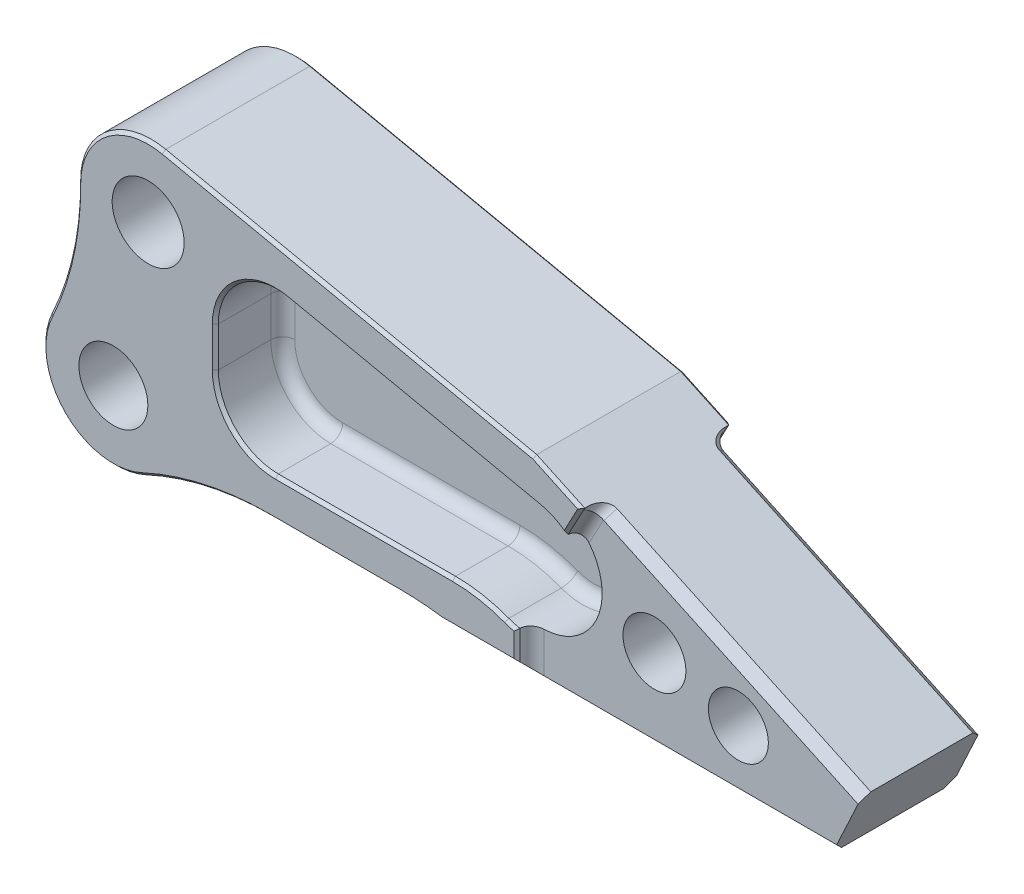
ISO-10303-21;
HEADER;
FILE_DESCRIPTION(('STEP AP214'),'2;1');
FILE_NAME('part.step','',(''),(''),'','','');
FILE_SCHEMA(('AUTOMOTIVE_DESIGN { 1 0 10303 214 1 1 1 1 }'));
ENDSEC;
DATA;
#1=APPLICATION_CONTEXT('core data for automotive mechanical design processes');
#2=APPLICATION_PROTOCOL_DEFINITION('international standard','automotive_design',2000,#1);
#3=PRODUCT_CONTEXT('',#1,'mechanical');
#4=PRODUCT('Part','Part','',(#3));
#5=PRODUCT_RELATED_PRODUCT_CATEGORY('part','',(#4));
#6=PRODUCT_DEFINITION_FORMATION('','',#4);
#7=PRODUCT_DEFINITION_CONTEXT('part definition',#1,'design');
#8=PRODUCT_DEFINITION('design','',#6,#7);
#9=PRODUCT_DEFINITION_SHAPE('','',#8);
#10=(LENGTH_UNIT() NAMED_UNIT(*) SI_UNIT(.MILLI.,.METRE.));
#11=(NAMED_UNIT(*) PLANE_ANGLE_UNIT() SI_UNIT($,.RADIAN.));
#12=(NAMED_UNIT(*) SI_UNIT($,.STERADIAN.) SOLID_ANGLE_UNIT());
#13=UNCERTAINTY_MEASURE_WITH_UNIT(LENGTH_MEASURE(1.E-05),#10,'distance_accuracy_value','');
#14=(GEOMETRIC_REPRESENTATION_CONTEXT(3) GLOBAL_UNCERTAINTY_ASSIGNED_CONTEXT((#13)) GLOBAL_UNIT_ASSIGNED_CONTEXT((#10,
#11,#12)) REPRESENTATION_CONTEXT('',''));
#15=CARTESIAN_POINT('',(0.,0.,0.));
#16=DIRECTION('',(0.,0.,1.));
#17=DIRECTION('',(1.,0.,0.));
#18=AXIS2_PLACEMENT_3D('',#15,#16,#17);
#19=CARTESIAN_POINT('',(52.0408493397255,-112.,25.));
#20=DIRECTION('',(0.,0.,-1.));
#21=DIRECTION('',(-1.,0.,0.));
#22=AXIS2_PLACEMENT_3D('',#19,#20,#21);
#23=CYLINDRICAL_SURFACE('',#22,100.);
#24=DIRECTION('',(0.,0.,-1.));
#25=VECTOR('',#24,1.);
#26=CARTESIAN_POINT('',(9.90250979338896,-21.3117408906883,25.));
#27=LINE('',#26,#25);
#28=CARTESIAN_POINT('',(9.90250979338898,-21.3117408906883,-7.5));
#29=VERTEX_POINT('',#28);
#30=CARTESIAN_POINT('',(9.90250979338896,-21.3117408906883,-24.));
#31=VERTEX_POINT('',#30);
#32=EDGE_CURVE('E527',#29,#31,#27,.T.);
#33=ORIENTED_EDGE('',*,*,#32,.T.);
#34=CARTESIAN_POINT('',(52.0408493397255,-112.,-24.));
#35=DIRECTION('',(0.,0.,1.));
#36=DIRECTION('',(1.,0.,0.));
#37=AXIS2_PLACEMENT_3D('',#34,#35,#36);
#38=CIRCLE('',#37,100.);
#39=CARTESIAN_POINT('',(52.0408493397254,-12.,-24.));
#40=VERTEX_POINT('',#39);
#41=EDGE_CURVE('E1066',#31,#40,#38,.F.);
#42=ORIENTED_EDGE('',*,*,#41,.T.);
#43=DIRECTION('',(0.,0.,-1.));
#44=VECTOR('',#43,1.);
#45=CARTESIAN_POINT('',(52.0408493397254,-12.,25.));
#46=LINE('',#45,#44);
#47=CARTESIAN_POINT('',(52.0408493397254,-12.,24.));
#48=VERTEX_POINT('',#47);
#49=EDGE_CURVE('E554',#48,#40,#46,.T.);
#50=ORIENTED_EDGE('',*,*,#49,.F.);
#51=CARTESIAN_POINT('',(52.0408493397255,-112.,24.));
#52=DIRECTION('',(0.,0.,1.));
#53=DIRECTION('',(1.,0.,0.));
#54=AXIS2_PLACEMENT_3D('',#51,#52,#53);
#55=CIRCLE('',#54,100.);
#56=CARTESIAN_POINT('',(9.90250979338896,-21.3117408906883,24.));
#57=VERTEX_POINT('',#56);
#58=EDGE_CURVE('E1060',#48,#57,#55,.T.);
#59=ORIENTED_EDGE('',*,*,#58,.T.);
#60=CARTESIAN_POINT('',(9.90250979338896,-21.3117408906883,7.5));
#61=VERTEX_POINT('',#60);
#62=EDGE_CURVE('E535',#57,#61,#27,.T.);
#63=ORIENTED_EDGE('',*,*,#62,.T.);
#64=CARTESIAN_POINT('',(52.0408493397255,-112.,7.5));
#65=DIRECTION('',(0.,0.,-1.));
#66=DIRECTION('',(1.,0.,0.));
#67=AXIS2_PLACEMENT_3D('',#64,#65,#66);
#68=CIRCLE('',#67,100.);
#69=CARTESIAN_POINT('',(24.,-16.0119238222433,7.5));
#70=VERTEX_POINT('',#69);
#71=EDGE_CURVE('E518',#61,#70,#68,.T.);
#72=ORIENTED_EDGE('',*,*,#71,.T.);
#73=CARTESIAN_POINT('',(24.,-16.0119238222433,7.5));
#74=CARTESIAN_POINT('',(24.0578005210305,-15.9950383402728,7.49999829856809));
#75=CARTESIAN_POINT('',(24.115589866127,-15.9782134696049,7.49749281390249));
#76=CARTESIAN_POINT('',(24.230800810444,-15.9447825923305,7.48748064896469));
#77=CARTESIAN_POINT('',(24.2882223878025,-15.9281765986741,7.47997367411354));
#78=CARTESIAN_POINT('',(24.459366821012,-15.8788479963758,7.4499675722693));
#79=CARTESIAN_POINT('',(24.5720106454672,-15.8466027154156,7.41998325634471));
#80=CARTESIAN_POINT('',(24.7909880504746,-15.784314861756,7.34063299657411));
#81=CARTESIAN_POINT('',(24.8973151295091,-15.754274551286,7.29124746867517));
#82=CARTESIAN_POINT('',(25.1002836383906,-15.697263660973,7.17423939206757));
#83=CARTESIAN_POINT('',(25.1969306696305,-15.6702913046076,7.10662747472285));
#84=CARTESIAN_POINT('',(25.3754127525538,-15.6207340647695,6.95654993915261));
#85=CARTESIAN_POINT('',(25.4575273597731,-15.5980655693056,6.87444461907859));
#86=CARTESIAN_POINT('',(25.6067513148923,-15.5570403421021,6.69658556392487));
#87=CARTESIAN_POINT('',(25.6738589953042,-15.5386840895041,6.600830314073));
#88=CARTESIAN_POINT('',(25.7884959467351,-15.5074233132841,6.40219629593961));
#89=CARTESIAN_POINT('',(25.8366504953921,-15.4943442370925,6.29970517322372));
#90=CARTESIAN_POINT('',(25.9150436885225,-15.4730921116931,6.08766313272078));
#91=CARTESIAN_POINT('',(25.9453023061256,-15.4649135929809,5.9781202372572));
#92=CARTESIAN_POINT('',(25.9773605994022,-15.4562550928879,5.80633522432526));
#93=CARTESIAN_POINT('',(25.9858465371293,-15.4539649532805,5.74535507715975));
#94=CARTESIAN_POINT('',(25.9971634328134,-15.4509117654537,5.62292686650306));
#95=CARTESIAN_POINT('',(26.0000028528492,-15.4501464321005,5.56147964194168));
#96=CARTESIAN_POINT('',(26.,-15.4501467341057,5.5));
#97=B_SPLINE_CURVE_WITH_KNOTS('',3,(#73,#74,#75,#76,#77,#78,#79,#80,#81,#82,#83,#84,#85,#86,#87,
#88,#89,#90,#91,#92,#93,#94,#95,#96),.UNSPECIFIED.,.F.,.F.,(4,2,2,2,2,2,2,2,2,2,2,4),(0.,
0.180541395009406,0.361093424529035,0.722070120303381,1.08341213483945,1.4445438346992,
1.79771458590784,2.15092456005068,2.49124068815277,2.83117627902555,3.01575807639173,
3.20006304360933),.UNSPECIFIED.);
#98=CARTESIAN_POINT('',(26.,-15.4501467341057,5.5));
#99=VERTEX_POINT('',#98);
#100=EDGE_CURVE('E864',#70,#99,#97,.T.);
#101=ORIENTED_EDGE('',*,*,#100,.T.);
#102=DIRECTION('',(0.,0.,1.));
#103=VECTOR('',#102,1.);
#104=CARTESIAN_POINT('',(26.,-15.4501467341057,-7.5));
#105=LINE('',#104,#103);
#106=CARTESIAN_POINT('',(26.,-15.4501467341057,-5.5));
#107=VERTEX_POINT('',#106);
#108=EDGE_CURVE('E2456',#107,#99,#105,.T.);
#109=ORIENTED_EDGE('',*,*,#108,.F.);
#110=CARTESIAN_POINT('',(26.,-15.4501467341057,-5.5));
#111=CARTESIAN_POINT('',(26.0000006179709,-15.4501468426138,-5.55483106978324));
#112=CARTESIAN_POINT('',(25.9977436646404,-15.4507552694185,-5.60963539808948));
#113=CARTESIAN_POINT('',(25.9887463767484,-15.4531825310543,-5.71884161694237));
#114=CARTESIAN_POINT('',(25.9820065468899,-15.4550012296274,-5.77324355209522));
#115=CARTESIAN_POINT('',(25.9551553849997,-15.4622512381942,-5.93506512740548));
#116=CARTESIAN_POINT('',(25.9284120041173,-15.4694765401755,-6.04138396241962));
#117=CARTESIAN_POINT('',(25.8581333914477,-15.4885152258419,-6.2478305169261));
#118=CARTESIAN_POINT('',(25.8145953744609,-15.5003293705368,-6.34795720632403));
#119=CARTESIAN_POINT('',(25.7121564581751,-15.5282282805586,-6.53937464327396));
#120=CARTESIAN_POINT('',(25.6532543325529,-15.5443133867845,-6.63066468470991));
#121=CARTESIAN_POINT('',(25.5210130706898,-15.5805878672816,-6.80326810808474));
#122=CARTESIAN_POINT('',(25.4474826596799,-15.6008317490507,-6.88442323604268));
#123=CARTESIAN_POINT('',(25.2887541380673,-15.6447605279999,-7.033282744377));
#124=CARTESIAN_POINT('',(25.203553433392,-15.6684461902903,-7.10098412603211));
#125=CARTESIAN_POINT('',(25.0209616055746,-15.7194986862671,-7.22340238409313));
#126=CARTESIAN_POINT('',(24.9232610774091,-15.7469611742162,-7.27761729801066));
#127=CARTESIAN_POINT('',(24.7207920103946,-15.8042333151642,-7.36890014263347));
#128=CARTESIAN_POINT('',(24.6160236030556,-15.8340429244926,-7.40596839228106));
#129=CARTESIAN_POINT('',(24.4259221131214,-15.8884851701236,-7.45601830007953));
#130=CARTESIAN_POINT('',(24.3414036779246,-15.9128081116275,-7.47251059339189));
#131=CARTESIAN_POINT('',(24.1712509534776,-15.9620208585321,-7.4945015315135));
#132=CARTESIAN_POINT('',(24.0856185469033,-15.9869097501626,-7.5000167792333));
#133=CARTESIAN_POINT('',(24.,-16.0119238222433,-7.5));
#134=B_SPLINE_CURVE_WITH_KNOTS('',3,(#110,#111,#112,#113,#114,#115,#116,#117,#118,#119,#120,
#121,#122,#123,#124,#125,#126,#127,#128,#129,#130,#131,#132,#133),.UNSPECIFIED.,.F.,.F.,(4,2,2,
2,2,2,2,2,2,2,2,4),(0.,0.164390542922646,0.328762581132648,0.656667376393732,0.984626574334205,
1.31261195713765,1.64520713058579,1.97787635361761,2.32151883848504,2.6651549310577,
2.9329388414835,3.20031741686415),.UNSPECIFIED.);
#135=CARTESIAN_POINT('',(24.,-16.0119238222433,-7.5));
#136=VERTEX_POINT('',#135);
#137=EDGE_CURVE('E870',#107,#136,#134,.T.);
#138=ORIENTED_EDGE('',*,*,#137,.T.);
#139=CARTESIAN_POINT('',(52.0408493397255,-112.,-7.5));
#140=DIRECTION('',(0.,0.,-1.));
#141=DIRECTION('',(1.,0.,0.));
#142=AXIS2_PLACEMENT_3D('',#139,#140,#141);
#143=CIRCLE('',#142,100.);
#144=EDGE_CURVE('E528',#29,#136,#143,.T.);
#145=ORIENTED_EDGE('',*,*,#144,.F.);
#146=EDGE_LOOP('',(#33,#42,#50,#59,#63,#72,#101,#109,#138,#145));
#147=FACE_BOUND('',#146,.T.);
#148=ADVANCED_FACE('F36',(#147),#23,.F.);
#149=CARTESIAN_POINT('',(-111.897784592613,52.2602698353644,25.));
#150=DIRECTION('',(0.,0.,-1.));
#151=DIRECTION('',(-1.,0.,0.));
#152=AXIS2_PLACEMENT_3D('',#149,#150,#151);
#153=CYLINDRICAL_SURFACE('',#152,100.);
#154=DIRECTION('',(0.,0.,-1.));
#155=VECTOR('',#154,1.);
#156=CARTESIAN_POINT('',(-11.8995784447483,52.8592416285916,25.));
#157=LINE('',#156,#155);
#158=CARTESIAN_POINT('',(-11.8995784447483,52.8592416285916,24.));
#159=VERTEX_POINT('',#158);
#160=CARTESIAN_POINT('',(-11.8995784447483,52.8592416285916,-24.));
#161=VERTEX_POINT('',#160);
#162=EDGE_CURVE('E537',#159,#161,#157,.T.);
#163=ORIENTED_EDGE('',*,*,#162,.T.);
#164=CARTESIAN_POINT('',(-111.897784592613,52.2602698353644,-24.));
#165=DIRECTION('',(0.,0.,1.));
#166=DIRECTION('',(1.,0.,0.));
#167=AXIS2_PLACEMENT_3D('',#164,#165,#166);
#168=CIRCLE('',#167,100.);
#169=CARTESIAN_POINT('',(-21.2922909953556,9.94426187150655,-24.));
#170=VERTEX_POINT('',#169);
#171=EDGE_CURVE('E533',#161,#170,#168,.F.);
#172=ORIENTED_EDGE('',*,*,#171,.T.);
#173=DIRECTION('',(0.,0.,-1.));
#174=VECTOR('',#173,1.);
#175=CARTESIAN_POINT('',(-21.2922909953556,9.94426187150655,25.));
#176=LINE('',#175,#174);
#177=CARTESIAN_POINT('',(-21.2922909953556,9.94426187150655,-7.5));
#178=VERTEX_POINT('',#177);
#179=EDGE_CURVE('E524',#178,#170,#176,.T.);
#180=ORIENTED_EDGE('',*,*,#179,.F.);
#181=CARTESIAN_POINT('',(-111.897784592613,52.2602698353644,-7.5));
#182=DIRECTION('',(0.,0.,-1.));
#183=DIRECTION('',(1.,0.,0.));
#184=AXIS2_PLACEMENT_3D('',#181,#182,#183);
#185=CIRCLE('',#184,100.);
#186=CARTESIAN_POINT('',(-15.5579655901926,25.4528217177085,-7.5));
#187=VERTEX_POINT('',#186);
#188=EDGE_CURVE('E507',#187,#178,#185,.T.);
#189=ORIENTED_EDGE('',*,*,#188,.F.);
#190=CARTESIAN_POINT('',(-15.5579655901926,25.4528217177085,-7.5));
#191=CARTESIAN_POINT('',(-15.5424667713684,25.5085198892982,-7.49999910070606));
#192=CARTESIAN_POINT('',(-15.5270241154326,25.5642055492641,-7.49757565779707));
#193=CARTESIAN_POINT('',(-15.4963426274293,25.675212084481,-7.48789934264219));
#194=CARTESIAN_POINT('',(-15.4811037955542,25.7305329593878,-7.48064646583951));
#195=CARTESIAN_POINT('',(-15.4358640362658,25.8953158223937,-7.45168875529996));
#196=CARTESIAN_POINT('',(-15.4063048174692,26.0037239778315,-7.4227847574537));
#197=CARTESIAN_POINT('',(-15.3492174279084,26.214423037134,-7.34647128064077));
#198=CARTESIAN_POINT('',(-15.3216907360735,26.3167094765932,-7.29904848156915));
#199=CARTESIAN_POINT('',(-15.2694128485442,26.5121048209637,-7.18694457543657));
#200=CARTESIAN_POINT('',(-15.2446606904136,26.6052169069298,-7.12226947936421));
#201=CARTESIAN_POINT('',(-15.1987880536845,26.7786674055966,-6.9780762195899));
#202=CARTESIAN_POINT('',(-15.1776366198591,26.8591141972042,-6.8986982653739));
#203=CARTESIAN_POINT('',(-15.1392309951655,27.0058034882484,-6.72689699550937));
#204=CARTESIAN_POINT('',(-15.1219774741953,27.0720435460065,-6.6344714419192));
#205=CARTESIAN_POINT('',(-15.0920333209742,27.1873754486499,-6.4406658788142));
#206=CARTESIAN_POINT('',(-15.0792804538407,27.2367008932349,-6.33943428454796));
#207=CARTESIAN_POINT('',(-15.0583164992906,27.3179525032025,-6.12981202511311));
#208=CARTESIAN_POINT('',(-15.050101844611,27.3498923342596,-6.02142705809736));
#209=CARTESIAN_POINT('',(-15.0406735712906,27.3865840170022,-5.84353047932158));
#210=CARTESIAN_POINT('',(-15.0379805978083,27.397074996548,-5.77522551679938));
#211=CARTESIAN_POINT('',(-15.0343898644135,27.4110690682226,-5.63795748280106));
#212=CARTESIAN_POINT('',(-15.0334894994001,27.4145823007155,-5.56899551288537));
#213=CARTESIAN_POINT('',(-15.0334904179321,27.4145757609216,-5.5));
#214=B_SPLINE_CURVE_WITH_KNOTS('',3,(#190,#191,#192,#193,#194,#195,#196,#197,#198,#199,#200,
#201,#202,#203,#204,#205,#206,#207,#208,#209,#210,#211,#212,#213),.UNSPECIFIED.,.F.,.F.,(4,2,2,
2,2,2,2,2,2,2,2,4),(0.,0.173338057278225,0.346676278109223,0.692965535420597,1.03950432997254,
1.38592254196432,1.72919306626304,2.0725225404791,2.41089903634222,2.74900917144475,
2.95613614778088,3.16296189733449),.UNSPECIFIED.);
#215=CARTESIAN_POINT('',(-15.0334904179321,27.4145757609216,-5.5));
#216=VERTEX_POINT('',#215);
#217=EDGE_CURVE('E2350',#187,#216,#214,.T.);
#218=ORIENTED_EDGE('',*,*,#217,.T.);
#219=DIRECTION('',(0.,0.,1.));
#220=VECTOR('',#219,1.);
#221=CARTESIAN_POINT('',(-15.0334904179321,27.4145757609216,-7.5));
#222=LINE('',#221,#220);
#223=CARTESIAN_POINT('',(-15.0334904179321,27.4145757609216,5.5));
#224=VERTEX_POINT('',#223);
#225=EDGE_CURVE('E837',#216,#224,#222,.T.);
#226=ORIENTED_EDGE('',*,*,#225,.T.);
#227=CARTESIAN_POINT('',(-15.0334904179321,27.4145757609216,5.5));
#228=CARTESIAN_POINT('',(-15.0334906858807,27.4145758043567,5.55570238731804));
#229=CARTESIAN_POINT('',(-15.0340767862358,27.4122896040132,5.61137791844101));
#230=CARTESIAN_POINT('',(-15.0364160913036,27.403171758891,5.72232678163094));
#231=CARTESIAN_POINT('',(-15.0381692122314,27.396340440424,5.77760014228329));
#232=CARTESIAN_POINT('',(-15.0451630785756,27.369105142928,5.94208727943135));
#233=CARTESIAN_POINT('',(-15.0521383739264,27.3419595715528,6.05019309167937));
#234=CARTESIAN_POINT('',(-15.0705511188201,27.2705078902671,6.26015178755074));
#235=CARTESIAN_POINT('',(-15.0819901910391,27.2261955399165,6.36200238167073));
#236=CARTESIAN_POINT('',(-15.1090555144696,27.1217571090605,6.55663481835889));
#237=CARTESIAN_POINT('',(-15.1246814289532,27.0616323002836,6.64941738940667));
#238=CARTESIAN_POINT('',(-15.1598389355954,26.9269968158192,6.82384942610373));
#239=CARTESIAN_POINT('',(-15.1793911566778,26.8524102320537,6.90543608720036));
#240=CARTESIAN_POINT('',(-15.2218742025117,26.6912400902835,7.05472003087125));
#241=CARTESIAN_POINT('',(-15.2448057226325,26.6046540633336,7.12241444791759));
#242=CARTESIAN_POINT('',(-15.293795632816,26.4207947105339,7.24292566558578));
#243=CARTESIAN_POINT('',(-15.3198907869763,26.3233971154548,7.29553768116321));
#244=CARTESIAN_POINT('',(-15.3743013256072,26.1216380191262,7.38334621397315));
#245=CARTESIAN_POINT('',(-15.4026159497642,26.0172789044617,7.41854866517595));
#246=CARTESIAN_POINT('',(-15.4521725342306,25.8358497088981,7.46303272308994));
#247=CARTESIAN_POINT('',(-15.4730491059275,25.7597676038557,7.47689084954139));
#248=CARTESIAN_POINT('',(-15.5152383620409,25.60673067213,7.49537392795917));
#249=CARTESIAN_POINT('',(-15.5365503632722,25.5297772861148,7.50001236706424));
#250=CARTESIAN_POINT('',(-15.5579655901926,25.4528217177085,7.5));
#251=B_SPLINE_CURVE_WITH_KNOTS('',3,(#227,#228,#229,#230,#231,#232,#233,#234,#235,#236,#237,
#238,#239,#240,#241,#242,#243,#244,#245,#246,#247,#248,#249,#250),.UNSPECIFIED.,.F.,.F.,(4,2,2,
2,2,2,2,2,2,2,2,4),(0.,0.167003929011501,0.333995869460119,0.667313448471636,1.00075230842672,
1.33416435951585,1.66937629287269,2.00465730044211,2.34429566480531,2.68381818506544,
2.92361515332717,3.16306107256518),.UNSPECIFIED.);
#252=CARTESIAN_POINT('',(-15.5579655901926,25.4528217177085,7.5));
#253=VERTEX_POINT('',#252);
#254=EDGE_CURVE('E2345',#224,#253,#251,.T.);
#255=ORIENTED_EDGE('',*,*,#254,.T.);
#256=CARTESIAN_POINT('',(-111.897784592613,52.2602698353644,7.5));
#257=DIRECTION('',(0.,0.,-1.));
#258=DIRECTION('',(1.,0.,0.));
#259=AXIS2_PLACEMENT_3D('',#256,#257,#258);
#260=CIRCLE('',#259,100.);
#261=CARTESIAN_POINT('',(-21.2922909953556,9.94426187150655,7.5));
#262=VERTEX_POINT('',#261);
#263=EDGE_CURVE('E2364',#253,#262,#260,.T.);
#264=ORIENTED_EDGE('',*,*,#263,.T.);
#265=CARTESIAN_POINT('',(-21.2922909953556,9.94426187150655,24.));
#266=VERTEX_POINT('',#265);
#267=EDGE_CURVE('E534',#266,#262,#176,.T.);
#268=ORIENTED_EDGE('',*,*,#267,.F.);
#269=CARTESIAN_POINT('',(-111.897784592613,52.2602698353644,24.));
#270=DIRECTION('',(0.,0.,1.));
#271=DIRECTION('',(1.,0.,0.));
#272=AXIS2_PLACEMENT_3D('',#269,#270,#271);
#273=CIRCLE('',#272,100.);
#274=EDGE_CURVE('E1191',#266,#159,#273,.T.);
#275=ORIENTED_EDGE('',*,*,#274,.T.);
#276=EDGE_LOOP('',(#163,#172,#180,#189,#218,#226,#255,#264,#268,#275));
#277=FACE_BOUND('',#276,.T.);
#278=ADVANCED_FACE('F531',(#277),#153,.F.);
#279=CARTESIAN_POINT('',(0.,0.,25.));
#280=DIRECTION('',(0.,0.,-1.));
#281=DIRECTION('',(-1.,0.,0.));
#282=AXIS2_PLACEMENT_3D('',#279,#280,#281);
#283=CYLINDRICAL_SURFACE('',#282,23.5);
#284=ORIENTED_EDGE('',*,*,#179,.T.);
#285=CARTESIAN_POINT('',(0.,0.,-24.));
#286=DIRECTION('',(0.,0.,1.));
#287=DIRECTION('',(1.,0.,0.));
#288=AXIS2_PLACEMENT_3D('',#285,#286,#287);
#289=CIRCLE('',#288,23.5);
#290=EDGE_CURVE('E1057',#170,#31,#289,.T.);
#291=ORIENTED_EDGE('',*,*,#290,.T.);
#292=ORIENTED_EDGE('',*,*,#32,.F.);
#293=CARTESIAN_POINT('',(0.,0.,-7.5));
#294=DIRECTION('',(0.,0.,1.));
#295=DIRECTION('',(1.,0.,0.));
#296=AXIS2_PLACEMENT_3D('',#293,#294,#295);
#297=CIRCLE('',#296,23.5);
#298=EDGE_CURVE('E511',#178,#29,#297,.T.);
#299=ORIENTED_EDGE('',*,*,#298,.F.);
#300=EDGE_LOOP('',(#284,#291,#292,#299));
#301=FACE_BOUND('',#300,.T.);
#302=ADVANCED_FACE('F523',(#301),#283,.T.);
#303=CARTESIAN_POINT('',(0.,0.,25.));
#304=DIRECTION('',(0.,0.,-1.));
#305=DIRECTION('',(-1.,0.,0.));
#306=AXIS2_PLACEMENT_3D('',#303,#304,#305);
#307=CYLINDRICAL_SURFACE('',#306,11.5);
#308=CARTESIAN_POINT('',(0.,0.,-25.));
#309=DIRECTION('',(0.,0.,1.));
#310=DIRECTION('',(1.,0.,0.));
#311=AXIS2_PLACEMENT_3D('',#308,#309,#310);
#312=CIRCLE('',#311,11.5);
#313=CARTESIAN_POINT('',(11.5,0.,-25.));
#314=VERTEX_POINT('',#313);
#315=EDGE_CURVE('E1364',#314,#314,#312,.T.);
#316=ORIENTED_EDGE('',*,*,#315,.F.);
#317=EDGE_LOOP('',(#316));
#318=FACE_BOUND('',#317,.T.);
#319=CARTESIAN_POINT('',(0.,0.,-7.5));
#320=DIRECTION('',(0.,0.,1.));
#321=DIRECTION('',(1.,0.,0.));
#322=AXIS2_PLACEMENT_3D('',#319,#320,#321);
#323=CIRCLE('',#322,11.5);
#324=CARTESIAN_POINT('',(11.5,0.,-7.5));
#325=VERTEX_POINT('',#324);
#326=EDGE_CURVE('E833',#325,#325,#323,.T.);
#327=ORIENTED_EDGE('',*,*,#326,.T.);
#328=EDGE_LOOP('',(#327));
#329=FACE_BOUND('',#328,.T.);
#330=ADVANCED_FACE('F1372',(#318,#329),#307,.F.);
#331=CARTESIAN_POINT('',(104.287046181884,-55.4504060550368,25.));
#332=DIRECTION('',(-0.882947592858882,0.469471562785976,0.));
#333=DIRECTION('',(-0.469471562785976,-0.882947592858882,0.));
#334=AXIS2_PLACEMENT_3D('',#331,#332,#333);
#335=PLANE('',#334);
#336=DIRECTION('',(0.,0.,-1.));
#337=VECTOR('',#336,1.);
#338=CARTESIAN_POINT('',(156.220171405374,42.2215969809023,25.));
#339=LINE('',#338,#337);
#340=CARTESIAN_POINT('',(156.220171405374,42.2215969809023,24.));
#341=VERTEX_POINT('',#340);
#342=CARTESIAN_POINT('',(156.220171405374,42.2215969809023,22.8661980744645));
#343=VERTEX_POINT('',#342);
#344=EDGE_CURVE('E549',#341,#343,#339,.T.);
#345=ORIENTED_EDGE('',*,*,#344,.F.);
#346=DIRECTION('',(-0.469471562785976,-0.882947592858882,0.));
#347=VECTOR('',#346,1.);
#348=CARTESIAN_POINT('',(150.711538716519,31.8613656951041,24.));
#349=LINE('',#348,#347);
#350=CARTESIAN_POINT('',(155.687153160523,41.2191354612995,24.));
#351=VERTEX_POINT('',#350);
#352=EDGE_CURVE('E1070',#341,#351,#349,.T.);
#353=ORIENTED_EDGE('',*,*,#352,.T.);
#354=DIRECTION('',(-0.332194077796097,-0.624766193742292,0.706621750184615));
#355=VECTOR('',#354,1.);
#356=CARTESIAN_POINT('',(129.717118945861,-7.62339519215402,79.2417765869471));
#357=LINE('',#356,#355);
#358=EDGE_CURVE('E694',#351,#343,#357,.F.);
#359=ORIENTED_EDGE('',*,*,#358,.T.);
#360=EDGE_LOOP('',(#345,#353,#359));
#361=FACE_BOUND('',#360,.T.);
#362=ADVANCED_FACE('F1375',(#361),#335,.F.);
#363=CARTESIAN_POINT('',(0.,0.,25.));
#364=DIRECTION('',(0.,0.,1.));
#365=DIRECTION('',(1.,0.,0.));
#366=AXIS2_PLACEMENT_3D('',#363,#364,#365);
#367=PLANE('',#366);
#368=CARTESIAN_POINT('',(0.,0.,25.));
#369=DIRECTION('',(0.,0.,1.));
#370=DIRECTION('',(1.,0.,0.));
#371=AXIS2_PLACEMENT_3D('',#368,#369,#370);
#372=CIRCLE('',#371,11.5);
#373=CARTESIAN_POINT('',(11.5,0.,25.));
#374=VERTEX_POINT('',#373);
#375=EDGE_CURVE('E1363',#374,#374,#372,.T.);
#376=ORIENTED_EDGE('',*,*,#375,.F.);
#377=EDGE_LOOP('',(#376));
#378=FACE_BOUND('',#377,.T.);
#379=CARTESIAN_POINT('',(11.6,53.,25.));
#380=DIRECTION('',(0.,0.,1.));
#381=DIRECTION('',(1.,0.,0.));
#382=AXIS2_PLACEMENT_3D('',#379,#380,#381);
#383=CIRCLE('',#382,12.);
#384=CARTESIAN_POINT('',(23.6,53.,25.));
#385=VERTEX_POINT('',#384);
#386=EDGE_CURVE('E1360',#385,#385,#383,.T.);
#387=ORIENTED_EDGE('',*,*,#386,.F.);
#388=EDGE_LOOP('',(#387));
#389=FACE_BOUND('',#388,.T.);
#390=DIRECTION('',(1.,0.,0.));
#391=VECTOR('',#390,1.);
#392=CARTESIAN_POINT('',(0.,-10.9999999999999,25.));
#393=LINE('',#392,#391);
#394=CARTESIAN_POINT('',(52.0408493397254,-11.,25.));
#395=VERTEX_POINT('',#394);
#396=CARTESIAN_POINT('',(95.4283355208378,-11.0000000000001,25.));
#397=VERTEX_POINT('',#396);
#398=EDGE_CURVE('E1528',#395,#397,#393,.T.);
#399=ORIENTED_EDGE('',*,*,#398,.T.);
#400=CARTESIAN_POINT('',(95.4283355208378,-112.,25.));
#401=DIRECTION('',(0.,0.,1.));
#402=DIRECTION('',(1.,0.,0.));
#403=AXIS2_PLACEMENT_3D('',#400,#401,#402);
#404=CIRCLE('',#403,101.);
#405=CARTESIAN_POINT('',(109.605782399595,-12.,25.));
#406=VERTEX_POINT('',#405);
#407=EDGE_CURVE('E1208',#397,#406,#404,.F.);
#408=ORIENTED_EDGE('',*,*,#407,.T.);
#409=DIRECTION('',(-1.,0.,0.));
#410=VECTOR('',#409,1.);
#411=CARTESIAN_POINT('',(0.,-12.,25.));
#412=LINE('',#411,#410);
#413=CARTESIAN_POINT('',(133.620171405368,-12.,25.));
#414=VERTEX_POINT('',#413);
#415=EDGE_CURVE('E598',#406,#414,#412,.F.);
#416=ORIENTED_EDGE('',*,*,#415,.T.);
#417=DIRECTION('',(0.,1.,0.));
#418=VECTOR('',#417,1.);
#419=CARTESIAN_POINT('',(133.620171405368,-3.29173545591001,25.));
#420=LINE('',#419,#418);
#421=CARTESIAN_POINT('',(133.620171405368,-4.11757146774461,25.));
#422=VERTEX_POINT('',#421);
#423=EDGE_CURVE('E1513',#414,#422,#420,.T.);
#424=ORIENTED_EDGE('',*,*,#423,.T.);
#425=CARTESIAN_POINT('',(138.,16.4206149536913,25.));
#426=DIRECTION('',(0.,0.,1.));
#427=DIRECTION('',(1.,0.,0.));
#428=AXIS2_PLACEMENT_3D('',#425,#426,#427);
#429=CIRCLE('',#428,21.0000000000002);
#430=CARTESIAN_POINT('',(130.529198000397,-3.20556953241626,25.));
#431=VERTEX_POINT('',#430);
#432=EDGE_CURVE('E1509',#422,#431,#429,.F.);
#433=ORIENTED_EDGE('',*,*,#432,.T.);
#434=CARTESIAN_POINT('',(113.097326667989,-49.,25.));
#435=DIRECTION('',(0.,0.,1.));
#436=DIRECTION('',(1.,0.,0.));
#437=AXIS2_PLACEMENT_3D('',#434,#435,#436);
#438=CIRCLE('',#437,48.9999999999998);
#439=CARTESIAN_POINT('',(113.097326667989,-2.3115190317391E-13,25.));
#440=VERTEX_POINT('',#439);
#441=EDGE_CURVE('E1503',#431,#440,#438,.T.);
#442=ORIENTED_EDGE('',*,*,#441,.T.);
#443=DIRECTION('',(-1.,0.,0.));
#444=VECTOR('',#443,1.);
#445=CARTESIAN_POINT('',(0.,-2.37791546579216E-13,25.));
#446=LINE('',#445,#444);
#447=CARTESIAN_POINT('',(54.,-2.34621350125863E-13,25.));
#448=VERTEX_POINT('',#447);
#449=EDGE_CURVE('E1500',#440,#448,#446,.T.);
#450=ORIENTED_EDGE('',*,*,#449,.T.);
#451=CARTESIAN_POINT('',(54.,21.,25.));
#452=DIRECTION('',(0.,0.,1.));
#453=DIRECTION('',(1.,0.,0.));
#454=AXIS2_PLACEMENT_3D('',#451,#452,#453);
#455=CIRCLE('',#454,21.0000000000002);
#456=CARTESIAN_POINT('',(32.9999999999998,21.,25.));
#457=VERTEX_POINT('',#456);
#458=EDGE_CURVE('E1501',#448,#457,#455,.F.);
#459=ORIENTED_EDGE('',*,*,#458,.T.);
#460=DIRECTION('',(0.,1.,0.));
#461=VECTOR('',#460,1.);
#462=CARTESIAN_POINT('',(32.9999999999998,0.,25.));
#463=LINE('',#462,#461);
#464=CARTESIAN_POINT('',(32.9999999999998,34.2753661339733,25.));
#465=VERTEX_POINT('',#464);
#466=EDGE_CURVE('E2369',#457,#465,#463,.T.);
#467=ORIENTED_EDGE('',*,*,#466,.T.);
#468=CARTESIAN_POINT('',(54.,34.2753661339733,25.));
#469=DIRECTION('',(0.,0.,1.));
#470=DIRECTION('',(1.,0.,0.));
#471=AXIS2_PLACEMENT_3D('',#468,#469,#470);
#472=CIRCLE('',#471,21.0000000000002);
#473=CARTESIAN_POINT('',(58.366145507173,54.8164657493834,25.));
#474=VERTEX_POINT('',#473);
#475=EDGE_CURVE('E1436',#465,#474,#472,.F.);
#476=ORIENTED_EDGE('',*,*,#475,.T.);
#477=DIRECTION('',(0.978147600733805,-0.20791169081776,0.));
#478=VECTOR('',#477,1.);
#479=CARTESIAN_POINT('',(13.670941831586,64.3167245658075,25.));
#480=LINE('',#479,#478);
#481=CARTESIAN_POINT('',(142.366145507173,36.9617145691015,25.));
#482=VERTEX_POINT('',#481);
#483=EDGE_CURVE('E1430',#474,#482,#480,.T.);
#484=ORIENTED_EDGE('',*,*,#483,.T.);
#485=CARTESIAN_POINT('',(138.,16.4206149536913,25.));
#486=DIRECTION('',(0.,0.,1.));
#487=DIRECTION('',(1.,0.,0.));
#488=AXIS2_PLACEMENT_3D('',#485,#486,#487);
#489=CIRCLE('',#488,21.0000000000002);
#490=CARTESIAN_POINT('',(150.385936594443,33.3790516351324,25.));
#491=VERTEX_POINT('',#490);
#492=EDGE_CURVE('E1497',#482,#491,#489,.F.);
#493=ORIENTED_EDGE('',*,*,#492,.T.);
#494=DIRECTION('',(0.469471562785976,0.882947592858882,0.));
#495=VECTOR('',#494,1.);
#496=CARTESIAN_POINT('',(155.337223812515,42.6910685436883,25.));
#497=LINE('',#496,#495);
#498=CARTESIAN_POINT('',(154.842504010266,41.7606359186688,25.));
#499=VERTEX_POINT('',#498);
#500=EDGE_CURVE('E1511',#491,#499,#497,.T.);
#501=ORIENTED_EDGE('',*,*,#500,.T.);
#502=DIRECTION('',(-0.906307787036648,0.422618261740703,0.));
#503=VECTOR('',#502,1.);
#504=CARTESIAN_POINT('',(43.6510820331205,93.6100475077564,25.));
#505=LINE('',#504,#503);
#506=CARTESIAN_POINT('',(139.887323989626,48.73435089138,25.));
#507=VERTEX_POINT('',#506);
#508=EDGE_CURVE('E1516',#499,#507,#505,.T.);
#509=ORIENTED_EDGE('',*,*,#508,.T.);
#510=DIRECTION('',(-0.978147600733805,0.20791169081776,0.));
#511=VECTOR('',#510,1.);
#512=CARTESIAN_POINT('',(15.9579704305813,75.0763481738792,25.));
#513=LINE('',#512,#511);
#514=CARTESIAN_POINT('',(16.2780130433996,75.0083210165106,25.));
#515=VERTEX_POINT('',#514);
#516=EDGE_CURVE('E1518',#507,#515,#513,.T.);
#517=ORIENTED_EDGE('',*,*,#516,.T.);
#518=CARTESIAN_POINT('',(11.6,53.,25.));
#519=DIRECTION('',(0.,0.,1.));
#520=DIRECTION('',(1.,0.,0.));
#521=AXIS2_PLACEMENT_3D('',#518,#519,#520);
#522=CIRCLE('',#521,22.5);
#523=CARTESIAN_POINT('',(-10.8995963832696,52.8652313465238,25.));
#524=VERTEX_POINT('',#523);
#525=EDGE_CURVE('E1520',#515,#524,#522,.T.);
#526=ORIENTED_EDGE('',*,*,#525,.T.);
#527=CARTESIAN_POINT('',(-111.897784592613,52.2602698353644,25.));
#528=DIRECTION('',(0.,0.,1.));
#529=DIRECTION('',(1.,0.,0.));
#530=AXIS2_PLACEMENT_3D('',#527,#528,#529);
#531=CIRCLE('',#530,101.);
#532=CARTESIAN_POINT('',(-20.386236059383,9.52110179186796,25.));
#533=VERTEX_POINT('',#532);
#534=EDGE_CURVE('E1522',#524,#533,#531,.F.);
#535=ORIENTED_EDGE('',*,*,#534,.T.);
#536=CARTESIAN_POINT('',(0.,0.,25.));
#537=DIRECTION('',(0.,0.,1.));
#538=DIRECTION('',(1.,0.,0.));
#539=AXIS2_PLACEMENT_3D('',#536,#537,#538);
#540=CIRCLE('',#539,22.5);
#541=CARTESIAN_POINT('',(9.48112639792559,-20.4048582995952,25.));
#542=VERTEX_POINT('',#541);
#543=EDGE_CURVE('E1524',#533,#542,#540,.T.);
#544=ORIENTED_EDGE('',*,*,#543,.T.);
#545=CARTESIAN_POINT('',(52.0408493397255,-112.,25.));
#546=DIRECTION('',(0.,0.,1.));
#547=DIRECTION('',(1.,0.,0.));
#548=AXIS2_PLACEMENT_3D('',#545,#546,#547);
#549=CIRCLE('',#548,101.);
#550=EDGE_CURVE('E1526',#542,#395,#549,.F.);
#551=ORIENTED_EDGE('',*,*,#550,.T.);
#552=EDGE_LOOP('',(#399,#408,#416,#424,#433,#442,#450,#459,#467,#476,#484,#493,#501,#509,#517,
#526,#535,#544,#551));
#553=FACE_BOUND('',#552,.T.);
#554=ADVANCED_FACE('F2015',(#378,#389,#553),#367,.T.);
#555=CARTESIAN_POINT('',(0.,0.,20.));
#556=DIRECTION('',(0.,0.,1.));
#557=DIRECTION('',(1.,0.,0.));
#558=AXIS2_PLACEMENT_3D('',#555,#556,#557);
#559=PLANE('',#558);
#560=CARTESIAN_POINT('',(203.438268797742,1.00000000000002,20.));
#561=DIRECTION('',(0.,0.,1.));
#562=DIRECTION('',(1.,0.,0.));
#563=AXIS2_PLACEMENT_3D('',#560,#561,#562);
#564=CIRCLE('',#563,10.);
#565=CARTESIAN_POINT('',(213.438268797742,1.00000000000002,20.));
#566=VERTEX_POINT('',#565);
#567=EDGE_CURVE('E572',#566,#566,#564,.T.);
#568=ORIENTED_EDGE('',*,*,#567,.F.);
#569=EDGE_LOOP('',(#568));
#570=FACE_BOUND('',#569,.T.);
#571=CARTESIAN_POINT('',(175.438268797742,8.00000000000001,20.));
#572=DIRECTION('',(0.,0.,1.));
#573=DIRECTION('',(1.,0.,0.));
#574=AXIS2_PLACEMENT_3D('',#571,#572,#573);
#575=CIRCLE('',#574,10.5);
#576=CARTESIAN_POINT('',(185.938268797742,8.00000000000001,20.));
#577=VERTEX_POINT('',#576);
#578=EDGE_CURVE('E568',#577,#577,#575,.T.);
#579=ORIENTED_EDGE('',*,*,#578,.F.);
#580=EDGE_LOOP('',(#579));
#581=FACE_BOUND('',#580,.T.);
#582=CARTESIAN_POINT('',(138.,16.4206149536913,20.));
#583=DIRECTION('',(0.,0.,1.));
#584=DIRECTION('',(1.,0.,0.));
#585=AXIS2_PLACEMENT_3D('',#582,#583,#584);
#586=CIRCLE('',#585,20.);
#587=CARTESIAN_POINT('',(153.651924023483,28.8712082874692,20.));
#588=VERTEX_POINT('',#587);
#589=CARTESIAN_POINT('',(138.620171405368,-3.56976741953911,20.));
#590=VERTEX_POINT('',#589);
#591=EDGE_CURVE('E560',#588,#590,#586,.F.);
#592=ORIENTED_EDGE('',*,*,#591,.T.);
#593=DIRECTION('',(0.,1.,0.));
#594=VECTOR('',#593,1.);
#595=CARTESIAN_POINT('',(138.620171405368,0.,20.));
#596=LINE('',#595,#594);
#597=CARTESIAN_POINT('',(138.620171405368,-17.,20.));
#598=VERTEX_POINT('',#597);
#599=EDGE_CURVE('E712',#590,#598,#596,.F.);
#600=ORIENTED_EDGE('',*,*,#599,.T.);
#601=DIRECTION('',(1.,0.,0.));
#602=VECTOR('',#601,1.);
#603=CARTESIAN_POINT('',(0.,-17.0000000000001,20.));
#604=LINE('',#603,#602);
#605=CARTESIAN_POINT('',(236.226633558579,-17.,20.));
#606=VERTEX_POINT('',#605);
#607=EDGE_CURVE('E604',#598,#606,#604,.T.);
#608=ORIENTED_EDGE('',*,*,#607,.T.);
#609=DIRECTION('',(0.422618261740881,0.906307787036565,0.));
#610=VECTOR('',#609,1.);
#611=CARTESIAN_POINT('',(200.546471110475,-93.5163552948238,20.));
#612=LINE('',#611,#610);
#613=CARTESIAN_POINT('',(243.352316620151,-1.71892336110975,20.));
#614=VERTEX_POINT('',#613);
#615=EDGE_CURVE('E1346',#606,#614,#612,.T.);
#616=ORIENTED_EDGE('',*,*,#615,.T.);
#617=DIRECTION('',(-0.906307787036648,0.422618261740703,0.));
#618=VECTOR('',#617,1.);
#619=CARTESIAN_POINT('',(42.8058455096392,91.7974319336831,20.));
#620=LINE('',#619,#618);
#621=CARTESIAN_POINT('',(158.574373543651,37.8136807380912,20.));
#622=VERTEX_POINT('',#621);
#623=EDGE_CURVE('E601',#614,#622,#620,.T.);
#624=ORIENTED_EDGE('',*,*,#623,.T.);
#625=CARTESIAN_POINT('',(161.099406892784,42.8778864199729,20.));
#626=DIRECTION('',(0.,0.,1.));
#627=DIRECTION('',(-0.469471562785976,-0.882947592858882,0.));
#628=AXIS2_PLACEMENT_3D('',#625,#626,#627);
#629=ELLIPSE('',#628,5.6607371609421,4.);
#630=CARTESIAN_POINT('',(158.441851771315,37.8797521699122,20.));
#631=VERTEX_POINT('',#630);
#632=EDGE_CURVE('E720',#622,#631,#629,.F.);
#633=ORIENTED_EDGE('',*,*,#632,.T.);
#634=DIRECTION('',(0.469471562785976,0.882947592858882,0.));
#635=VECTOR('',#634,1.);
#636=CARTESIAN_POINT('',(107.818836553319,-57.3282923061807,20.));
#637=LINE('',#636,#635);
#638=EDGE_CURVE('E710',#631,#588,#637,.F.);
#639=ORIENTED_EDGE('',*,*,#638,.T.);
#640=EDGE_LOOP('',(#592,#600,#608,#616,#624,#633,#639));
#641=FACE_BOUND('',#640,.T.);
#642=ADVANCED_FACE('F2009',(#570,#581,#641),#559,.T.);
#643=DIRECTION('',(-0.332194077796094,-0.624766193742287,-0.706621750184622));
#644=VECTOR('',#643,1.);
#645=CARTESIAN_POINT('',(141.453896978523,14.4502738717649,-54.2760616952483));
#646=LINE('',#645,#644);
#647=CARTESIAN_POINT('',(156.220171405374,42.2215969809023,-22.8661980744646));
#648=VERTEX_POINT('',#647);
#649=CARTESIAN_POINT('',(155.687153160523,41.2191354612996,-24.));
#650=VERTEX_POINT('',#649);
#651=EDGE_CURVE('E686',#648,#650,#646,.T.);
#652=ORIENTED_EDGE('',*,*,#651,.T.);
#653=DIRECTION('',(0.469471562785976,0.882947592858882,0.));
#654=VECTOR('',#653,1.);
#655=CARTESIAN_POINT('',(104.287046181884,-55.4504060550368,-24.));
#656=LINE('',#655,#654);
#657=CARTESIAN_POINT('',(156.220171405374,42.2215969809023,-24.));
#658=VERTEX_POINT('',#657);
#659=EDGE_CURVE('E908',#650,#658,#656,.T.);
#660=ORIENTED_EDGE('',*,*,#659,.T.);
#661=EDGE_CURVE('E548',#648,#658,#339,.T.);
#662=ORIENTED_EDGE('',*,*,#661,.F.);
#663=EDGE_LOOP('',(#652,#660,#662));
#664=FACE_BOUND('',#663,.T.);
#665=ADVANCED_FACE('F1263',(#664),#335,.F.);
#666=CARTESIAN_POINT('',(0.,-11.9999999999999,25.));
#667=DIRECTION('',(0.,-1.,0.));
#668=DIRECTION('',(1.,0.,0.));
#669=AXIS2_PLACEMENT_3D('',#666,#667,#668);
#670=PLANE('',#669);
#671=ORIENTED_EDGE('',*,*,#49,.T.);
#672=DIRECTION('',(1.,0.,0.));
#673=VECTOR('',#672,1.);
#674=CARTESIAN_POINT('',(95.4283355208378,-12.0000000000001,-24.));
#675=LINE('',#674,#673);
#676=CARTESIAN_POINT('',(95.4283355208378,-12.0000000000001,-24.));
#677=VERTEX_POINT('',#676);
#678=EDGE_CURVE('E1048',#40,#677,#675,.T.);
#679=ORIENTED_EDGE('',*,*,#678,.T.);
#680=DIRECTION('',(0.,0.,-1.));
#681=VECTOR('',#680,1.);
#682=CARTESIAN_POINT('',(95.4283355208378,-12.0000000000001,25.));
#683=LINE('',#682,#681);
#684=CARTESIAN_POINT('',(95.4283355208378,-12.0000000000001,24.));
#685=VERTEX_POINT('',#684);
#686=EDGE_CURVE('E551',#685,#677,#683,.T.);
#687=ORIENTED_EDGE('',*,*,#686,.F.);
#688=DIRECTION('',(-1.,0.,0.));
#689=VECTOR('',#688,1.);
#690=CARTESIAN_POINT('',(0.,-11.9999999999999,24.));
#691=LINE('',#690,#689);
#692=EDGE_CURVE('E1194',#685,#48,#691,.T.);
#693=ORIENTED_EDGE('',*,*,#692,.T.);
#694=EDGE_LOOP('',(#671,#679,#687,#693));
#695=FACE_BOUND('',#694,.T.);
#696=ADVANCED_FACE('F881',(#695),#670,.T.);
#697=CARTESIAN_POINT('',(95.4283355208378,-112.,25.));
#698=DIRECTION('',(0.,0.,-1.));
#699=DIRECTION('',(-1.,0.,0.));
#700=AXIS2_PLACEMENT_3D('',#697,#698,#699);
#701=CYLINDRICAL_SURFACE('',#700,100.);
#702=ORIENTED_EDGE('',*,*,#686,.T.);
#703=CARTESIAN_POINT('',(95.4283355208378,-112.,-24.));
#704=DIRECTION('',(0.,0.,1.));
#705=DIRECTION('',(1.,0.,0.));
#706=AXIS2_PLACEMENT_3D('',#703,#704,#705);
#707=CIRCLE('',#706,100.);
#708=CARTESIAN_POINT('',(109.535071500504,-13.0000000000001,-24.));
#709=VERTEX_POINT('',#708);
#710=EDGE_CURVE('E1054',#677,#709,#707,.F.);
#711=ORIENTED_EDGE('',*,*,#710,.T.);
#712=CARTESIAN_POINT('',(95.4283355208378,-112.,75.000000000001));
#713=DIRECTION('',(0.,-0.707106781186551,-0.707106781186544));
#714=DIRECTION('',(0.,0.707106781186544,-0.707106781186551));
#715=AXIS2_PLACEMENT_3D('',#712,#713,#714);
#716=ELLIPSE('',#715,141.42135623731,100.);
#717=CARTESIAN_POINT('',(134.620171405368,-20.,-17.));
#718=VERTEX_POINT('',#717);
#719=EDGE_CURVE('E583',#709,#718,#716,.T.);
#720=ORIENTED_EDGE('',*,*,#719,.T.);
#721=DIRECTION('',(0.,0.,-1.));
#722=VECTOR('',#721,1.);
#723=CARTESIAN_POINT('',(134.620171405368,-20.,20.));
#724=LINE('',#723,#722);
#725=CARTESIAN_POINT('',(134.620171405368,-20.,17.));
#726=VERTEX_POINT('',#725);
#727=EDGE_CURVE('E1356',#726,#718,#724,.T.);
#728=ORIENTED_EDGE('',*,*,#727,.F.);
#729=CARTESIAN_POINT('',(95.4283355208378,-112.,-74.9999999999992));
#730=DIRECTION('',(0.,0.707106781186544,-0.707106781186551));
#731=DIRECTION('',(0.,-0.707106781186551,-0.707106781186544));
#732=AXIS2_PLACEMENT_3D('',#729,#730,#731);
#733=ELLIPSE('',#732,141.421356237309,100.);
#734=CARTESIAN_POINT('',(109.535071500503,-13.,24.));
#735=VERTEX_POINT('',#734);
#736=EDGE_CURVE('E580',#726,#735,#733,.F.);
#737=ORIENTED_EDGE('',*,*,#736,.T.);
#738=CARTESIAN_POINT('',(95.4283355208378,-112.,24.));
#739=DIRECTION('',(0.,0.,1.));
#740=DIRECTION('',(1.,0.,0.));
#741=AXIS2_PLACEMENT_3D('',#738,#739,#740);
#742=CIRCLE('',#741,100.);
#743=EDGE_CURVE('E1058',#735,#685,#742,.T.);
#744=ORIENTED_EDGE('',*,*,#743,.T.);
#745=EDGE_LOOP('',(#702,#711,#720,#728,#737,#744));
#746=FACE_BOUND('',#745,.T.);
#747=ADVANCED_FACE('F1199',(#746),#701,.F.);
#748=CARTESIAN_POINT('',(44.0737002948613,94.5163552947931,25.));
#749=DIRECTION('',(0.422618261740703,0.906307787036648,0.));
#750=DIRECTION('',(-0.906307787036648,0.422618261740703,0.));
#751=AXIS2_PLACEMENT_3D('',#748,#749,#750);
#752=PLANE('',#751);
#753=ORIENTED_EDGE('',*,*,#661,.T.);
#754=DIRECTION('',(-0.906307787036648,0.422618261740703,0.));
#755=VECTOR('',#754,1.);
#756=CARTESIAN_POINT('',(140.206681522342,49.6888099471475,-24.));
#757=LINE('',#756,#755);
#758=CARTESIAN_POINT('',(140.206681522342,49.6888099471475,-24.));
#759=VERTEX_POINT('',#758);
#760=EDGE_CURVE('E1171',#658,#759,#757,.T.);
#761=ORIENTED_EDGE('',*,*,#760,.T.);
#762=DIRECTION('',(0.,0.,-1.));
#763=VECTOR('',#762,1.);
#764=CARTESIAN_POINT('',(140.206681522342,49.6888099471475,25.));
#765=LINE('',#764,#763);
#766=CARTESIAN_POINT('',(140.206681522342,49.6888099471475,24.));
#767=VERTEX_POINT('',#766);
#768=EDGE_CURVE('E545',#767,#759,#765,.T.);
#769=ORIENTED_EDGE('',*,*,#768,.F.);
#770=DIRECTION('',(0.906307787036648,-0.422618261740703,0.));
#771=VECTOR('',#770,1.);
#772=CARTESIAN_POINT('',(44.0737002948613,94.5163552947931,23.9999999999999));
#773=LINE('',#772,#771);
#774=EDGE_CURVE('E1256',#767,#341,#773,.T.);
#775=ORIENTED_EDGE('',*,*,#774,.T.);
#776=ORIENTED_EDGE('',*,*,#344,.T.);
#777=CARTESIAN_POINT('',(159.850377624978,40.5288040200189,22.6568542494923));
#778=DIRECTION('',(0.422618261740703,0.906307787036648,0.));
#779=DIRECTION('',(-0.0474324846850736,0.0221181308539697,0.998629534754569));
#780=AXIS2_PLACEMENT_3D('',#777,#778,#779);
#781=ELLIPSE('',#780,5.66073716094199,4.);
#782=CARTESIAN_POINT('',(159.98472106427,40.4661586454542,17.));
#783=VERTEX_POINT('',#782);
#784=EDGE_CURVE('E718',#343,#783,#781,.F.);
#785=ORIENTED_EDGE('',*,*,#784,.T.);
#786=DIRECTION('',(0.906307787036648,-0.422618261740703,0.));
#787=VECTOR('',#786,1.);
#788=CARTESIAN_POINT('',(44.0737002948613,94.5163552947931,17.));
#789=LINE('',#788,#787);
#790=CARTESIAN_POINT('',(244.620171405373,0.999999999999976,17.));
#791=VERTEX_POINT('',#790);
#792=EDGE_CURVE('E606',#783,#791,#789,.T.);
#793=ORIENTED_EDGE('',*,*,#792,.T.);
#794=DIRECTION('',(0.,0.,-1.));
#795=VECTOR('',#794,1.);
#796=CARTESIAN_POINT('',(244.620171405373,0.999999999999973,20.));
#797=LINE('',#796,#795);
#798=CARTESIAN_POINT('',(244.620171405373,0.999999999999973,-17.0000000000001));
#799=VERTEX_POINT('',#798);
#800=EDGE_CURVE('E1349',#791,#799,#797,.T.);
#801=ORIENTED_EDGE('',*,*,#800,.T.);
#802=DIRECTION('',(-0.906307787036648,0.422618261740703,0.));
#803=VECTOR('',#802,1.);
#804=CARTESIAN_POINT('',(156.220171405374,42.2215969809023,-17.0000000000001));
#805=LINE('',#804,#803);
#806=CARTESIAN_POINT('',(159.98472106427,40.4661586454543,-17.0000000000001));
#807=VERTEX_POINT('',#806);
#808=EDGE_CURVE('E608',#799,#807,#805,.T.);
#809=ORIENTED_EDGE('',*,*,#808,.T.);
#810=CARTESIAN_POINT('',(159.850377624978,40.5288040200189,-22.6568542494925));
#811=DIRECTION('',(0.422618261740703,0.906307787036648,0.));
#812=DIRECTION('',(-0.0474324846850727,0.0221181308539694,-0.998629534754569));
#813=AXIS2_PLACEMENT_3D('',#810,#811,#812);
#814=ELLIPSE('',#813,5.66073716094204,4.);
#815=EDGE_CURVE('E716',#807,#648,#814,.F.);
#816=ORIENTED_EDGE('',*,*,#815,.T.);
#817=EDGE_LOOP('',(#753,#761,#769,#775,#776,#785,#793,#801,#809,#816));
#818=FACE_BOUND('',#817,.T.);
#819=ADVANCED_FACE('F1265',(#818),#752,.T.);
#820=CARTESIAN_POINT('',(16.165882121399,76.054495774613,25.));
#821=DIRECTION('',(0.20791169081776,0.978147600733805,0.));
#822=DIRECTION('',(-0.978147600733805,0.20791169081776,0.));
#823=AXIS2_PLACEMENT_3D('',#820,#821,#822);
#824=PLANE('',#823);
#825=ORIENTED_EDGE('',*,*,#768,.T.);
#826=DIRECTION('',(-0.978147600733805,0.20791169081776,0.));
#827=VECTOR('',#826,1.);
#828=CARTESIAN_POINT('',(16.4859247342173,75.9864686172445,-24.));
#829=LINE('',#828,#827);
#830=CARTESIAN_POINT('',(16.4859247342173,75.9864686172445,-24.));
#831=VERTEX_POINT('',#830);
#832=EDGE_CURVE('E1177',#759,#831,#829,.T.);
#833=ORIENTED_EDGE('',*,*,#832,.T.);
#834=DIRECTION('',(0.,0.,-1.));
#835=VECTOR('',#834,1.);
#836=CARTESIAN_POINT('',(16.4859247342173,75.9864686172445,25.));
#837=LINE('',#836,#835);
#838=CARTESIAN_POINT('',(16.4859247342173,75.9864686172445,24.));
#839=VERTEX_POINT('',#838);
#840=EDGE_CURVE('E542',#839,#831,#837,.T.);
#841=ORIENTED_EDGE('',*,*,#840,.F.);
#842=DIRECTION('',(0.978147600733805,-0.20791169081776,0.));
#843=VECTOR('',#842,1.);
#844=CARTESIAN_POINT('',(16.165882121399,76.054495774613,24.));
#845=LINE('',#844,#843);
#846=EDGE_CURVE('E1182',#839,#767,#845,.T.);
#847=ORIENTED_EDGE('',*,*,#846,.T.);
#848=EDGE_LOOP('',(#825,#833,#841,#847));
#849=FACE_BOUND('',#848,.T.);
#850=ADVANCED_FACE('F1968',(#849),#824,.T.);
#851=CARTESIAN_POINT('',(11.6,53.,25.));
#852=DIRECTION('',(0.,0.,-1.));
#853=DIRECTION('',(-1.,0.,0.));
#854=AXIS2_PLACEMENT_3D('',#851,#852,#853);
#855=CYLINDRICAL_SURFACE('',#854,23.5);
#856=ORIENTED_EDGE('',*,*,#840,.T.);
#857=CARTESIAN_POINT('',(11.6,53.,-24.));
#858=DIRECTION('',(0.,0.,1.));
#859=DIRECTION('',(1.,0.,0.));
#860=AXIS2_PLACEMENT_3D('',#857,#858,#859);
#861=CIRCLE('',#860,23.5);
#862=EDGE_CURVE('E1184',#831,#161,#861,.T.);
#863=ORIENTED_EDGE('',*,*,#862,.T.);
#864=ORIENTED_EDGE('',*,*,#162,.F.);
#865=CARTESIAN_POINT('',(11.6,53.,24.));
#866=DIRECTION('',(0.,0.,1.));
#867=DIRECTION('',(1.,0.,0.));
#868=AXIS2_PLACEMENT_3D('',#865,#866,#867);
#869=CIRCLE('',#868,23.5);
#870=EDGE_CURVE('E1181',#159,#839,#869,.F.);
#871=ORIENTED_EDGE('',*,*,#870,.T.);
#872=EDGE_LOOP('',(#856,#863,#864,#871));
#873=FACE_BOUND('',#872,.T.);
#874=ADVANCED_FACE('F1957',(#873),#855,.T.);
#875=ORIENTED_EDGE('',*,*,#62,.F.);
#876=CARTESIAN_POINT('',(0.,0.,24.));
#877=DIRECTION('',(0.,0.,1.));
#878=DIRECTION('',(1.,0.,0.));
#879=AXIS2_PLACEMENT_3D('',#876,#877,#878);
#880=CIRCLE('',#879,23.5);
#881=EDGE_CURVE('E1068',#57,#266,#880,.F.);
#882=ORIENTED_EDGE('',*,*,#881,.T.);
#883=ORIENTED_EDGE('',*,*,#267,.T.);
#884=CARTESIAN_POINT('',(0.,0.,7.5));
#885=DIRECTION('',(0.,0.,1.));
#886=DIRECTION('',(1.,0.,0.));
#887=AXIS2_PLACEMENT_3D('',#884,#885,#886);
#888=CIRCLE('',#887,23.5);
#889=EDGE_CURVE('E2438',#262,#61,#888,.T.);
#890=ORIENTED_EDGE('',*,*,#889,.T.);
#891=EDGE_LOOP('',(#875,#882,#883,#890));
#892=FACE_BOUND('',#891,.T.);
#893=ADVANCED_FACE('F888',(#892),#283,.T.);
#894=CARTESIAN_POINT('',(11.6,53.,25.));
#895=DIRECTION('',(0.,0.,-1.));
#896=DIRECTION('',(-1.,0.,0.));
#897=AXIS2_PLACEMENT_3D('',#894,#895,#896);
#898=CYLINDRICAL_SURFACE('',#897,12.);
#899=ORIENTED_EDGE('',*,*,#386,.T.);
#900=EDGE_LOOP('',(#899));
#901=FACE_BOUND('',#900,.T.);
#902=CARTESIAN_POINT('',(11.6,53.,-25.));
#903=DIRECTION('',(0.,0.,1.));
#904=DIRECTION('',(1.,0.,0.));
#905=AXIS2_PLACEMENT_3D('',#902,#903,#904);
#906=CIRCLE('',#905,12.);
#907=CARTESIAN_POINT('',(23.6,53.,-25.));
#908=VERTEX_POINT('',#907);
#909=EDGE_CURVE('E1359',#908,#908,#906,.T.);
#910=ORIENTED_EDGE('',*,*,#909,.F.);
#911=EDGE_LOOP('',(#910));
#912=FACE_BOUND('',#911,.T.);
#913=ADVANCED_FACE('F883',(#901,#912),#898,.F.);
#914=CARTESIAN_POINT('',(0.,0.,7.5));
#915=DIRECTION('',(0.,0.,1.));
#916=DIRECTION('',(1.,0.,0.));
#917=AXIS2_PLACEMENT_3D('',#914,#915,#916);
#918=CIRCLE('',#917,11.5);
#919=CARTESIAN_POINT('',(11.5,0.,7.5));
#920=VERTEX_POINT('',#919);
#921=EDGE_CURVE('E834',#920,#920,#918,.T.);
#922=ORIENTED_EDGE('',*,*,#921,.F.);
#923=EDGE_LOOP('',(#922));
#924=FACE_BOUND('',#923,.T.);
#925=ORIENTED_EDGE('',*,*,#375,.T.);
#926=EDGE_LOOP('',(#925));
#927=FACE_BOUND('',#926,.T.);
#928=ADVANCED_FACE('F887',(#924,#927),#307,.F.);
#929=CARTESIAN_POINT('',(0.,0.,-25.));
#930=DIRECTION('',(0.,0.,1.));
#931=DIRECTION('',(1.,0.,0.));
#932=AXIS2_PLACEMENT_3D('',#929,#930,#931);
#933=PLANE('',#932);
#934=CARTESIAN_POINT('',(138.,16.4206149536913,-25.));
#935=DIRECTION('',(0.,0.,1.));
#936=DIRECTION('',(1.,0.,0.));
#937=AXIS2_PLACEMENT_3D('',#934,#935,#936);
#938=CIRCLE('',#937,21.);
#939=CARTESIAN_POINT('',(130.529198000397,-3.20556953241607,-25.));
#940=VERTEX_POINT('',#939);
#941=CARTESIAN_POINT('',(133.620171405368,-4.1175714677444,-25.));
#942=VERTEX_POINT('',#941);
#943=EDGE_CURVE('E936',#940,#942,#938,.T.);
#944=ORIENTED_EDGE('',*,*,#943,.T.);
#945=DIRECTION('',(0.,-1.,0.));
#946=VECTOR('',#945,1.);
#947=CARTESIAN_POINT('',(133.620171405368,0.,-25.));
#948=LINE('',#947,#946);
#949=CARTESIAN_POINT('',(133.620171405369,-12.0000000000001,-25.));
#950=VERTEX_POINT('',#949);
#951=EDGE_CURVE('E1254',#942,#950,#948,.T.);
#952=ORIENTED_EDGE('',*,*,#951,.T.);
#953=DIRECTION('',(-1.,0.,0.));
#954=VECTOR('',#953,1.);
#955=CARTESIAN_POINT('',(0.,-12.0000000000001,-25.));
#956=LINE('',#955,#954);
#957=CARTESIAN_POINT('',(109.605782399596,-12.0000000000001,-25.));
#958=VERTEX_POINT('',#957);
#959=EDGE_CURVE('E577',#950,#958,#956,.T.);
#960=ORIENTED_EDGE('',*,*,#959,.T.);
#961=CARTESIAN_POINT('',(95.4283355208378,-112.,-25.));
#962=DIRECTION('',(0.,0.,1.));
#963=DIRECTION('',(1.,0.,0.));
#964=AXIS2_PLACEMENT_3D('',#961,#962,#963);
#965=CIRCLE('',#964,101.);
#966=CARTESIAN_POINT('',(95.4283355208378,-11.0000000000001,-25.));
#967=VERTEX_POINT('',#966);
#968=EDGE_CURVE('E1053',#958,#967,#965,.T.);
#969=ORIENTED_EDGE('',*,*,#968,.T.);
#970=DIRECTION('',(-1.,0.,0.));
#971=VECTOR('',#970,1.);
#972=CARTESIAN_POINT('',(52.0408493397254,-11.,-25.));
#973=LINE('',#972,#971);
#974=CARTESIAN_POINT('',(52.0408493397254,-11.,-25.));
#975=VERTEX_POINT('',#974);
#976=EDGE_CURVE('E1049',#967,#975,#973,.T.);
#977=ORIENTED_EDGE('',*,*,#976,.T.);
#978=CARTESIAN_POINT('',(52.0408493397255,-112.,-25.));
#979=DIRECTION('',(0.,0.,1.));
#980=DIRECTION('',(1.,0.,0.));
#981=AXIS2_PLACEMENT_3D('',#978,#979,#980);
#982=CIRCLE('',#981,101.);
#983=CARTESIAN_POINT('',(9.48112639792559,-20.4048582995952,-25.));
#984=VERTEX_POINT('',#983);
#985=EDGE_CURVE('E1223',#975,#984,#982,.T.);
#986=ORIENTED_EDGE('',*,*,#985,.T.);
#987=CARTESIAN_POINT('',(0.,0.,-25.));
#988=DIRECTION('',(0.,0.,1.));
#989=DIRECTION('',(1.,0.,0.));
#990=AXIS2_PLACEMENT_3D('',#987,#988,#989);
#991=CIRCLE('',#990,22.5);
#992=CARTESIAN_POINT('',(-20.386236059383,9.52110179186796,-25.));
#993=VERTEX_POINT('',#992);
#994=EDGE_CURVE('E1220',#984,#993,#991,.F.);
#995=ORIENTED_EDGE('',*,*,#994,.T.);
#996=CARTESIAN_POINT('',(-111.897784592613,52.2602698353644,-25.));
#997=DIRECTION('',(0.,0.,1.));
#998=DIRECTION('',(1.,0.,0.));
#999=AXIS2_PLACEMENT_3D('',#996,#997,#998);
#1000=CIRCLE('',#999,101.);
#1001=CARTESIAN_POINT('',(-10.8995963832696,52.8652313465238,-25.));
#1002=VERTEX_POINT('',#1001);
#1003=EDGE_CURVE('E1231',#993,#1002,#1000,.T.);
#1004=ORIENTED_EDGE('',*,*,#1003,.T.);
#1005=CARTESIAN_POINT('',(11.6,53.,-25.));
#1006=DIRECTION('',(0.,0.,1.));
#1007=DIRECTION('',(1.,0.,0.));
#1008=AXIS2_PLACEMENT_3D('',#1005,#1006,#1007);
#1009=CIRCLE('',#1008,22.5);
#1010=CARTESIAN_POINT('',(16.2780130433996,75.0083210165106,-25.));
#1011=VERTEX_POINT('',#1010);
#1012=EDGE_CURVE('E1233',#1002,#1011,#1009,.F.);
#1013=ORIENTED_EDGE('',*,*,#1012,.T.);
#1014=DIRECTION('',(0.978147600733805,-0.20791169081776,0.));
#1015=VECTOR('',#1014,1.);
#1016=CARTESIAN_POINT('',(139.998769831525,48.7106623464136,-25.));
#1017=LINE('',#1016,#1015);
#1018=CARTESIAN_POINT('',(139.887323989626,48.7343508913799,-25.));
#1019=VERTEX_POINT('',#1018);
#1020=EDGE_CURVE('E1176',#1011,#1019,#1017,.T.);
#1021=ORIENTED_EDGE('',*,*,#1020,.T.);
#1022=DIRECTION('',(0.906307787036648,-0.422618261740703,0.));
#1023=VECTOR('',#1022,1.);
#1024=CARTESIAN_POINT('',(155.797553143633,41.3152891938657,-25.));
#1025=LINE('',#1024,#1023);
#1026=CARTESIAN_POINT('',(154.842504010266,41.7606359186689,-25.));
#1027=VERTEX_POINT('',#1026);
#1028=EDGE_CURVE('E1173',#1019,#1027,#1025,.T.);
#1029=ORIENTED_EDGE('',*,*,#1028,.T.);
#1030=DIRECTION('',(-0.469471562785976,-0.882947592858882,0.));
#1031=VECTOR('',#1030,1.);
#1032=CARTESIAN_POINT('',(103.404098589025,-54.9809344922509,-25.));
#1033=LINE('',#1032,#1031);
#1034=CARTESIAN_POINT('',(150.385936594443,33.3790516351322,-25.));
#1035=VERTEX_POINT('',#1034);
#1036=EDGE_CURVE('E1237',#1027,#1035,#1033,.T.);
#1037=ORIENTED_EDGE('',*,*,#1036,.T.);
#1038=CARTESIAN_POINT('',(138.,16.4206149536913,-25.));
#1039=DIRECTION('',(0.,0.,1.));
#1040=DIRECTION('',(1.,0.,0.));
#1041=AXIS2_PLACEMENT_3D('',#1038,#1039,#1040);
#1042=CIRCLE('',#1041,21.);
#1043=CARTESIAN_POINT('',(142.366145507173,36.9617145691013,-25.));
#1044=VERTEX_POINT('',#1043);
#1045=EDGE_CURVE('E1239',#1035,#1044,#1042,.T.);
#1046=ORIENTED_EDGE('',*,*,#1045,.T.);
#1047=DIRECTION('',(-0.978147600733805,0.20791169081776,0.));
#1048=VECTOR('',#1047,1.);
#1049=CARTESIAN_POINT('',(13.6709418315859,64.3167245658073,-25.));
#1050=LINE('',#1049,#1048);
#1051=CARTESIAN_POINT('',(58.366145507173,54.8164657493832,-25.));
#1052=VERTEX_POINT('',#1051);
#1053=EDGE_CURVE('E1241',#1044,#1052,#1050,.T.);
#1054=ORIENTED_EDGE('',*,*,#1053,.T.);
#1055=CARTESIAN_POINT('',(54.,34.2753661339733,-25.));
#1056=DIRECTION('',(0.,0.,1.));
#1057=DIRECTION('',(1.,0.,0.));
#1058=AXIS2_PLACEMENT_3D('',#1055,#1056,#1057);
#1059=CIRCLE('',#1058,21.);
#1060=CARTESIAN_POINT('',(33.,34.2753661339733,-25.));
#1061=VERTEX_POINT('',#1060);
#1062=EDGE_CURVE('E1243',#1052,#1061,#1059,.T.);
#1063=ORIENTED_EDGE('',*,*,#1062,.T.);
#1064=DIRECTION('',(0.,-1.,0.));
#1065=VECTOR('',#1064,1.);
#1066=CARTESIAN_POINT('',(33.,0.,-25.));
#1067=LINE('',#1066,#1065);
#1068=CARTESIAN_POINT('',(33.,21.,-25.));
#1069=VERTEX_POINT('',#1068);
#1070=EDGE_CURVE('E1245',#1061,#1069,#1067,.T.);
#1071=ORIENTED_EDGE('',*,*,#1070,.T.);
#1072=CARTESIAN_POINT('',(54.,21.,-25.));
#1073=DIRECTION('',(0.,0.,1.));
#1074=DIRECTION('',(1.,0.,0.));
#1075=AXIS2_PLACEMENT_3D('',#1072,#1073,#1074);
#1076=CIRCLE('',#1075,21.);
#1077=CARTESIAN_POINT('',(54.,0.,-25.));
#1078=VERTEX_POINT('',#1077);
#1079=EDGE_CURVE('E1247',#1069,#1078,#1076,.T.);
#1080=ORIENTED_EDGE('',*,*,#1079,.T.);
#1081=DIRECTION('',(1.,0.,0.));
#1082=VECTOR('',#1081,1.);
#1083=CARTESIAN_POINT('',(0.,0.,-25.));
#1084=LINE('',#1083,#1082);
#1085=CARTESIAN_POINT('',(113.097326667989,0.,-25.));
#1086=VERTEX_POINT('',#1085);
#1087=EDGE_CURVE('E1249',#1078,#1086,#1084,.T.);
#1088=ORIENTED_EDGE('',*,*,#1087,.T.);
#1089=CARTESIAN_POINT('',(113.097326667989,-49.,-25.));
#1090=DIRECTION('',(0.,0.,1.));
#1091=DIRECTION('',(1.,0.,0.));
#1092=AXIS2_PLACEMENT_3D('',#1089,#1090,#1091);
#1093=CIRCLE('',#1092,49.);
#1094=EDGE_CURVE('E1251',#1086,#940,#1093,.F.);
#1095=ORIENTED_EDGE('',*,*,#1094,.T.);
#1096=EDGE_LOOP('',(#944,#952,#960,#969,#977,#986,#995,#1004,#1013,#1021,#1029,#1037,#1046,
#1054,#1063,#1071,#1080,#1088,#1095));
#1097=FACE_BOUND('',#1096,.T.);
#1098=ORIENTED_EDGE('',*,*,#909,.T.);
#1099=EDGE_LOOP('',(#1098));
#1100=FACE_BOUND('',#1099,.T.);
#1101=ORIENTED_EDGE('',*,*,#315,.T.);
#1102=EDGE_LOOP('',(#1101));
#1103=FACE_BOUND('',#1102,.T.);
#1104=ADVANCED_FACE('F1286',(#1097,#1100,#1103),#933,.F.);
#1105=CARTESIAN_POINT('',(0.,-20.0000000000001,20.));
#1106=DIRECTION('',(0.,-1.,0.));
#1107=DIRECTION('',(1.,0.,0.));
#1108=AXIS2_PLACEMENT_3D('',#1105,#1106,#1107);
#1109=PLANE('',#1108);
#1110=ORIENTED_EDGE('',*,*,#727,.T.);
#1111=DIRECTION('',(1.,0.,0.));
#1112=VECTOR('',#1111,1.);
#1113=CARTESIAN_POINT('',(234.827710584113,-20.,-17.));
#1114=LINE('',#1113,#1112);
#1115=CARTESIAN_POINT('',(234.827710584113,-20.,-17.));
#1116=VERTEX_POINT('',#1115);
#1117=EDGE_CURVE('E588',#718,#1116,#1114,.T.);
#1118=ORIENTED_EDGE('',*,*,#1117,.T.);
#1119=DIRECTION('',(0.,0.,-1.));
#1120=VECTOR('',#1119,1.);
#1121=CARTESIAN_POINT('',(234.827710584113,-20.,20.));
#1122=LINE('',#1121,#1120);
#1123=CARTESIAN_POINT('',(234.827710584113,-20.,17.));
#1124=VERTEX_POINT('',#1123);
#1125=EDGE_CURVE('E1353',#1124,#1116,#1122,.T.);
#1126=ORIENTED_EDGE('',*,*,#1125,.F.);
#1127=DIRECTION('',(-1.,0.,0.));
#1128=VECTOR('',#1127,1.);
#1129=CARTESIAN_POINT('',(0.,-20.0000000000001,17.));
#1130=LINE('',#1129,#1128);
#1131=EDGE_CURVE('E585',#1124,#726,#1130,.T.);
#1132=ORIENTED_EDGE('',*,*,#1131,.T.);
#1133=EDGE_LOOP('',(#1110,#1118,#1126,#1132));
#1134=FACE_BOUND('',#1133,.T.);
#1135=ADVANCED_FACE('F1944',(#1134),#1109,.T.);
#1136=CARTESIAN_POINT('',(200.546471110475,-93.5163552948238,20.));
#1137=DIRECTION('',(-0.906307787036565,0.422618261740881,0.));
#1138=DIRECTION('',(-0.422618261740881,-0.906307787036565,0.));
#1139=AXIS2_PLACEMENT_3D('',#1136,#1137,#1138);
#1140=PLANE('',#1139);
#1141=ORIENTED_EDGE('',*,*,#1125,.T.);
#1142=DIRECTION('',(0.31314561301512,0.671542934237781,-0.671542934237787));
#1143=VECTOR('',#1142,1.);
#1144=CARTESIAN_POINT('',(213.06220854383,-66.6762697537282,29.6762697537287));
#1145=LINE('',#1144,#1143);
#1146=CARTESIAN_POINT('',(236.226633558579,-17.,-20.));
#1147=VERTEX_POINT('',#1146);
#1148=EDGE_CURVE('E596',#1116,#1147,#1145,.T.);
#1149=ORIENTED_EDGE('',*,*,#1148,.T.);
#1150=DIRECTION('',(0.422618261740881,0.906307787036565,0.));
#1151=VECTOR('',#1150,1.);
#1152=CARTESIAN_POINT('',(200.546471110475,-93.5163552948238,-20.));
#1153=LINE('',#1152,#1151);
#1154=CARTESIAN_POINT('',(243.352316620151,-1.71892336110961,-20.));
#1155=VERTEX_POINT('',#1154);
#1156=EDGE_CURVE('E1332',#1147,#1155,#1153,.T.);
#1157=ORIENTED_EDGE('',*,*,#1156,.T.);
#1158=DIRECTION('',(0.298836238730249,0.640856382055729,0.707106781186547));
#1159=VECTOR('',#1158,1.);
#1160=CARTESIAN_POINT('',(243.352316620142,-1.71892336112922,-20.0000000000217));
#1161=LINE('',#1160,#1159);
#1162=EDGE_CURVE('E592',#1155,#799,#1161,.T.);
#1163=ORIENTED_EDGE('',*,*,#1162,.T.);
#1164=ORIENTED_EDGE('',*,*,#800,.F.);
#1165=DIRECTION('',(0.298836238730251,0.640856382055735,-0.707106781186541));
#1166=VECTOR('',#1165,1.);
#1167=CARTESIAN_POINT('',(244.620171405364,0.999999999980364,17.0000000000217));
#1168=LINE('',#1167,#1166);
#1169=EDGE_CURVE('E590',#791,#614,#1168,.F.);
#1170=ORIENTED_EDGE('',*,*,#1169,.T.);
#1171=ORIENTED_EDGE('',*,*,#615,.F.);
#1172=DIRECTION('',(0.313145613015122,0.671542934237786,0.67154293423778));
#1173=VECTOR('',#1172,1.);
#1174=CARTESIAN_POINT('',(211.800464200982,-69.3820892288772,-32.3820892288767));
#1175=LINE('',#1174,#1173);
#1176=EDGE_CURVE('E594',#606,#1124,#1175,.F.);
#1177=ORIENTED_EDGE('',*,*,#1176,.T.);
#1178=EDGE_LOOP('',(#1141,#1149,#1157,#1163,#1164,#1170,#1171,#1177));
#1179=FACE_BOUND('',#1178,.T.);
#1180=ADVANCED_FACE('F2300',(#1179),#1140,.F.);
#1181=CARTESIAN_POINT('',(0.,0.,-20.));
#1182=DIRECTION('',(0.,0.,1.));
#1183=DIRECTION('',(1.,0.,0.));
#1184=AXIS2_PLACEMENT_3D('',#1181,#1182,#1183);
#1185=PLANE('',#1184);
#1186=CARTESIAN_POINT('',(203.438268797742,1.00000000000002,-20.));
#1187=DIRECTION('',(0.,0.,1.));
#1188=DIRECTION('',(1.,0.,0.));
#1189=AXIS2_PLACEMENT_3D('',#1186,#1187,#1188);
#1190=CIRCLE('',#1189,10.);
#1191=CARTESIAN_POINT('',(213.438268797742,1.00000000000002,-20.));
#1192=VERTEX_POINT('',#1191);
#1193=EDGE_CURVE('E569',#1192,#1192,#1190,.T.);
#1194=ORIENTED_EDGE('',*,*,#1193,.T.);
#1195=EDGE_LOOP('',(#1194));
#1196=FACE_BOUND('',#1195,.T.);
#1197=CARTESIAN_POINT('',(175.438268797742,8.00000000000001,-20.));
#1198=DIRECTION('',(0.,0.,1.));
#1199=DIRECTION('',(1.,0.,0.));
#1200=AXIS2_PLACEMENT_3D('',#1197,#1198,#1199);
#1201=CIRCLE('',#1200,10.5);
#1202=CARTESIAN_POINT('',(185.938268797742,8.00000000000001,-20.));
#1203=VERTEX_POINT('',#1202);
#1204=EDGE_CURVE('E564',#1203,#1203,#1201,.T.);
#1205=ORIENTED_EDGE('',*,*,#1204,.T.);
#1206=EDGE_LOOP('',(#1205));
#1207=FACE_BOUND('',#1206,.T.);
#1208=DIRECTION('',(-1.,0.,0.));
#1209=VECTOR('',#1208,1.);
#1210=CARTESIAN_POINT('',(134.620171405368,-17.0000000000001,-20.));
#1211=LINE('',#1210,#1209);
#1212=CARTESIAN_POINT('',(138.620171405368,-17.0000000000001,-20.));
#1213=VERTEX_POINT('',#1212);
#1214=EDGE_CURVE('E574',#1147,#1213,#1211,.T.);
#1215=ORIENTED_EDGE('',*,*,#1214,.T.);
#1216=DIRECTION('',(0.,1.,0.));
#1217=VECTOR('',#1216,1.);
#1218=CARTESIAN_POINT('',(138.620171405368,-3.29173545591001,-20.));
#1219=LINE('',#1218,#1217);
#1220=CARTESIAN_POINT('',(138.620171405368,-3.56976741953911,-20.));
#1221=VERTEX_POINT('',#1220);
#1222=EDGE_CURVE('E701',#1213,#1221,#1219,.T.);
#1223=ORIENTED_EDGE('',*,*,#1222,.T.);
#1224=CARTESIAN_POINT('',(138.,16.4206149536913,-20.));
#1225=DIRECTION('',(0.,0.,1.));
#1226=DIRECTION('',(1.,0.,0.));
#1227=AXIS2_PLACEMENT_3D('',#1224,#1225,#1226);
#1228=CIRCLE('',#1227,20.);
#1229=CARTESIAN_POINT('',(153.651924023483,28.8712082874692,-20.));
#1230=VERTEX_POINT('',#1229);
#1231=EDGE_CURVE('E557',#1221,#1230,#1228,.T.);
#1232=ORIENTED_EDGE('',*,*,#1231,.T.);
#1233=DIRECTION('',(0.469471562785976,0.882947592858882,0.));
#1234=VECTOR('',#1233,1.);
#1235=CARTESIAN_POINT('',(158.34161425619,37.6912328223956,-20.));
#1236=LINE('',#1235,#1234);
#1237=CARTESIAN_POINT('',(158.441851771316,37.8797521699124,-20.));
#1238=VERTEX_POINT('',#1237);
#1239=EDGE_CURVE('E699',#1230,#1238,#1236,.T.);
#1240=ORIENTED_EDGE('',*,*,#1239,.T.);
#1241=CARTESIAN_POINT('',(161.099406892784,42.877886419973,-20.));
#1242=DIRECTION('',(0.,0.,1.));
#1243=DIRECTION('',(-0.469471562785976,-0.882947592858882,0.));
#1244=AXIS2_PLACEMENT_3D('',#1241,#1242,#1243);
#1245=ELLIPSE('',#1244,5.66073716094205,4.);
#1246=CARTESIAN_POINT('',(158.574373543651,37.8136807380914,-20.));
#1247=VERTEX_POINT('',#1246);
#1248=EDGE_CURVE('E714',#1238,#1247,#1245,.T.);
#1249=ORIENTED_EDGE('',*,*,#1248,.T.);
#1250=DIRECTION('',(0.906307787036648,-0.422618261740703,0.));
#1251=VECTOR('',#1250,1.);
#1252=CARTESIAN_POINT('',(243.352316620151,-1.71892336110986,-20.));
#1253=LINE('',#1252,#1251);
#1254=EDGE_CURVE('E563',#1247,#1155,#1253,.T.);
#1255=ORIENTED_EDGE('',*,*,#1254,.T.);
#1256=ORIENTED_EDGE('',*,*,#1156,.F.);
#1257=EDGE_LOOP('',(#1215,#1223,#1232,#1240,#1249,#1255,#1256));
#1258=FACE_BOUND('',#1257,.T.);
#1259=ADVANCED_FACE('F1934',(#1196,#1207,#1258),#1185,.F.);
#1260=CARTESIAN_POINT('',(138.,16.4206149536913,-25.));
#1261=DIRECTION('',(0.,0.,1.));
#1262=DIRECTION('',(1.,0.,0.));
#1263=AXIS2_PLACEMENT_3D('',#1260,#1261,#1262);
#1264=CYLINDRICAL_SURFACE('',#1263,20.);
#1265=CARTESIAN_POINT('',(138.620171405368,-3.56976741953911,-20.));
#1266=CARTESIAN_POINT('',(138.509239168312,-3.57321776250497,-19.9999879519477));
#1267=CARTESIAN_POINT('',(138.398282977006,-3.57572707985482,-20.0046146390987));
#1268=CARTESIAN_POINT('',(138.177121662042,-3.5789041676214,-20.0230671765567));
#1269=CARTESIAN_POINT('',(138.066916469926,-3.57957210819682,-20.0368921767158));
#1270=CARTESIAN_POINT('',(137.848193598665,-3.57910790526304,-20.0736364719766));
#1271=CARTESIAN_POINT('',(137.73967370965,-3.57797836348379,-20.0965425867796));
#1272=CARTESIAN_POINT('',(137.524965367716,-3.57403171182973,-20.1512580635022));
#1273=CARTESIAN_POINT('',(137.418776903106,-3.57121461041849,-20.1830673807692));
#1274=CARTESIAN_POINT('',(137.104775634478,-3.5604321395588,-20.2915626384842));
#1275=CARTESIAN_POINT('',(136.901390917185,-3.55013501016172,-20.3813388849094));
#1276=CARTESIAN_POINT('',(136.512587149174,-3.52495368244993,-20.5930698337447));
#1277=CARTESIAN_POINT('',(136.327169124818,-3.5100692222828,-20.7150263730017));
#1278=CARTESIAN_POINT('',(135.977456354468,-3.47763771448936,-20.989046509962));
#1279=CARTESIAN_POINT('',(135.813378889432,-3.46006672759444,-21.1413849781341));
#1280=CARTESIAN_POINT('',(135.512866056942,-3.42471516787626,-21.4712737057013));
#1281=CARTESIAN_POINT('',(135.376436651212,-3.40693455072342,-21.6488293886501));
#1282=CARTESIAN_POINT('',(135.133660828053,-3.37330665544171,-22.0263811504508));
#1283=CARTESIAN_POINT('',(135.027659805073,-3.35748265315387,-22.2266014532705));
#1284=CARTESIAN_POINT('',(134.850896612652,-3.33011145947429,-22.6422484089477));
#1285=CARTESIAN_POINT('',(134.780111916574,-3.31856153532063,-22.8576652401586));
#1286=CARTESIAN_POINT('',(134.692207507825,-3.30398493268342,-23.2284951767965));
#1287=CARTESIAN_POINT('',(134.665225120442,-3.29942197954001,-23.3815833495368));
#1288=CARTESIAN_POINT('',(134.629201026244,-3.29328374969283,-23.6897572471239));
#1289=CARTESIAN_POINT('',(134.620141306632,-3.29170547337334,-23.8448408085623));
#1290=CARTESIAN_POINT('',(134.620171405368,-3.29173545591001,-24.));
#1291=B_SPLINE_CURVE_WITH_KNOTS('',3,(#1265,#1266,#1267,#1268,#1269,#1270,#1271,#1272,#1273,
#1274,#1275,#1276,#1277,#1278,#1279,#1280,#1281,#1282,#1283,#1284,#1285,#1286,#1287,#1288,#1289,
#1290),.UNSPECIFIED.,.F.,.F.,(4,2,2,2,2,2,2,2,2,2,2,2,4),(0.,0.332847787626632,
0.665664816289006,0.998000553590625,1.33033462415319,1.99459407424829,2.65889144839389,
3.3294963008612,4.00024560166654,4.67833205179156,5.35598419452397,5.82151376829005,
6.28657523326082),.UNSPECIFIED.);
#1292=CARTESIAN_POINT('',(134.620171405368,-3.29173545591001,-24.));
#1293=VERTEX_POINT('',#1292);
#1294=EDGE_CURVE('E723',#1221,#1293,#1291,.T.);
#1295=ORIENTED_EDGE('',*,*,#1294,.T.);
#1296=CARTESIAN_POINT('',(138.,16.4206149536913,-24.));
#1297=DIRECTION('',(0.,0.,1.));
#1298=DIRECTION('',(1.,0.,0.));
#1299=AXIS2_PLACEMENT_3D('',#1296,#1297,#1298);
#1300=CIRCLE('',#1299,20.);
#1301=CARTESIAN_POINT('',(130.884950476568,-2.2709893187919,-24.));
#1302=VERTEX_POINT('',#1301);
#1303=EDGE_CURVE('E938',#1293,#1302,#1300,.F.);
#1304=ORIENTED_EDGE('',*,*,#1303,.T.);
#1305=DIRECTION('',(0.,0.,1.));
#1306=VECTOR('',#1305,1.);
#1307=CARTESIAN_POINT('',(130.884950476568,-2.2709893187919,-25.));
#1308=LINE('',#1307,#1306);
#1309=CARTESIAN_POINT('',(130.884950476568,-2.2709893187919,-6.50000000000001));
#1310=VERTEX_POINT('',#1309);
#1311=EDGE_CURVE('E1339',#1302,#1310,#1308,.T.);
#1312=ORIENTED_EDGE('',*,*,#1311,.T.);
#1313=CARTESIAN_POINT('',(138.,16.4206149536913,-6.5));
#1314=DIRECTION('',(0.,0.,-1.));
#1315=DIRECTION('',(-1.,0.,0.));
#1316=AXIS2_PLACEMENT_3D('',#1313,#1314,#1315);
#1317=CIRCLE('',#1316,20.);
#1318=CARTESIAN_POINT('',(142.158233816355,35.9835669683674,-6.50000000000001));
#1319=VERTEX_POINT('',#1318);
#1320=EDGE_CURVE('E668',#1310,#1319,#1317,.F.);
#1321=ORIENTED_EDGE('',*,*,#1320,.T.);
#1322=DIRECTION('',(0.,0.,1.));
#1323=VECTOR('',#1322,1.);
#1324=CARTESIAN_POINT('',(142.158233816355,35.9835669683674,-25.));
#1325=LINE('',#1324,#1323);
#1326=CARTESIAN_POINT('',(142.158233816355,35.9835669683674,-24.));
#1327=VERTEX_POINT('',#1326);
#1328=EDGE_CURVE('E1334',#1327,#1319,#1325,.T.);
#1329=ORIENTED_EDGE('',*,*,#1328,.F.);
#1330=CARTESIAN_POINT('',(138.,16.4206149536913,-24.));
#1331=DIRECTION('',(0.,0.,1.));
#1332=DIRECTION('',(1.,0.,0.));
#1333=AXIS2_PLACEMENT_3D('',#1330,#1331,#1332);
#1334=CIRCLE('',#1333,20.);
#1335=CARTESIAN_POINT('',(150.711538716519,31.8613656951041,-24.));
#1336=VERTEX_POINT('',#1335);
#1337=EDGE_CURVE('E1283',#1327,#1336,#1334,.F.);
#1338=ORIENTED_EDGE('',*,*,#1337,.T.);
#1339=CARTESIAN_POINT('',(150.711538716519,31.8613656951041,-24.));
#1340=CARTESIAN_POINT('',(150.711525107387,31.8613679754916,-23.8896598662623));
#1341=CARTESIAN_POINT('',(150.715134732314,31.8584050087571,-23.7793214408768));
#1342=CARTESIAN_POINT('',(150.72950228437,31.8465649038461,-23.5594354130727));
#1343=CARTESIAN_POINT('',(150.740259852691,31.837688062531,-23.4498877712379));
#1344=CARTESIAN_POINT('',(150.768812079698,31.8140473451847,-23.232458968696));
#1345=CARTESIAN_POINT('',(150.786600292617,31.7992888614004,-23.1245763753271));
#1346=CARTESIAN_POINT('',(150.829021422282,31.763918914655,-22.9111431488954));
#1347=CARTESIAN_POINT('',(150.853654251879,31.7433075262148,-22.8055924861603));
#1348=CARTESIAN_POINT('',(150.909513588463,31.6962749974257,-22.5975392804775));
#1349=CARTESIAN_POINT('',(150.940742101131,31.6698520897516,-22.4950376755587));
#1350=CARTESIAN_POINT('',(151.009469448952,31.6112615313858,-22.2938042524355));
#1351=CARTESIAN_POINT('',(151.046970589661,31.5790917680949,-22.1950738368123));
#1352=CARTESIAN_POINT('',(151.12781588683,31.5091305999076,-22.0021670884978));
#1353=CARTESIAN_POINT('',(151.171156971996,31.47134214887,-21.9079883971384));
#1354=CARTESIAN_POINT('',(151.263255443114,31.3902448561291,-21.7247482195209));
#1355=CARTESIAN_POINT('',(151.312014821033,31.3469339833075,-21.6356886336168));
#1356=CARTESIAN_POINT('',(151.414490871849,31.2549056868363,-21.4632141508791));
#1357=CARTESIAN_POINT('',(151.468214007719,31.2061811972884,-21.3798068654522));
#1358=CARTESIAN_POINT('',(151.580021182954,31.1035568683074,-21.2192847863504));
#1359=CARTESIAN_POINT('',(151.638106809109,31.0496551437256,-21.1421723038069));
#1360=CARTESIAN_POINT('',(151.757997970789,30.9369593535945,-20.9947870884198));
#1361=CARTESIAN_POINT('',(151.819801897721,30.8781673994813,-20.9245114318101));
#1362=CARTESIAN_POINT('',(151.946552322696,30.7559361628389,-20.7911456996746));
#1363=CARTESIAN_POINT('',(152.01149997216,30.6924951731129,-20.7280582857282));
#1364=CARTESIAN_POINT('',(152.144801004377,30.5603998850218,-20.6086091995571));
#1365=CARTESIAN_POINT('',(152.213188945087,30.4916858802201,-20.5523519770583));
#1366=CARTESIAN_POINT('',(152.351875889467,30.3502060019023,-20.4478329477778));
#1367=CARTESIAN_POINT('',(152.422175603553,30.2774386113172,-20.3995741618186));
#1368=CARTESIAN_POINT('',(152.634999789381,30.0536245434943,-20.2670881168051));
#1369=CARTESIAN_POINT('',(152.779511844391,29.8970044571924,-20.1950957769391));
#1370=CARTESIAN_POINT('',(153.046995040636,29.5971898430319,-20.0927323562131));
#1371=CARTESIAN_POINT('',(153.169943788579,29.4555085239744,-20.0577360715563));
#1372=CARTESIAN_POINT('',(153.352492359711,29.2389570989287,-20.0229657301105));
#1373=CARTESIAN_POINT('',(153.412978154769,29.1661661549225,-20.0143294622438));
#1374=CARTESIAN_POINT('',(153.53312565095,29.0194646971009,-20.0028464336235));
#1375=CARTESIAN_POINT('',(153.592787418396,28.9455542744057,-19.999999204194));
#1376=CARTESIAN_POINT('',(153.651924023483,28.8712082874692,-20.));
#1377=B_SPLINE_CURVE_WITH_KNOTS('',3,(#1339,#1340,#1341,#1342,#1343,#1344,#1345,#1346,#1347,
#1348,#1349,#1350,#1351,#1352,#1353,#1354,#1355,#1356,#1357,#1358,#1359,#1360,#1361,#1362,#1363,
#1364,#1365,#1366,#1367,#1368,#1369,#1370,#1371,#1372,#1373,#1374,#1375,#1376),.UNSPECIFIED.,
.F.,.F.,(4,2,2,2,2,2,2,2,2,2,2,2,2,2,2,2,2,2,4),(0.,0.330919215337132,0.661821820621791,
0.992421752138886,1.32301747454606,1.65371387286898,1.9845320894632,2.31517699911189,
2.64594387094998,2.97714764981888,3.30847248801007,3.63965500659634,3.97095975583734,
4.30682164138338,4.64281008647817,5.31447937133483,5.88533643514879,6.17027444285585,
6.45518938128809),.UNSPECIFIED.);
#1378=EDGE_CURVE('E763',#1336,#1230,#1377,.T.);
#1379=ORIENTED_EDGE('',*,*,#1378,.T.);
#1380=ORIENTED_EDGE('',*,*,#1231,.F.);
#1381=EDGE_LOOP('',(#1295,#1304,#1312,#1321,#1329,#1338,#1379,#1380));
#1382=FACE_BOUND('',#1381,.T.);
#1383=ADVANCED_FACE('F732',(#1382),#1264,.F.);
#1384=CARTESIAN_POINT('',(54.,21.,-25.));
#1385=DIRECTION('',(0.,0.,1.));
#1386=DIRECTION('',(1.,0.,0.));
#1387=AXIS2_PLACEMENT_3D('',#1384,#1385,#1386);
#1388=CYLINDRICAL_SURFACE('',#1387,20.);
#1389=DIRECTION('',(0.,0.,1.));
#1390=VECTOR('',#1389,1.);
#1391=CARTESIAN_POINT('',(54.,0.99999999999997,-25.));
#1392=LINE('',#1391,#1390);
#1393=CARTESIAN_POINT('',(54.,0.99999999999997,-24.));
#1394=VERTEX_POINT('',#1393);
#1395=CARTESIAN_POINT('',(54.,0.99999999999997,-6.50000000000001));
#1396=VERTEX_POINT('',#1395);
#1397=EDGE_CURVE('E1343',#1394,#1396,#1392,.T.);
#1398=ORIENTED_EDGE('',*,*,#1397,.F.);
#1399=CARTESIAN_POINT('',(54.,21.,-24.));
#1400=DIRECTION('',(0.,0.,1.));
#1401=DIRECTION('',(1.,0.,0.));
#1402=AXIS2_PLACEMENT_3D('',#1399,#1400,#1401);
#1403=CIRCLE('',#1402,20.);
#1404=CARTESIAN_POINT('',(34.,21.,-24.));
#1405=VERTEX_POINT('',#1404);
#1406=EDGE_CURVE('E1300',#1394,#1405,#1403,.F.);
#1407=ORIENTED_EDGE('',*,*,#1406,.T.);
#1408=DIRECTION('',(0.,0.,1.));
#1409=VECTOR('',#1408,1.);
#1410=CARTESIAN_POINT('',(34.,21.,-25.));
#1411=LINE('',#1410,#1409);
#1412=CARTESIAN_POINT('',(34.,21.,-6.50000000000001));
#1413=VERTEX_POINT('',#1412);
#1414=EDGE_CURVE('E1324',#1405,#1413,#1411,.T.);
#1415=ORIENTED_EDGE('',*,*,#1414,.T.);
#1416=CARTESIAN_POINT('',(54.,21.,-6.5));
#1417=DIRECTION('',(0.,0.,-1.));
#1418=DIRECTION('',(-1.,0.,0.));
#1419=AXIS2_PLACEMENT_3D('',#1416,#1417,#1418);
#1420=CIRCLE('',#1419,20.);
#1421=EDGE_CURVE('E680',#1413,#1396,#1420,.F.);
#1422=ORIENTED_EDGE('',*,*,#1421,.T.);
#1423=EDGE_LOOP('',(#1398,#1407,#1415,#1422));
#1424=FACE_BOUND('',#1423,.T.);
#1425=ADVANCED_FACE('F1916',(#1424),#1388,.F.);
#1426=CARTESIAN_POINT('',(34.,21.,-25.));
#1427=DIRECTION('',(-1.,0.,0.));
#1428=DIRECTION('',(0.,0.,1.));
#1429=AXIS2_PLACEMENT_3D('',#1426,#1427,#1428);
#1430=PLANE('',#1429);
#1431=ORIENTED_EDGE('',*,*,#1414,.F.);
#1432=DIRECTION('',(0.,1.,0.));
#1433=VECTOR('',#1432,1.);
#1434=CARTESIAN_POINT('',(34.,21.,-24.));
#1435=LINE('',#1434,#1433);
#1436=CARTESIAN_POINT('',(34.,34.2753661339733,-24.));
#1437=VERTEX_POINT('',#1436);
#1438=EDGE_CURVE('E1186',#1405,#1437,#1435,.T.);
#1439=ORIENTED_EDGE('',*,*,#1438,.T.);
#1440=DIRECTION('',(0.,0.,1.));
#1441=VECTOR('',#1440,1.);
#1442=CARTESIAN_POINT('',(34.,34.2753661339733,-25.));
#1443=LINE('',#1442,#1441);
#1444=CARTESIAN_POINT('',(34.,34.2753661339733,-6.50000000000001));
#1445=VERTEX_POINT('',#1444);
#1446=EDGE_CURVE('E1323',#1437,#1445,#1443,.T.);
#1447=ORIENTED_EDGE('',*,*,#1446,.T.);
#1448=DIRECTION('',(0.,-1.,0.));
#1449=VECTOR('',#1448,1.);
#1450=CARTESIAN_POINT('',(34.,21.,-6.5));
#1451=LINE('',#1450,#1449);
#1452=EDGE_CURVE('E677',#1445,#1413,#1451,.T.);
#1453=ORIENTED_EDGE('',*,*,#1452,.T.);
#1454=EDGE_LOOP('',(#1431,#1439,#1447,#1453));
#1455=FACE_BOUND('',#1454,.T.);
#1456=ADVANCED_FACE('F1322',(#1455),#1430,.F.);
#1457=CARTESIAN_POINT('',(54.,34.2753661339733,-25.));
#1458=DIRECTION('',(0.,0.,1.));
#1459=DIRECTION('',(1.,0.,0.));
#1460=AXIS2_PLACEMENT_3D('',#1457,#1458,#1459);
#1461=CYLINDRICAL_SURFACE('',#1460,20.);
#1462=ORIENTED_EDGE('',*,*,#1446,.F.);
#1463=CARTESIAN_POINT('',(54.,34.2753661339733,-24.));
#1464=DIRECTION('',(0.,0.,1.));
#1465=DIRECTION('',(1.,0.,0.));
#1466=AXIS2_PLACEMENT_3D('',#1463,#1464,#1465);
#1467=CIRCLE('',#1466,20.);
#1468=CARTESIAN_POINT('',(58.1582338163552,53.8383181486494,-24.));
#1469=VERTEX_POINT('',#1468);
#1470=EDGE_CURVE('E1293',#1437,#1469,#1467,.F.);
#1471=ORIENTED_EDGE('',*,*,#1470,.T.);
#1472=DIRECTION('',(0.,0.,1.));
#1473=VECTOR('',#1472,1.);
#1474=CARTESIAN_POINT('',(58.1582338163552,53.8383181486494,-25.));
#1475=LINE('',#1474,#1473);
#1476=CARTESIAN_POINT('',(58.1582338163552,53.8383181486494,-6.50000000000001));
#1477=VERTEX_POINT('',#1476);
#1478=EDGE_CURVE('E1330',#1469,#1477,#1475,.T.);
#1479=ORIENTED_EDGE('',*,*,#1478,.T.);
#1480=CARTESIAN_POINT('',(54.,34.2753661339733,-6.5));
#1481=DIRECTION('',(0.,0.,-1.));
#1482=DIRECTION('',(-1.,0.,0.));
#1483=AXIS2_PLACEMENT_3D('',#1480,#1481,#1482);
#1484=CIRCLE('',#1483,20.);
#1485=EDGE_CURVE('E674',#1477,#1445,#1484,.F.);
#1486=ORIENTED_EDGE('',*,*,#1485,.T.);
#1487=EDGE_LOOP('',(#1462,#1471,#1479,#1486));
#1488=FACE_BOUND('',#1487,.T.);
#1489=ADVANCED_FACE('F1326',(#1488),#1461,.F.);
#1490=CARTESIAN_POINT('',(58.1582338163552,53.8383181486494,-25.));
#1491=DIRECTION('',(0.20791169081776,0.978147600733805,0.));
#1492=DIRECTION('',(-0.978147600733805,0.20791169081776,0.));
#1493=AXIS2_PLACEMENT_3D('',#1490,#1491,#1492);
#1494=PLANE('',#1493);
#1495=ORIENTED_EDGE('',*,*,#1478,.F.);
#1496=DIRECTION('',(0.978147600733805,-0.20791169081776,0.));
#1497=VECTOR('',#1496,1.);
#1498=CARTESIAN_POINT('',(58.1582338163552,53.8383181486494,-24.));
#1499=LINE('',#1498,#1497);
#1500=EDGE_CURVE('E1291',#1469,#1327,#1499,.T.);
#1501=ORIENTED_EDGE('',*,*,#1500,.T.);
#1502=ORIENTED_EDGE('',*,*,#1328,.T.);
#1503=DIRECTION('',(-0.978147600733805,0.20791169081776,0.));
#1504=VECTOR('',#1503,1.);
#1505=CARTESIAN_POINT('',(58.1582338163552,53.8383181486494,-6.5));
#1506=LINE('',#1505,#1504);
#1507=EDGE_CURVE('E671',#1319,#1477,#1506,.T.);
#1508=ORIENTED_EDGE('',*,*,#1507,.T.);
#1509=EDGE_LOOP('',(#1495,#1501,#1502,#1508));
#1510=FACE_BOUND('',#1509,.T.);
#1511=ADVANCED_FACE('F1891',(#1510),#1494,.F.);
#1512=CARTESIAN_POINT('',(113.097326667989,-49.,-25.));
#1513=DIRECTION('',(0.,0.,1.));
#1514=DIRECTION('',(1.,0.,0.));
#1515=AXIS2_PLACEMENT_3D('',#1512,#1513,#1514);
#1516=CYLINDRICAL_SURFACE('',#1515,50.);
#1517=ORIENTED_EDGE('',*,*,#1311,.F.);
#1518=CARTESIAN_POINT('',(113.097326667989,-49.,-24.));
#1519=DIRECTION('',(0.,0.,1.));
#1520=DIRECTION('',(1.,0.,0.));
#1521=AXIS2_PLACEMENT_3D('',#1518,#1519,#1520);
#1522=CIRCLE('',#1521,50.);
#1523=CARTESIAN_POINT('',(113.097326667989,0.999999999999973,-24.));
#1524=VERTEX_POINT('',#1523);
#1525=EDGE_CURVE('E1306',#1302,#1524,#1522,.T.);
#1526=ORIENTED_EDGE('',*,*,#1525,.T.);
#1527=DIRECTION('',(0.,0.,1.));
#1528=VECTOR('',#1527,1.);
#1529=CARTESIAN_POINT('',(113.097326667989,0.999999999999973,-25.));
#1530=LINE('',#1529,#1528);
#1531=CARTESIAN_POINT('',(113.097326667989,0.999999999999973,-6.50000000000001));
#1532=VERTEX_POINT('',#1531);
#1533=EDGE_CURVE('E1341',#1524,#1532,#1530,.T.);
#1534=ORIENTED_EDGE('',*,*,#1533,.T.);
#1535=CARTESIAN_POINT('',(113.097326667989,-49.,-6.5));
#1536=DIRECTION('',(0.,0.,-1.));
#1537=DIRECTION('',(-1.,0.,0.));
#1538=AXIS2_PLACEMENT_3D('',#1535,#1536,#1537);
#1539=CIRCLE('',#1538,50.);
#1540=EDGE_CURVE('E665',#1532,#1310,#1539,.T.);
#1541=ORIENTED_EDGE('',*,*,#1540,.T.);
#1542=EDGE_LOOP('',(#1517,#1526,#1534,#1541));
#1543=FACE_BOUND('',#1542,.T.);
#1544=ADVANCED_FACE('F1880',(#1543),#1516,.T.);
#1545=CARTESIAN_POINT('',(113.097326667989,0.999999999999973,-25.));
#1546=DIRECTION('',(0.,-1.,0.));
#1547=DIRECTION('',(1.,0.,0.));
#1548=AXIS2_PLACEMENT_3D('',#1545,#1546,#1547);
#1549=PLANE('',#1548);
#1550=ORIENTED_EDGE('',*,*,#1533,.F.);
#1551=DIRECTION('',(-1.,0.,0.));
#1552=VECTOR('',#1551,1.);
#1553=CARTESIAN_POINT('',(113.097326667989,0.999999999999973,-24.));
#1554=LINE('',#1553,#1552);
#1555=EDGE_CURVE('E1305',#1524,#1394,#1554,.T.);
#1556=ORIENTED_EDGE('',*,*,#1555,.T.);
#1557=ORIENTED_EDGE('',*,*,#1397,.T.);
#1558=DIRECTION('',(1.,0.,0.));
#1559=VECTOR('',#1558,1.);
#1560=CARTESIAN_POINT('',(113.097326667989,0.999999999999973,-6.5));
#1561=LINE('',#1560,#1559);
#1562=EDGE_CURVE('E647',#1396,#1532,#1561,.T.);
#1563=ORIENTED_EDGE('',*,*,#1562,.T.);
#1564=EDGE_LOOP('',(#1550,#1556,#1557,#1563));
#1565=FACE_BOUND('',#1564,.T.);
#1566=ADVANCED_FACE('F1875',(#1565),#1549,.F.);
#1567=CARTESIAN_POINT('',(54.,21.,-2.5));
#1568=DIRECTION('',(0.,0.,-1.));
#1569=DIRECTION('',(-1.,0.,0.));
#1570=AXIS2_PLACEMENT_3D('',#1567,#1568,#1569);
#1571=PLANE('',#1570);
#1572=CARTESIAN_POINT('',(113.097326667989,-49.,-2.5));
#1573=DIRECTION('',(0.,0.,-1.));
#1574=DIRECTION('',(-1.,0.,0.));
#1575=AXIS2_PLACEMENT_3D('',#1572,#1573,#1574);
#1576=CIRCLE('',#1575,54.);
#1577=CARTESIAN_POINT('',(132.307960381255,1.46733153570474,-2.5));
#1578=VERTEX_POINT('',#1577);
#1579=CARTESIAN_POINT('',(113.097326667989,4.99999999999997,-2.5));
#1580=VERTEX_POINT('',#1579);
#1581=EDGE_CURVE('E660',#1578,#1580,#1576,.F.);
#1582=ORIENTED_EDGE('',*,*,#1581,.T.);
#1583=DIRECTION('',(1.,0.,0.));
#1584=VECTOR('',#1583,1.);
#1585=CARTESIAN_POINT('',(54.,4.99999999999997,-2.5));
#1586=LINE('',#1585,#1584);
#1587=CARTESIAN_POINT('',(54.,4.99999999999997,-2.5));
#1588=VERTEX_POINT('',#1587);
#1589=EDGE_CURVE('E662',#1580,#1588,#1586,.F.);
#1590=ORIENTED_EDGE('',*,*,#1589,.T.);
#1591=CARTESIAN_POINT('',(54.,21.,-2.5));
#1592=DIRECTION('',(0.,0.,-1.));
#1593=DIRECTION('',(-1.,0.,0.));
#1594=AXIS2_PLACEMENT_3D('',#1591,#1592,#1593);
#1595=CIRCLE('',#1594,16.);
#1596=CARTESIAN_POINT('',(38.,21.,-2.5));
#1597=VERTEX_POINT('',#1596);
#1598=EDGE_CURVE('E650',#1588,#1597,#1595,.T.);
#1599=ORIENTED_EDGE('',*,*,#1598,.T.);
#1600=DIRECTION('',(0.,-1.,0.));
#1601=VECTOR('',#1600,1.);
#1602=CARTESIAN_POINT('',(38.,21.,-2.5));
#1603=LINE('',#1602,#1601);
#1604=CARTESIAN_POINT('',(38.,34.2753661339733,-2.5));
#1605=VERTEX_POINT('',#1604);
#1606=EDGE_CURVE('E652',#1597,#1605,#1603,.F.);
#1607=ORIENTED_EDGE('',*,*,#1606,.T.);
#1608=CARTESIAN_POINT('',(54.,34.2753661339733,-2.5));
#1609=DIRECTION('',(0.,0.,-1.));
#1610=DIRECTION('',(-1.,0.,0.));
#1611=AXIS2_PLACEMENT_3D('',#1608,#1609,#1610);
#1612=CIRCLE('',#1611,16.);
#1613=CARTESIAN_POINT('',(57.3265870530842,49.9257277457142,-2.5));
#1614=VERTEX_POINT('',#1613);
#1615=EDGE_CURVE('E654',#1605,#1614,#1612,.T.);
#1616=ORIENTED_EDGE('',*,*,#1615,.T.);
#1617=DIRECTION('',(-0.978147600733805,0.20791169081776,0.));
#1618=VECTOR('',#1617,1.);
#1619=CARTESIAN_POINT('',(60.0263759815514,49.3518698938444,-2.5));
#1620=LINE('',#1619,#1618);
#1621=CARTESIAN_POINT('',(141.326587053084,32.0709765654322,-2.5));
#1622=VERTEX_POINT('',#1621);
#1623=EDGE_CURVE('E656',#1614,#1622,#1620,.F.);
#1624=ORIENTED_EDGE('',*,*,#1623,.T.);
#1625=CARTESIAN_POINT('',(138.,16.4206149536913,-2.5));
#1626=DIRECTION('',(0.,0.,-1.));
#1627=DIRECTION('',(-1.,0.,0.));
#1628=AXIS2_PLACEMENT_3D('',#1625,#1626,#1627);
#1629=CIRCLE('',#1628,16.);
#1630=EDGE_CURVE('E658',#1622,#1578,#1629,.T.);
#1631=ORIENTED_EDGE('',*,*,#1630,.T.);
#1632=EDGE_LOOP('',(#1582,#1590,#1599,#1607,#1616,#1624,#1631));
#1633=FACE_BOUND('',#1632,.T.);
#1634=ADVANCED_FACE('F775',(#1633),#1571,.T.);
#1635=CARTESIAN_POINT('',(138.,16.4206149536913,25.));
#1636=DIRECTION('',(0.,0.,-1.));
#1637=DIRECTION('',(-1.,0.,0.));
#1638=AXIS2_PLACEMENT_3D('',#1635,#1636,#1637);
#1639=CYLINDRICAL_SURFACE('',#1638,20.);
#1640=DIRECTION('',(0.,0.,-1.));
#1641=VECTOR('',#1640,1.);
#1642=CARTESIAN_POINT('',(130.884950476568,-2.2709893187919,25.));
#1643=LINE('',#1642,#1641);
#1644=CARTESIAN_POINT('',(130.884950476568,-2.2709893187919,23.9999999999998));
#1645=VERTEX_POINT('',#1644);
#1646=CARTESIAN_POINT('',(130.884950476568,-2.2709893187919,6.50000000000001));
#1647=VERTEX_POINT('',#1646);
#1648=EDGE_CURVE('E1454',#1645,#1647,#1643,.T.);
#1649=ORIENTED_EDGE('',*,*,#1648,.F.);
#1650=CARTESIAN_POINT('',(138.,16.4206149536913,23.9999999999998));
#1651=DIRECTION('',(0.,0.,1.));
#1652=DIRECTION('',(1.,0.,0.));
#1653=AXIS2_PLACEMENT_3D('',#1650,#1651,#1652);
#1654=CIRCLE('',#1653,20.);
#1655=CARTESIAN_POINT('',(134.620171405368,-3.29173545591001,24.));
#1656=VERTEX_POINT('',#1655);
#1657=EDGE_CURVE('E1074',#1645,#1656,#1654,.T.);
#1658=ORIENTED_EDGE('',*,*,#1657,.T.);
#1659=CARTESIAN_POINT('',(134.620171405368,-3.29173545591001,24.));
#1660=CARTESIAN_POINT('',(134.620159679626,-3.29172628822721,23.8882978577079));
#1661=CARTESIAN_POINT('',(134.624850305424,-3.29253750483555,23.7766020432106));
#1662=CARTESIAN_POINT('',(134.64354530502,-3.29573299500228,23.5540267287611));
#1663=CARTESIAN_POINT('',(134.657548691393,-3.29811710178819,23.4431471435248));
#1664=CARTESIAN_POINT('',(134.694752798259,-3.30438639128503,23.2231346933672));
#1665=CARTESIAN_POINT('',(134.717940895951,-3.30826951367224,23.1139996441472));
#1666=CARTESIAN_POINT('',(134.77331439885,-3.31740117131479,22.898126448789));
#1667=CARTESIAN_POINT('',(134.805499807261,-3.3226497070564,22.7913883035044));
#1668=CARTESIAN_POINT('',(134.915250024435,-3.34020211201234,22.4758471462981));
#1669=CARTESIAN_POINT('',(135.006034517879,-3.35431743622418,22.2715665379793));
#1670=CARTESIAN_POINT('',(135.22011537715,-3.38554226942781,21.8812139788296));
#1671=CARTESIAN_POINT('',(135.34341384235,-3.40265197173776,21.6951432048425));
#1672=CARTESIAN_POINT('',(135.620422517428,-3.43781486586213,21.344466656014));
#1673=CARTESIAN_POINT('',(135.774400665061,-3.45587525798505,21.1800728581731));
#1674=CARTESIAN_POINT('',(136.107854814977,-3.49038256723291,20.8793126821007));
#1675=CARTESIAN_POINT('',(136.287334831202,-3.50682922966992,20.7429507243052));
#1676=CARTESIAN_POINT('',(136.667589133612,-3.53586634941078,20.5016672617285));
#1677=CARTESIAN_POINT('',(136.868443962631,-3.54844147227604,20.3968708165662));
#1678=CARTESIAN_POINT('',(137.285144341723,-3.56769044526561,20.2226179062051));
#1679=CARTESIAN_POINT('',(137.500979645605,-3.57436828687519,20.1531375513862));
#1680=CARTESIAN_POINT('',(137.8684371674,-3.57949658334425,20.0683564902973));
#1681=CARTESIAN_POINT('',(138.017734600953,-3.57993537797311,20.0427417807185));
#1682=CARTESIAN_POINT('',(138.318074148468,-3.5774250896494,20.0085590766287));
#1683=CARTESIAN_POINT('',(138.469114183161,-3.57447969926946,19.999972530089));
#1684=CARTESIAN_POINT('',(138.620171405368,-3.56976741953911,20.));
#1685=B_SPLINE_CURVE_WITH_KNOTS('',3,(#1659,#1660,#1661,#1662,#1663,#1664,#1665,#1666,#1667,
#1668,#1669,#1670,#1671,#1672,#1673,#1674,#1675,#1676,#1677,#1678,#1679,#1680,#1681,#1682,#1683,
#1684),.UNSPECIFIED.,.F.,.F.,(4,2,2,2,2,2,2,2,2,2,2,2,4),(0.,0.33499391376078,0.669952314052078,
1.00445196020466,1.33895172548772,2.00749768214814,2.67608681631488,3.35079337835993,
4.02560625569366,4.70305853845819,5.38005194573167,5.83354551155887,6.2865447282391),.UNSPECIFIED.);
#1686=EDGE_CURVE('E756',#1656,#590,#1685,.T.);
#1687=ORIENTED_EDGE('',*,*,#1686,.T.);
#1688=ORIENTED_EDGE('',*,*,#591,.F.);
#1689=CARTESIAN_POINT('',(153.651924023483,28.8712082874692,20.));
#1690=CARTESIAN_POINT('',(153.575961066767,28.9667197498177,19.999990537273));
#1691=CARTESIAN_POINT('',(153.499096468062,29.0615375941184,20.0046966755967));
#1692=CARTESIAN_POINT('',(153.344108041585,29.2492179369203,20.0237075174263));
#1693=CARTESIAN_POINT('',(153.265983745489,29.3420796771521,20.0380158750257));
#1694=CARTESIAN_POINT('',(153.108916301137,29.5253955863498,20.076438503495));
#1695=CARTESIAN_POINT('',(153.029971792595,29.6158443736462,20.1005730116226));
#1696=CARTESIAN_POINT('',(152.872108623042,29.7935165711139,20.158722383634));
#1697=CARTESIAN_POINT('',(152.79318996,29.8807404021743,20.1927359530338));
#1698=CARTESIAN_POINT('',(152.635899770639,30.0516075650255,20.270737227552));
#1699=CARTESIAN_POINT('',(152.557530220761,30.1352409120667,20.3147508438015));
#1700=CARTESIAN_POINT('',(152.402321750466,30.2981432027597,20.4126025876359));
#1701=CARTESIAN_POINT('',(152.325483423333,30.3774104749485,20.4664444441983));
#1702=CARTESIAN_POINT('',(152.174342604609,30.530880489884,20.5836042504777));
#1703=CARTESIAN_POINT('',(152.10003601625,30.6050916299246,20.646905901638));
#1704=CARTESIAN_POINT('',(151.954656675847,30.7481395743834,20.7827193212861));
#1705=CARTESIAN_POINT('',(151.883585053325,30.8169745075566,20.8552342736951));
#1706=CARTESIAN_POINT('',(151.749509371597,30.945045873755,21.0045791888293));
#1707=CARTESIAN_POINT('',(151.686276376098,31.0046059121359,21.0809266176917));
#1708=CARTESIAN_POINT('',(151.56415639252,31.1182549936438,21.2408928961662));
#1709=CARTESIAN_POINT('',(151.505271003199,31.1723420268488,21.3245143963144));
#1710=CARTESIAN_POINT('',(151.392544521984,31.2747575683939,21.4984141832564));
#1711=CARTESIAN_POINT('',(151.338703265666,31.3230862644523,21.5886922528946));
#1712=CARTESIAN_POINT('',(151.236664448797,31.4137926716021,21.7752802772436));
#1713=CARTESIAN_POINT('',(151.188468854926,31.4561683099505,21.8715923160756));
#1714=CARTESIAN_POINT('',(151.099944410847,31.5333506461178,22.0658893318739));
#1715=CARTESIAN_POINT('',(151.059393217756,31.568376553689,22.1636861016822));
#1716=CARTESIAN_POINT('',(150.984510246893,31.6326144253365,22.3634793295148));
#1717=CARTESIAN_POINT('',(150.950178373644,31.6618264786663,22.4654757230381));
#1718=CARTESIAN_POINT('',(150.888129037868,31.7143321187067,22.6728594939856));
#1719=CARTESIAN_POINT('',(150.86040674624,31.7376300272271,22.7782443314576));
#1720=CARTESIAN_POINT('',(150.811848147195,31.7782690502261,22.991679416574));
#1721=CARTESIAN_POINT('',(150.791010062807,31.795611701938,23.0997289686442));
#1722=CARTESIAN_POINT('',(150.753091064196,31.8270888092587,23.3388919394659));
#1723=CARTESIAN_POINT('',(150.737520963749,31.8399501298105,23.4704169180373));
#1724=CARTESIAN_POINT('',(150.716737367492,31.8570852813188,23.7346326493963));
#1725=CARTESIAN_POINT('',(150.711508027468,31.8613722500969,23.8673213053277));
#1726=CARTESIAN_POINT('',(150.711538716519,31.8613656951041,24.));
#1727=B_SPLINE_CURVE_WITH_KNOTS('',3,(#1689,#1690,#1691,#1692,#1693,#1694,#1695,#1696,#1697,
#1698,#1699,#1700,#1701,#1702,#1703,#1704,#1705,#1706,#1707,#1708,#1709,#1710,#1711,#1712,#1713,
#1714,#1715,#1716,#1717,#1718,#1719,#1720,#1721,#1722,#1723,#1724,#1725,#1726),.UNSPECIFIED.,
.F.,.F.,(4,2,2,2,2,2,2,2,2,2,2,2,2,2,2,2,2,2,4),(0.,0.366039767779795,0.732218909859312,
1.09915605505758,1.46604514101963,1.83389593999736,2.20188659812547,2.56925039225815,
2.93674148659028,3.28325705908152,3.62989942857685,3.97653049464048,4.3232819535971,
4.6574235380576,4.99155999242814,5.32545156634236,5.65925688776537,6.05775447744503,
6.45564101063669),.UNSPECIFIED.);
#1728=CARTESIAN_POINT('',(150.711538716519,31.8613656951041,24.));
#1729=VERTEX_POINT('',#1728);
#1730=EDGE_CURVE('E782',#588,#1729,#1727,.T.);
#1731=ORIENTED_EDGE('',*,*,#1730,.T.);
#1732=CARTESIAN_POINT('',(138.,16.4206149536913,23.9999999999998));
#1733=DIRECTION('',(0.,0.,1.));
#1734=DIRECTION('',(1.,0.,0.));
#1735=AXIS2_PLACEMENT_3D('',#1732,#1733,#1734);
#1736=CIRCLE('',#1735,20.);
#1737=CARTESIAN_POINT('',(142.158233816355,35.9835669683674,23.9999999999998));
#1738=VERTEX_POINT('',#1737);
#1739=EDGE_CURVE('E1072',#1729,#1738,#1736,.T.);
#1740=ORIENTED_EDGE('',*,*,#1739,.T.);
#1741=DIRECTION('',(0.,0.,-1.));
#1742=VECTOR('',#1741,1.);
#1743=CARTESIAN_POINT('',(142.158233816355,35.9835669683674,25.));
#1744=LINE('',#1743,#1742);
#1745=CARTESIAN_POINT('',(142.158233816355,35.9835669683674,6.50000000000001));
#1746=VERTEX_POINT('',#1745);
#1747=EDGE_CURVE('E1423',#1738,#1746,#1744,.T.);
#1748=ORIENTED_EDGE('',*,*,#1747,.T.);
#1749=CARTESIAN_POINT('',(138.,16.4206149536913,6.5));
#1750=DIRECTION('',(0.,0.,-1.));
#1751=DIRECTION('',(-1.,0.,0.));
#1752=AXIS2_PLACEMENT_3D('',#1749,#1750,#1751);
#1753=CIRCLE('',#1752,20.);
#1754=EDGE_CURVE('E635',#1746,#1647,#1753,.T.);
#1755=ORIENTED_EDGE('',*,*,#1754,.T.);
#1756=EDGE_LOOP('',(#1649,#1658,#1687,#1688,#1731,#1740,#1748,#1755));
#1757=FACE_BOUND('',#1756,.T.);
#1758=ADVANCED_FACE('F769',(#1757),#1639,.F.);
#1759=CARTESIAN_POINT('',(54.,21.,25.));
#1760=DIRECTION('',(0.,0.,-1.));
#1761=DIRECTION('',(-1.,0.,0.));
#1762=AXIS2_PLACEMENT_3D('',#1759,#1760,#1761);
#1763=CYLINDRICAL_SURFACE('',#1762,20.);
#1764=DIRECTION('',(0.,0.,-1.));
#1765=VECTOR('',#1764,1.);
#1766=CARTESIAN_POINT('',(34.,21.,25.));
#1767=LINE('',#1766,#1765);
#1768=CARTESIAN_POINT('',(34.,21.,23.9999999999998));
#1769=VERTEX_POINT('',#1768);
#1770=CARTESIAN_POINT('',(34.,21.,6.50000000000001));
#1771=VERTEX_POINT('',#1770);
#1772=EDGE_CURVE('E567',#1769,#1771,#1767,.T.);
#1773=ORIENTED_EDGE('',*,*,#1772,.F.);
#1774=CARTESIAN_POINT('',(54.,21.,23.9999999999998));
#1775=DIRECTION('',(0.,0.,1.));
#1776=DIRECTION('',(1.,0.,0.));
#1777=AXIS2_PLACEMENT_3D('',#1774,#1775,#1776);
#1778=CIRCLE('',#1777,20.);
#1779=CARTESIAN_POINT('',(54.,0.99999999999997,23.9999999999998));
#1780=VERTEX_POINT('',#1779);
#1781=EDGE_CURVE('E1080',#1769,#1780,#1778,.T.);
#1782=ORIENTED_EDGE('',*,*,#1781,.T.);
#1783=DIRECTION('',(0.,0.,-1.));
#1784=VECTOR('',#1783,1.);
#1785=CARTESIAN_POINT('',(54.,0.99999999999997,25.));
#1786=LINE('',#1785,#1784);
#1787=CARTESIAN_POINT('',(54.,0.99999999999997,6.50000000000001));
#1788=VERTEX_POINT('',#1787);
#1789=EDGE_CURVE('E1345',#1780,#1788,#1786,.T.);
#1790=ORIENTED_EDGE('',*,*,#1789,.T.);
#1791=CARTESIAN_POINT('',(54.,21.,6.5));
#1792=DIRECTION('',(0.,0.,-1.));
#1793=DIRECTION('',(-1.,0.,0.));
#1794=AXIS2_PLACEMENT_3D('',#1791,#1792,#1793);
#1795=CIRCLE('',#1794,20.);
#1796=EDGE_CURVE('E644',#1788,#1771,#1795,.T.);
#1797=ORIENTED_EDGE('',*,*,#1796,.T.);
#1798=EDGE_LOOP('',(#1773,#1782,#1790,#1797));
#1799=FACE_BOUND('',#1798,.T.);
#1800=ADVANCED_FACE('F774',(#1799),#1763,.F.);
#1801=CARTESIAN_POINT('',(113.097326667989,0.999999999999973,25.));
#1802=DIRECTION('',(0.,1.,0.));
#1803=DIRECTION('',(-1.,0.,0.));
#1804=AXIS2_PLACEMENT_3D('',#1801,#1802,#1803);
#1805=PLANE('',#1804);
#1806=ORIENTED_EDGE('',*,*,#1789,.F.);
#1807=DIRECTION('',(1.,0.,0.));
#1808=VECTOR('',#1807,1.);
#1809=CARTESIAN_POINT('',(113.097326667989,0.999999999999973,23.9999999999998));
#1810=LINE('',#1809,#1808);
#1811=CARTESIAN_POINT('',(113.097326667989,0.999999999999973,23.9999999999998));
#1812=VERTEX_POINT('',#1811);
#1813=EDGE_CURVE('E1078',#1780,#1812,#1810,.T.);
#1814=ORIENTED_EDGE('',*,*,#1813,.T.);
#1815=DIRECTION('',(0.,0.,-1.));
#1816=VECTOR('',#1815,1.);
#1817=CARTESIAN_POINT('',(113.097326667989,0.999999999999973,25.));
#1818=LINE('',#1817,#1816);
#1819=CARTESIAN_POINT('',(113.097326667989,0.999999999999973,6.50000000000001));
#1820=VERTEX_POINT('',#1819);
#1821=EDGE_CURVE('E1456',#1812,#1820,#1818,.T.);
#1822=ORIENTED_EDGE('',*,*,#1821,.T.);
#1823=DIRECTION('',(1.,0.,0.));
#1824=VECTOR('',#1823,1.);
#1825=CARTESIAN_POINT('',(113.097326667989,0.999999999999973,6.5));
#1826=LINE('',#1825,#1824);
#1827=EDGE_CURVE('E641',#1820,#1788,#1826,.F.);
#1828=ORIENTED_EDGE('',*,*,#1827,.T.);
#1829=EDGE_LOOP('',(#1806,#1814,#1822,#1828));
#1830=FACE_BOUND('',#1829,.T.);
#1831=ADVANCED_FACE('F1461',(#1830),#1805,.T.);
#1832=CARTESIAN_POINT('',(113.097326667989,-49.,25.));
#1833=DIRECTION('',(0.,0.,-1.));
#1834=DIRECTION('',(-1.,0.,0.));
#1835=AXIS2_PLACEMENT_3D('',#1832,#1833,#1834);
#1836=CYLINDRICAL_SURFACE('',#1835,50.);
#1837=ORIENTED_EDGE('',*,*,#1821,.F.);
#1838=CARTESIAN_POINT('',(113.097326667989,-49.,23.9999999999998));
#1839=DIRECTION('',(0.,0.,1.));
#1840=DIRECTION('',(1.,0.,0.));
#1841=AXIS2_PLACEMENT_3D('',#1838,#1839,#1840);
#1842=CIRCLE('',#1841,50.);
#1843=EDGE_CURVE('E1076',#1812,#1645,#1842,.F.);
#1844=ORIENTED_EDGE('',*,*,#1843,.T.);
#1845=ORIENTED_EDGE('',*,*,#1648,.T.);
#1846=CARTESIAN_POINT('',(113.097326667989,-49.,6.5));
#1847=DIRECTION('',(0.,0.,-1.));
#1848=DIRECTION('',(-1.,0.,0.));
#1849=AXIS2_PLACEMENT_3D('',#1846,#1847,#1848);
#1850=CIRCLE('',#1849,50.);
#1851=EDGE_CURVE('E638',#1647,#1820,#1850,.F.);
#1852=ORIENTED_EDGE('',*,*,#1851,.T.);
#1853=EDGE_LOOP('',(#1837,#1844,#1845,#1852));
#1854=FACE_BOUND('',#1853,.T.);
#1855=ADVANCED_FACE('F779',(#1854),#1836,.T.);
#1856=CARTESIAN_POINT('',(58.1582338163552,53.8383181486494,25.));
#1857=DIRECTION('',(-0.20791169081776,-0.978147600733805,0.));
#1858=DIRECTION('',(0.978147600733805,-0.20791169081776,0.));
#1859=AXIS2_PLACEMENT_3D('',#1856,#1857,#1858);
#1860=PLANE('',#1859);
#1861=ORIENTED_EDGE('',*,*,#1747,.F.);
#1862=DIRECTION('',(-0.978147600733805,0.20791169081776,0.));
#1863=VECTOR('',#1862,1.);
#1864=CARTESIAN_POINT('',(58.1582338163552,53.8383181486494,23.9999999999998));
#1865=LINE('',#1864,#1863);
#1866=CARTESIAN_POINT('',(58.1582338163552,53.8383181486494,23.9999999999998));
#1867=VERTEX_POINT('',#1866);
#1868=EDGE_CURVE('E63',#1738,#1867,#1865,.T.);
#1869=ORIENTED_EDGE('',*,*,#1868,.T.);
#1870=DIRECTION('',(0.,0.,-1.));
#1871=VECTOR('',#1870,1.);
#1872=CARTESIAN_POINT('',(58.1582338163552,53.8383181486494,25.));
#1873=LINE('',#1872,#1871);
#1874=CARTESIAN_POINT('',(58.1582338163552,53.8383181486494,6.50000000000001));
#1875=VERTEX_POINT('',#1874);
#1876=EDGE_CURVE('E1419',#1867,#1875,#1873,.T.);
#1877=ORIENTED_EDGE('',*,*,#1876,.T.);
#1878=DIRECTION('',(-0.978147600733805,0.20791169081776,0.));
#1879=VECTOR('',#1878,1.);
#1880=CARTESIAN_POINT('',(58.1582338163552,53.8383181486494,6.5));
#1881=LINE('',#1880,#1879);
#1882=EDGE_CURVE('E632',#1875,#1746,#1881,.F.);
#1883=ORIENTED_EDGE('',*,*,#1882,.T.);
#1884=EDGE_LOOP('',(#1861,#1869,#1877,#1883));
#1885=FACE_BOUND('',#1884,.T.);
#1886=ADVANCED_FACE('F777',(#1885),#1860,.T.);
#1887=CARTESIAN_POINT('',(54.,34.2753661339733,25.));
#1888=DIRECTION('',(0.,0.,-1.));
#1889=DIRECTION('',(-1.,0.,0.));
#1890=AXIS2_PLACEMENT_3D('',#1887,#1888,#1889);
#1891=CYLINDRICAL_SURFACE('',#1890,20.);
#1892=ORIENTED_EDGE('',*,*,#1876,.F.);
#1893=CARTESIAN_POINT('',(54.,34.2753661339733,23.9999999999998));
#1894=DIRECTION('',(0.,0.,1.));
#1895=DIRECTION('',(1.,0.,0.));
#1896=AXIS2_PLACEMENT_3D('',#1893,#1894,#1895);
#1897=CIRCLE('',#1896,20.);
#1898=CARTESIAN_POINT('',(34.,34.2753661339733,23.9999999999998));
#1899=VERTEX_POINT('',#1898);
#1900=EDGE_CURVE('E11',#1867,#1899,#1897,.T.);
#1901=ORIENTED_EDGE('',*,*,#1900,.T.);
#1902=DIRECTION('',(0.,0.,-1.));
#1903=VECTOR('',#1902,1.);
#1904=CARTESIAN_POINT('',(34.,34.2753661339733,25.));
#1905=LINE('',#1904,#1903);
#1906=CARTESIAN_POINT('',(34.,34.2753661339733,6.50000000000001));
#1907=VERTEX_POINT('',#1906);
#1908=EDGE_CURVE('E1424',#1899,#1907,#1905,.T.);
#1909=ORIENTED_EDGE('',*,*,#1908,.T.);
#1910=CARTESIAN_POINT('',(54.,34.2753661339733,6.5));
#1911=DIRECTION('',(0.,0.,-1.));
#1912=DIRECTION('',(-1.,0.,0.));
#1913=AXIS2_PLACEMENT_3D('',#1910,#1911,#1912);
#1914=CIRCLE('',#1913,20.);
#1915=EDGE_CURVE('E629',#1907,#1875,#1914,.T.);
#1916=ORIENTED_EDGE('',*,*,#1915,.T.);
#1917=EDGE_LOOP('',(#1892,#1901,#1909,#1916));
#1918=FACE_BOUND('',#1917,.T.);
#1919=ADVANCED_FACE('F1413',(#1918),#1891,.F.);
#1920=CARTESIAN_POINT('',(34.,21.,25.));
#1921=DIRECTION('',(1.,0.,0.));
#1922=DIRECTION('',(0.,0.,-1.));
#1923=AXIS2_PLACEMENT_3D('',#1920,#1921,#1922);
#1924=PLANE('',#1923);
#1925=ORIENTED_EDGE('',*,*,#1908,.F.);
#1926=DIRECTION('',(0.,-1.,0.));
#1927=VECTOR('',#1926,1.);
#1928=CARTESIAN_POINT('',(34.,21.,23.9999999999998));
#1929=LINE('',#1928,#1927);
#1930=EDGE_CURVE('E49',#1899,#1769,#1929,.T.);
#1931=ORIENTED_EDGE('',*,*,#1930,.T.);
#1932=ORIENTED_EDGE('',*,*,#1772,.T.);
#1933=DIRECTION('',(0.,-1.,0.));
#1934=VECTOR('',#1933,1.);
#1935=CARTESIAN_POINT('',(34.,21.,6.5));
#1936=LINE('',#1935,#1934);
#1937=EDGE_CURVE('E626',#1771,#1907,#1936,.F.);
#1938=ORIENTED_EDGE('',*,*,#1937,.T.);
#1939=EDGE_LOOP('',(#1925,#1931,#1932,#1938));
#1940=FACE_BOUND('',#1939,.T.);
#1941=ADVANCED_FACE('F1410',(#1940),#1924,.T.);
#1942=CARTESIAN_POINT('',(54.,21.,2.5));
#1943=DIRECTION('',(0.,0.,-1.));
#1944=DIRECTION('',(-1.,0.,0.));
#1945=AXIS2_PLACEMENT_3D('',#1942,#1943,#1944);
#1946=PLANE('',#1945);
#1947=CARTESIAN_POINT('',(54.,34.2753661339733,2.5));
#1948=DIRECTION('',(0.,0.,-1.));
#1949=DIRECTION('',(-1.,0.,0.));
#1950=AXIS2_PLACEMENT_3D('',#1947,#1948,#1949);
#1951=CIRCLE('',#1950,16.);
#1952=CARTESIAN_POINT('',(57.3265870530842,49.9257277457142,2.5));
#1953=VERTEX_POINT('',#1952);
#1954=CARTESIAN_POINT('',(38.,34.2753661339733,2.5));
#1955=VERTEX_POINT('',#1954);
#1956=EDGE_CURVE('E621',#1953,#1955,#1951,.F.);
#1957=ORIENTED_EDGE('',*,*,#1956,.T.);
#1958=DIRECTION('',(0.,-1.,0.));
#1959=VECTOR('',#1958,1.);
#1960=CARTESIAN_POINT('',(38.,21.,2.5));
#1961=LINE('',#1960,#1959);
#1962=CARTESIAN_POINT('',(38.,21.,2.5));
#1963=VERTEX_POINT('',#1962);
#1964=EDGE_CURVE('E623',#1955,#1963,#1961,.T.);
#1965=ORIENTED_EDGE('',*,*,#1964,.T.);
#1966=CARTESIAN_POINT('',(54.,21.,2.5));
#1967=DIRECTION('',(0.,0.,-1.));
#1968=DIRECTION('',(-1.,0.,0.));
#1969=AXIS2_PLACEMENT_3D('',#1966,#1967,#1968);
#1970=CIRCLE('',#1969,16.);
#1971=CARTESIAN_POINT('',(54.,4.99999999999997,2.5));
#1972=VERTEX_POINT('',#1971);
#1973=EDGE_CURVE('E611',#1963,#1972,#1970,.F.);
#1974=ORIENTED_EDGE('',*,*,#1973,.T.);
#1975=DIRECTION('',(1.,0.,0.));
#1976=VECTOR('',#1975,1.);
#1977=CARTESIAN_POINT('',(54.,4.99999999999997,2.5));
#1978=LINE('',#1977,#1976);
#1979=CARTESIAN_POINT('',(113.097326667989,4.99999999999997,2.5));
#1980=VERTEX_POINT('',#1979);
#1981=EDGE_CURVE('E613',#1972,#1980,#1978,.T.);
#1982=ORIENTED_EDGE('',*,*,#1981,.T.);
#1983=CARTESIAN_POINT('',(113.097326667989,-49.,2.5));
#1984=DIRECTION('',(0.,0.,-1.));
#1985=DIRECTION('',(-1.,0.,0.));
#1986=AXIS2_PLACEMENT_3D('',#1983,#1984,#1985);
#1987=CIRCLE('',#1986,54.);
#1988=CARTESIAN_POINT('',(132.307960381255,1.46733153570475,2.5));
#1989=VERTEX_POINT('',#1988);
#1990=EDGE_CURVE('E615',#1980,#1989,#1987,.T.);
#1991=ORIENTED_EDGE('',*,*,#1990,.T.);
#1992=CARTESIAN_POINT('',(138.,16.4206149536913,2.5));
#1993=DIRECTION('',(0.,0.,-1.));
#1994=DIRECTION('',(-1.,0.,0.));
#1995=AXIS2_PLACEMENT_3D('',#1992,#1993,#1994);
#1996=CIRCLE('',#1995,16.);
#1997=CARTESIAN_POINT('',(141.326587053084,32.0709765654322,2.5));
#1998=VERTEX_POINT('',#1997);
#1999=EDGE_CURVE('E617',#1989,#1998,#1996,.F.);
#2000=ORIENTED_EDGE('',*,*,#1999,.T.);
#2001=DIRECTION('',(-0.978147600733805,0.20791169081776,0.));
#2002=VECTOR('',#2001,1.);
#2003=CARTESIAN_POINT('',(60.0263759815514,49.3518698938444,2.5));
#2004=LINE('',#2003,#2002);
#2005=EDGE_CURVE('E619',#1998,#1953,#2004,.T.);
#2006=ORIENTED_EDGE('',*,*,#2005,.T.);
#2007=EDGE_LOOP('',(#1957,#1965,#1974,#1982,#1991,#2000,#2006));
#2008=FACE_BOUND('',#2007,.T.);
#2009=ADVANCED_FACE('F1406',(#2008),#1946,.F.);
#2010=CARTESIAN_POINT('',(175.438268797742,8.00000000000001,-25.));
#2011=DIRECTION('',(0.,0.,1.));
#2012=DIRECTION('',(1.,0.,0.));
#2013=AXIS2_PLACEMENT_3D('',#2010,#2011,#2012);
#2014=CYLINDRICAL_SURFACE('',#2013,10.5);
#2015=CARTESIAN_POINT('',(185.938268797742,8.00000000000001,20.));
#2016=CARTESIAN_POINT('',(185.938268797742,8.00000000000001,19.5833333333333));
#2017=CARTESIAN_POINT('',(185.938268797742,8.00000000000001,19.1666666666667));
#2018=CARTESIAN_POINT('',(185.938268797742,8.00000000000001,18.3333333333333));
#2019=CARTESIAN_POINT('',(185.938268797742,8.00000000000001,17.9166666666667));
#2020=CARTESIAN_POINT('',(185.938268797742,8.00000000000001,17.0833333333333));
#2021=CARTESIAN_POINT('',(185.938268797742,8.00000000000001,16.6666666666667));
#2022=CARTESIAN_POINT('',(185.938268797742,8.00000000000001,15.8333333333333));
#2023=CARTESIAN_POINT('',(185.938268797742,8.00000000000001,15.4166666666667));
#2024=CARTESIAN_POINT('',(185.938268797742,8.00000000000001,14.5833333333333));
#2025=CARTESIAN_POINT('',(185.938268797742,8.00000000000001,14.1666666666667));
#2026=CARTESIAN_POINT('',(185.938268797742,8.00000000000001,13.3333333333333));
#2027=CARTESIAN_POINT('',(185.938268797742,8.00000000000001,12.9166666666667));
#2028=CARTESIAN_POINT('',(185.938268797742,8.00000000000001,12.0833333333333));
#2029=CARTESIAN_POINT('',(185.938268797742,8.00000000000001,11.6666666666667));
#2030=CARTESIAN_POINT('',(185.938268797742,8.00000000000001,10.8333333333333));
#2031=CARTESIAN_POINT('',(185.938268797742,8.00000000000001,10.4166666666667));
#2032=CARTESIAN_POINT('',(185.938268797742,8.00000000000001,9.58333333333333));
#2033=CARTESIAN_POINT('',(185.938268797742,8.00000000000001,9.16666666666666));
#2034=CARTESIAN_POINT('',(185.938268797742,8.00000000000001,8.33333333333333));
#2035=CARTESIAN_POINT('',(185.938268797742,8.00000000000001,7.91666666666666));
#2036=CARTESIAN_POINT('',(185.938268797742,8.00000000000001,7.08333333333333));
#2037=CARTESIAN_POINT('',(185.938268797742,8.00000000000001,6.66666666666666));
#2038=CARTESIAN_POINT('',(185.938268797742,8.00000000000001,5.83333333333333));
#2039=CARTESIAN_POINT('',(185.938268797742,8.00000000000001,5.41666666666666));
#2040=CARTESIAN_POINT('',(185.938268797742,8.00000000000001,4.58333333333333));
#2041=CARTESIAN_POINT('',(185.938268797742,8.00000000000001,4.16666666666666));
#2042=CARTESIAN_POINT('',(185.938268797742,8.00000000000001,3.33333333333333));
#2043=CARTESIAN_POINT('',(185.938268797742,8.00000000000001,2.91666666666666));
#2044=CARTESIAN_POINT('',(185.938268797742,8.00000000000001,2.08333333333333));
#2045=CARTESIAN_POINT('',(185.938268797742,8.00000000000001,1.66666666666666));
#2046=CARTESIAN_POINT('',(185.938268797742,8.00000000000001,0.83333333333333));
#2047=CARTESIAN_POINT('',(185.938268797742,8.00000000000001,0.416666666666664));
#2048=CARTESIAN_POINT('',(185.938268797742,8.00000000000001,-0.41666666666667));
#2049=CARTESIAN_POINT('',(185.938268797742,8.00000000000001,-0.833333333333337));
#2050=CARTESIAN_POINT('',(185.938268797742,8.00000000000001,-1.66666666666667));
#2051=CARTESIAN_POINT('',(185.938268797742,8.00000000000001,-2.08333333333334));
#2052=CARTESIAN_POINT('',(185.938268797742,8.00000000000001,-2.91666666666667));
#2053=CARTESIAN_POINT('',(185.938268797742,8.00000000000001,-3.33333333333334));
#2054=CARTESIAN_POINT('',(185.938268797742,8.00000000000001,-4.16666666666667));
#2055=CARTESIAN_POINT('',(185.938268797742,8.00000000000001,-4.58333333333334));
#2056=CARTESIAN_POINT('',(185.938268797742,8.00000000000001,-5.41666666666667));
#2057=CARTESIAN_POINT('',(185.938268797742,8.00000000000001,-5.83333333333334));
#2058=CARTESIAN_POINT('',(185.938268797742,8.00000000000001,-6.66666666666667));
#2059=CARTESIAN_POINT('',(185.938268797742,8.00000000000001,-7.08333333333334));
#2060=CARTESIAN_POINT('',(185.938268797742,8.00000000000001,-7.91666666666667));
#2061=CARTESIAN_POINT('',(185.938268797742,8.00000000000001,-8.33333333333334));
#2062=CARTESIAN_POINT('',(185.938268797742,8.00000000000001,-9.16666666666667));
#2063=CARTESIAN_POINT('',(185.938268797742,8.00000000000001,-9.58333333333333));
#2064=CARTESIAN_POINT('',(185.938268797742,8.00000000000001,-10.4166666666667));
#2065=CARTESIAN_POINT('',(185.938268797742,8.00000000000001,-10.8333333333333));
#2066=CARTESIAN_POINT('',(185.938268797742,8.00000000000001,-11.6666666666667));
#2067=CARTESIAN_POINT('',(185.938268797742,8.00000000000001,-12.0833333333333));
#2068=CARTESIAN_POINT('',(185.938268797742,8.00000000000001,-12.9166666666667));
#2069=CARTESIAN_POINT('',(185.938268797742,8.00000000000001,-13.3333333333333));
#2070=CARTESIAN_POINT('',(185.938268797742,8.00000000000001,-14.1666666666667));
#2071=CARTESIAN_POINT('',(185.938268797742,8.00000000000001,-14.5833333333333));
#2072=CARTESIAN_POINT('',(185.938268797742,8.00000000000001,-15.4166666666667));
#2073=CARTESIAN_POINT('',(185.938268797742,8.00000000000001,-15.8333333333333));
#2074=CARTESIAN_POINT('',(185.938268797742,8.00000000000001,-16.6666666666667));
#2075=CARTESIAN_POINT('',(185.938268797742,8.00000000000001,-17.0833333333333));
#2076=CARTESIAN_POINT('',(185.938268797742,8.00000000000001,-17.9166666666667));
#2077=CARTESIAN_POINT('',(185.938268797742,8.00000000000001,-18.3333333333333));
#2078=CARTESIAN_POINT('',(185.938268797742,8.00000000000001,-19.1666666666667));
#2079=CARTESIAN_POINT('',(185.938268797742,8.00000000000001,-19.5833333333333));
#2080=CARTESIAN_POINT('',(185.938268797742,8.00000000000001,-20.));
#2081=B_SPLINE_CURVE_WITH_KNOTS('',3,(#2015,#2016,#2017,#2018,#2019,#2020,#2021,#2022,#2023,
#2024,#2025,#2026,#2027,#2028,#2029,#2030,#2031,#2032,#2033,#2034,#2035,#2036,#2037,#2038,#2039,
#2040,#2041,#2042,#2043,#2044,#2045,#2046,#2047,#2048,#2049,#2050,#2051,#2052,#2053,#2054,#2055,
#2056,#2057,#2058,#2059,#2060,#2061,#2062,#2063,#2064,#2065,#2066,#2067,#2068,#2069,#2070,#2071,
#2072,#2073,#2074,#2075,#2076,#2077,#2078,#2079,#2080),.UNSPECIFIED.,.F.,.F.,(4,2,2,2,2,2,2,2,2,
2,2,2,2,2,2,2,2,2,2,2,2,2,2,2,2,2,2,2,2,2,2,2,4),(0.,1.25,2.5,3.75,5.,6.25,7.5,8.75,10.,11.25,
12.5,13.75,15.,16.25,17.5,18.75,20.,21.25,22.5,23.75,25.,26.25,27.5,28.75,30.,31.25,32.5,33.75,
35.,36.25,37.5,38.75,40.),.UNSPECIFIED.);
#2082=EDGE_CURVE('BSEAM1402',#577,#1203,#2081,.T.);
#2083=ORIENTED_EDGE('',*,*,#578,.T.);
#2084=ORIENTED_EDGE('',*,*,#1204,.F.);
#2085=ORIENTED_EDGE('',*,*,#2082,.T.);
#2086=ORIENTED_EDGE('',*,*,#2082,.F.);
#2087=EDGE_LOOP('',(#2083,#2085,#2084,#2086));
#2088=FACE_BOUND('',#2087,.T.);
#2089=ADVANCED_FACE('F1402',(#2088),#2014,.F.);
#2090=CARTESIAN_POINT('',(203.438268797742,1.00000000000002,-25.));
#2091=DIRECTION('',(0.,0.,1.));
#2092=DIRECTION('',(1.,0.,0.));
#2093=AXIS2_PLACEMENT_3D('',#2090,#2091,#2092);
#2094=CYLINDRICAL_SURFACE('',#2093,10.);
#2095=CARTESIAN_POINT('',(213.438268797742,1.00000000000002,20.));
#2096=CARTESIAN_POINT('',(213.438268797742,1.00000000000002,19.5833333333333));
#2097=CARTESIAN_POINT('',(213.438268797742,1.00000000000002,19.1666666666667));
#2098=CARTESIAN_POINT('',(213.438268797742,1.00000000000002,18.3333333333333));
#2099=CARTESIAN_POINT('',(213.438268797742,1.00000000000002,17.9166666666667));
#2100=CARTESIAN_POINT('',(213.438268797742,1.00000000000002,17.0833333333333));
#2101=CARTESIAN_POINT('',(213.438268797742,1.00000000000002,16.6666666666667));
#2102=CARTESIAN_POINT('',(213.438268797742,1.00000000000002,15.8333333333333));
#2103=CARTESIAN_POINT('',(213.438268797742,1.00000000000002,15.4166666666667));
#2104=CARTESIAN_POINT('',(213.438268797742,1.00000000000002,14.5833333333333));
#2105=CARTESIAN_POINT('',(213.438268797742,1.00000000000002,14.1666666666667));
#2106=CARTESIAN_POINT('',(213.438268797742,1.00000000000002,13.3333333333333));
#2107=CARTESIAN_POINT('',(213.438268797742,1.00000000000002,12.9166666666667));
#2108=CARTESIAN_POINT('',(213.438268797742,1.00000000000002,12.0833333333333));
#2109=CARTESIAN_POINT('',(213.438268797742,1.00000000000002,11.6666666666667));
#2110=CARTESIAN_POINT('',(213.438268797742,1.00000000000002,10.8333333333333));
#2111=CARTESIAN_POINT('',(213.438268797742,1.00000000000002,10.4166666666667));
#2112=CARTESIAN_POINT('',(213.438268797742,1.00000000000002,9.58333333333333));
#2113=CARTESIAN_POINT('',(213.438268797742,1.00000000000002,9.16666666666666));
#2114=CARTESIAN_POINT('',(213.438268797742,1.00000000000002,8.33333333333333));
#2115=CARTESIAN_POINT('',(213.438268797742,1.00000000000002,7.91666666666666));
#2116=CARTESIAN_POINT('',(213.438268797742,1.00000000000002,7.08333333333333));
#2117=CARTESIAN_POINT('',(213.438268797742,1.00000000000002,6.66666666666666));
#2118=CARTESIAN_POINT('',(213.438268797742,1.00000000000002,5.83333333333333));
#2119=CARTESIAN_POINT('',(213.438268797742,1.00000000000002,5.41666666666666));
#2120=CARTESIAN_POINT('',(213.438268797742,1.00000000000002,4.58333333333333));
#2121=CARTESIAN_POINT('',(213.438268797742,1.00000000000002,4.16666666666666));
#2122=CARTESIAN_POINT('',(213.438268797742,1.00000000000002,3.33333333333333));
#2123=CARTESIAN_POINT('',(213.438268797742,1.00000000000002,2.91666666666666));
#2124=CARTESIAN_POINT('',(213.438268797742,1.00000000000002,2.08333333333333));
#2125=CARTESIAN_POINT('',(213.438268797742,1.00000000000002,1.66666666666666));
#2126=CARTESIAN_POINT('',(213.438268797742,1.00000000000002,0.83333333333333));
#2127=CARTESIAN_POINT('',(213.438268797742,1.00000000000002,0.416666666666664));
#2128=CARTESIAN_POINT('',(213.438268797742,1.00000000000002,-0.41666666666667));
#2129=CARTESIAN_POINT('',(213.438268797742,1.00000000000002,-0.833333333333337));
#2130=CARTESIAN_POINT('',(213.438268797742,1.00000000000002,-1.66666666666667));
#2131=CARTESIAN_POINT('',(213.438268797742,1.00000000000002,-2.08333333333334));
#2132=CARTESIAN_POINT('',(213.438268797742,1.00000000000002,-2.91666666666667));
#2133=CARTESIAN_POINT('',(213.438268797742,1.00000000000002,-3.33333333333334));
#2134=CARTESIAN_POINT('',(213.438268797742,1.00000000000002,-4.16666666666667));
#2135=CARTESIAN_POINT('',(213.438268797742,1.00000000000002,-4.58333333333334));
#2136=CARTESIAN_POINT('',(213.438268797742,1.00000000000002,-5.41666666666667));
#2137=CARTESIAN_POINT('',(213.438268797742,1.00000000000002,-5.83333333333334));
#2138=CARTESIAN_POINT('',(213.438268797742,1.00000000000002,-6.66666666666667));
#2139=CARTESIAN_POINT('',(213.438268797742,1.00000000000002,-7.08333333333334));
#2140=CARTESIAN_POINT('',(213.438268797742,1.00000000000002,-7.91666666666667));
#2141=CARTESIAN_POINT('',(213.438268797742,1.00000000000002,-8.33333333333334));
#2142=CARTESIAN_POINT('',(213.438268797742,1.00000000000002,-9.16666666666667));
#2143=CARTESIAN_POINT('',(213.438268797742,1.00000000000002,-9.58333333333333));
#2144=CARTESIAN_POINT('',(213.438268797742,1.00000000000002,-10.4166666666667));
#2145=CARTESIAN_POINT('',(213.438268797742,1.00000000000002,-10.8333333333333));
#2146=CARTESIAN_POINT('',(213.438268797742,1.00000000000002,-11.6666666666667));
#2147=CARTESIAN_POINT('',(213.438268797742,1.00000000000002,-12.0833333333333));
#2148=CARTESIAN_POINT('',(213.438268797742,1.00000000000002,-12.9166666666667));
#2149=CARTESIAN_POINT('',(213.438268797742,1.00000000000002,-13.3333333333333));
#2150=CARTESIAN_POINT('',(213.438268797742,1.00000000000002,-14.1666666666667));
#2151=CARTESIAN_POINT('',(213.438268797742,1.00000000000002,-14.5833333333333));
#2152=CARTESIAN_POINT('',(213.438268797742,1.00000000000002,-15.4166666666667));
#2153=CARTESIAN_POINT('',(213.438268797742,1.00000000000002,-15.8333333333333));
#2154=CARTESIAN_POINT('',(213.438268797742,1.00000000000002,-16.6666666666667));
#2155=CARTESIAN_POINT('',(213.438268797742,1.00000000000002,-17.0833333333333));
#2156=CARTESIAN_POINT('',(213.438268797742,1.00000000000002,-17.9166666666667));
#2157=CARTESIAN_POINT('',(213.438268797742,1.00000000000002,-18.3333333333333));
#2158=CARTESIAN_POINT('',(213.438268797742,1.00000000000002,-19.1666666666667));
#2159=CARTESIAN_POINT('',(213.438268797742,1.00000000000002,-19.5833333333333));
#2160=CARTESIAN_POINT('',(213.438268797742,1.00000000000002,-20.));
#2161=B_SPLINE_CURVE_WITH_KNOTS('',3,(#2095,#2096,#2097,#2098,#2099,#2100,#2101,#2102,#2103,
#2104,#2105,#2106,#2107,#2108,#2109,#2110,#2111,#2112,#2113,#2114,#2115,#2116,#2117,#2118,#2119,
#2120,#2121,#2122,#2123,#2124,#2125,#2126,#2127,#2128,#2129,#2130,#2131,#2132,#2133,#2134,#2135,
#2136,#2137,#2138,#2139,#2140,#2141,#2142,#2143,#2144,#2145,#2146,#2147,#2148,#2149,#2150,#2151,
#2152,#2153,#2154,#2155,#2156,#2157,#2158,#2159,#2160),.UNSPECIFIED.,.F.,.F.,(4,2,2,2,2,2,2,2,2,
2,2,2,2,2,2,2,2,2,2,2,2,2,2,2,2,2,2,2,2,2,2,2,4),(0.,1.25,2.5,3.75,5.,6.25,7.5,8.75,10.,11.25,
12.5,13.75,15.,16.25,17.5,18.75,20.,21.25,22.5,23.75,25.,26.25,27.5,28.75,30.,31.25,32.5,33.75,
35.,36.25,37.5,38.75,40.),.UNSPECIFIED.);
#2162=EDGE_CURVE('BSEAM895',#566,#1192,#2161,.T.);
#2163=ORIENTED_EDGE('',*,*,#567,.T.);
#2164=ORIENTED_EDGE('',*,*,#1193,.F.);
#2165=ORIENTED_EDGE('',*,*,#2162,.T.);
#2166=ORIENTED_EDGE('',*,*,#2162,.F.);
#2167=EDGE_LOOP('',(#2163,#2165,#2164,#2166));
#2168=FACE_BOUND('',#2167,.T.);
#2169=ADVANCED_FACE('F895',(#2168),#2094,.F.);
#2170=CARTESIAN_POINT('',(0.,-17.0000000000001,-20.));
#2171=DIRECTION('',(0.,-0.707106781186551,-0.707106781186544));
#2172=DIRECTION('',(0.,0.707106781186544,-0.707106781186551));
#2173=AXIS2_PLACEMENT_3D('',#2170,#2171,#2172);
#2174=PLANE('',#2173);
#2175=ORIENTED_EDGE('',*,*,#959,.F.);
#2176=DIRECTION('',(-0.577350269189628,0.577350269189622,-0.577350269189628));
#2177=VECTOR('',#2176,1.);
#2178=CARTESIAN_POINT('',(92.4134476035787,29.2067238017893,-66.2067238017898));
#2179=LINE('',#2178,#2177);
#2180=CARTESIAN_POINT('',(134.620171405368,-13.0000000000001,-24.));
#2181=VERTEX_POINT('',#2180);
#2182=EDGE_CURVE('E907',#950,#2181,#2179,.F.);
#2183=ORIENTED_EDGE('',*,*,#2182,.T.);
#2184=CARTESIAN_POINT('',(138.620171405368,-13.0000000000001,-24.));
#2185=DIRECTION('',(0.,-0.707106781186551,-0.707106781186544));
#2186=DIRECTION('',(0.,-0.707106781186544,0.707106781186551));
#2187=AXIS2_PLACEMENT_3D('',#2184,#2185,#2186);
#2188=ELLIPSE('',#2187,5.65685424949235,4.);
#2189=EDGE_CURVE('E730',#2181,#1213,#2188,.F.);
#2190=ORIENTED_EDGE('',*,*,#2189,.T.);
#2191=ORIENTED_EDGE('',*,*,#1214,.F.);
#2192=ORIENTED_EDGE('',*,*,#1148,.F.);
#2193=ORIENTED_EDGE('',*,*,#1117,.F.);
#2194=ORIENTED_EDGE('',*,*,#719,.F.);
#2195=CARTESIAN_POINT('',(109.535071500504,-13.0000000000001,-24.));
#2196=CARTESIAN_POINT('',(109.546886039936,-12.8333343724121,-24.1666656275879));
#2197=CARTESIAN_POINT('',(109.558685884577,-12.6666682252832,-24.3333317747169));
#2198=CARTESIAN_POINT('',(109.582256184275,-12.3333348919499,-24.6666651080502));
#2199=CARTESIAN_POINT('',(109.594026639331,-12.1666677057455,-24.8333322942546));
#2200=CARTESIAN_POINT('',(109.605782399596,-12.0000000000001,-25.));
#2201=B_SPLINE_CURVE_WITH_KNOTS('',3,(#2195,#2196,#2197,#2198,#2199,#2200),.UNSPECIFIED.,.F.,
.F.,(4,2,4),(0.,0.707990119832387,1.41598023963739),.UNSPECIFIED.);
#2202=EDGE_CURVE('E900',#709,#958,#2201,.T.);
#2203=ORIENTED_EDGE('',*,*,#2202,.T.);
#2204=EDGE_LOOP('',(#2175,#2183,#2190,#2191,#2192,#2193,#2194,#2203));
#2205=FACE_BOUND('',#2204,.T.);
#2206=ADVANCED_FACE('F890',(#2205),#2174,.T.);
#2207=CARTESIAN_POINT('',(0.,-20.0000000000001,17.));
#2208=DIRECTION('',(0.,0.707106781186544,-0.707106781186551));
#2209=DIRECTION('',(0.,0.707106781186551,0.707106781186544));
#2210=AXIS2_PLACEMENT_3D('',#2207,#2208,#2209);
#2211=PLANE('',#2210);
#2212=CARTESIAN_POINT('',(138.620171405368,-13.,24.));
#2213=DIRECTION('',(0.,0.707106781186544,-0.707106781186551));
#2214=DIRECTION('',(0.,0.707106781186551,0.707106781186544));
#2215=AXIS2_PLACEMENT_3D('',#2212,#2213,#2214);
#2216=ELLIPSE('',#2215,5.65685424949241,4.);
#2217=CARTESIAN_POINT('',(134.620171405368,-13.,24.));
#2218=VERTEX_POINT('',#2217);
#2219=EDGE_CURVE('E762',#598,#2218,#2216,.T.);
#2220=ORIENTED_EDGE('',*,*,#2219,.T.);
#2221=DIRECTION('',(0.577350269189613,-0.577350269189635,-0.577350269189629));
#2222=VECTOR('',#2221,1.);
#2223=CARTESIAN_POINT('',(94.4134476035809,27.2067238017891,64.2067238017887));
#2224=LINE('',#2223,#2222);
#2225=EDGE_CURVE('E1226',#2218,#414,#2224,.F.);
#2226=ORIENTED_EDGE('',*,*,#2225,.T.);
#2227=ORIENTED_EDGE('',*,*,#415,.F.);
#2228=CARTESIAN_POINT('',(109.605782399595,-12.,25.));
#2229=CARTESIAN_POINT('',(109.594026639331,-12.1666677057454,24.8333322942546));
#2230=CARTESIAN_POINT('',(109.582256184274,-12.3333348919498,24.6666651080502));
#2231=CARTESIAN_POINT('',(109.558685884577,-12.6666682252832,24.3333317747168));
#2232=CARTESIAN_POINT('',(109.546886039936,-12.8333343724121,24.1666656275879));
#2233=CARTESIAN_POINT('',(109.535071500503,-13.,24.));
#2234=B_SPLINE_CURVE_WITH_KNOTS('',3,(#2228,#2229,#2230,#2231,#2232,#2233),.UNSPECIFIED.,.F.,
.F.,(4,2,4),(0.,0.707990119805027,1.41598023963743),.UNSPECIFIED.);
#2235=EDGE_CURVE('E1206',#406,#735,#2234,.T.);
#2236=ORIENTED_EDGE('',*,*,#2235,.T.);
#2237=ORIENTED_EDGE('',*,*,#736,.F.);
#2238=ORIENTED_EDGE('',*,*,#1131,.F.);
#2239=ORIENTED_EDGE('',*,*,#1176,.F.);
#2240=ORIENTED_EDGE('',*,*,#607,.F.);
#2241=EDGE_LOOP('',(#2220,#2226,#2227,#2236,#2237,#2238,#2239,#2240));
#2242=FACE_BOUND('',#2241,.T.);
#2243=ADVANCED_FACE('F894',(#2242),#2211,.F.);
#2244=CARTESIAN_POINT('',(42.8058455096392,91.7974319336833,-20.));
#2245=DIRECTION('',(0.298836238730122,0.640856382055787,-0.707106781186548));
#2246=DIRECTION('',(0.,0.74096564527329,0.671542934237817));
#2247=AXIS2_PLACEMENT_3D('',#2244,#2245,#2246);
#2248=PLANE('',#2247);
#2249=ORIENTED_EDGE('',*,*,#1254,.F.);
#2250=DIRECTION('',(-0.332194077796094,-0.624766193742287,-0.706621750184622));
#2251=VECTOR('',#2250,1.);
#2252=CARTESIAN_POINT('',(157.002963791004,34.8582888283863,-23.3426011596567));
#2253=LINE('',#2252,#2251);
#2254=EDGE_CURVE('E689',#1247,#807,#2253,.F.);
#2255=ORIENTED_EDGE('',*,*,#2254,.T.);
#2256=ORIENTED_EDGE('',*,*,#808,.F.);
#2257=ORIENTED_EDGE('',*,*,#1162,.F.);
#2258=EDGE_LOOP('',(#2249,#2255,#2256,#2257));
#2259=FACE_BOUND('',#2258,.T.);
#2260=ADVANCED_FACE('F1813',(#2259),#2248,.T.);
#2261=CARTESIAN_POINT('',(44.0737002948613,94.5163552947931,17.));
#2262=DIRECTION('',(-0.29883623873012,-0.640856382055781,-0.707106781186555));
#2263=DIRECTION('',(0.,0.740965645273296,-0.67154293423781));
#2264=AXIS2_PLACEMENT_3D('',#2261,#2262,#2263);
#2265=PLANE('',#2264);
#2266=ORIENTED_EDGE('',*,*,#792,.F.);
#2267=DIRECTION('',(0.332194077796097,0.624766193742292,-0.706621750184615));
#2268=VECTOR('',#2267,1.);
#2269=CARTESIAN_POINT('',(158.411377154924,37.5071291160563,20.3467153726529));
#2270=LINE('',#2269,#2268);
#2271=EDGE_CURVE('E697',#783,#622,#2270,.F.);
#2272=ORIENTED_EDGE('',*,*,#2271,.T.);
#2273=ORIENTED_EDGE('',*,*,#623,.F.);
#2274=ORIENTED_EDGE('',*,*,#1169,.F.);
#2275=EDGE_LOOP('',(#2266,#2272,#2273,#2274));
#2276=FACE_BOUND('',#2275,.T.);
#2277=ADVANCED_FACE('F2265',(#2276),#2265,.F.);
#2278=CARTESIAN_POINT('',(138.,16.4206149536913,6.5));
#2279=DIRECTION('',(0.,0.,-1.));
#2280=DIRECTION('',(-1.,0.,0.));
#2281=AXIS2_PLACEMENT_3D('',#2278,#2279,#2280);
#2282=TOROIDAL_SURFACE('',#2281,16.,4.);
#2283=CARTESIAN_POINT('',(141.326587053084,32.0709765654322,6.5));
#2284=DIRECTION('',(0.978147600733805,-0.207911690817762,0.));
#2285=DIRECTION('',(0.207911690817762,0.978147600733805,0.));
#2286=AXIS2_PLACEMENT_3D('',#2283,#2284,#2285);
#2287=CIRCLE('',#2286,4.);
#2288=EDGE_CURVE('E803',#1998,#1746,#2287,.T.);
#2289=ORIENTED_EDGE('',*,*,#2288,.F.);
#2290=ORIENTED_EDGE('',*,*,#1999,.F.);
#2291=CARTESIAN_POINT('',(132.307960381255,1.46733153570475,6.5));
#2292=DIRECTION('',(0.934580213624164,-0.355752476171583,0.));
#2293=DIRECTION('',(0.355752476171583,0.934580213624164,0.));
#2294=AXIS2_PLACEMENT_3D('',#2291,#2292,#2293);
#2295=CIRCLE('',#2294,4.);
#2296=EDGE_CURVE('E806',#1647,#1989,#2295,.T.);
#2297=ORIENTED_EDGE('',*,*,#2296,.F.);
#2298=ORIENTED_EDGE('',*,*,#1754,.F.);
#2299=EDGE_LOOP('',(#2289,#2290,#2297,#2298));
#2300=FACE_BOUND('',#2299,.T.);
#2301=ADVANCED_FACE('F1486',(#2300),#2282,.F.);
#2302=CARTESIAN_POINT('',(113.097326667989,-49.,6.5));
#2303=DIRECTION('',(0.,0.,-1.));
#2304=DIRECTION('',(-1.,0.,0.));
#2305=AXIS2_PLACEMENT_3D('',#2302,#2303,#2304);
#2306=TOROIDAL_SURFACE('',#2305,54.,4.);
#2307=ORIENTED_EDGE('',*,*,#2296,.T.);
#2308=ORIENTED_EDGE('',*,*,#1990,.F.);
#2309=CARTESIAN_POINT('',(113.097326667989,4.99999999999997,6.5));
#2310=DIRECTION('',(1.,0.,0.));
#2311=DIRECTION('',(0.,0.,-1.));
#2312=AXIS2_PLACEMENT_3D('',#2309,#2310,#2311);
#2313=CIRCLE('',#2312,4.);
#2314=EDGE_CURVE('E800',#1820,#1980,#2313,.T.);
#2315=ORIENTED_EDGE('',*,*,#2314,.F.);
#2316=ORIENTED_EDGE('',*,*,#1851,.F.);
#2317=EDGE_LOOP('',(#2307,#2308,#2315,#2316));
#2318=FACE_BOUND('',#2317,.T.);
#2319=ADVANCED_FACE('F2247',(#2318),#2306,.F.);
#2320=CARTESIAN_POINT('',(60.0263759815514,49.3518698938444,6.5));
#2321=DIRECTION('',(-0.978147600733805,0.20791169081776,0.));
#2322=DIRECTION('',(-0.20791169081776,-0.978147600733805,0.));
#2323=AXIS2_PLACEMENT_3D('',#2320,#2321,#2322);
#2324=CYLINDRICAL_SURFACE('',#2323,4.);
#2325=ORIENTED_EDGE('',*,*,#2288,.T.);
#2326=ORIENTED_EDGE('',*,*,#1882,.F.);
#2327=CARTESIAN_POINT('',(57.3265870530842,49.9257277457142,6.5));
#2328=DIRECTION('',(0.978147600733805,-0.207911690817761,0.));
#2329=DIRECTION('',(0.207911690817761,0.978147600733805,0.));
#2330=AXIS2_PLACEMENT_3D('',#2327,#2328,#2329);
#2331=CIRCLE('',#2330,4.);
#2332=EDGE_CURVE('E797',#1953,#1875,#2331,.T.);
#2333=ORIENTED_EDGE('',*,*,#2332,.F.);
#2334=ORIENTED_EDGE('',*,*,#2005,.F.);
#2335=EDGE_LOOP('',(#2325,#2326,#2333,#2334));
#2336=FACE_BOUND('',#2335,.T.);
#2337=ADVANCED_FACE('F1480',(#2336),#2324,.F.);
#2338=CARTESIAN_POINT('',(54.,4.99999999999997,6.5));
#2339=DIRECTION('',(1.,0.,0.));
#2340=DIRECTION('',(0.,1.,0.));
#2341=AXIS2_PLACEMENT_3D('',#2338,#2339,#2340);
#2342=CYLINDRICAL_SURFACE('',#2341,4.);
#2343=ORIENTED_EDGE('',*,*,#2314,.T.);
#2344=ORIENTED_EDGE('',*,*,#1981,.F.);
#2345=CARTESIAN_POINT('',(54.,4.99999999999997,6.5));
#2346=DIRECTION('',(1.,0.,0.));
#2347=DIRECTION('',(0.,0.,-1.));
#2348=AXIS2_PLACEMENT_3D('',#2345,#2346,#2347);
#2349=CIRCLE('',#2348,4.);
#2350=EDGE_CURVE('E794',#1788,#1972,#2349,.T.);
#2351=ORIENTED_EDGE('',*,*,#2350,.F.);
#2352=ORIENTED_EDGE('',*,*,#1827,.F.);
#2353=EDGE_LOOP('',(#2343,#2344,#2351,#2352));
#2354=FACE_BOUND('',#2353,.T.);
#2355=ADVANCED_FACE('F1465',(#2354),#2342,.F.);
#2356=CARTESIAN_POINT('',(54.,34.2753661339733,6.5));
#2357=DIRECTION('',(0.,0.,-1.));
#2358=DIRECTION('',(-1.,0.,0.));
#2359=AXIS2_PLACEMENT_3D('',#2356,#2357,#2358);
#2360=TOROIDAL_SURFACE('',#2359,16.,4.);
#2361=ORIENTED_EDGE('',*,*,#2332,.T.);
#2362=ORIENTED_EDGE('',*,*,#1915,.F.);
#2363=CARTESIAN_POINT('',(38.,34.2753661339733,6.5));
#2364=DIRECTION('',(0.,1.,0.));
#2365=DIRECTION('',(0.,0.,1.));
#2366=AXIS2_PLACEMENT_3D('',#2363,#2364,#2365);
#2367=CIRCLE('',#2366,4.);
#2368=EDGE_CURVE('E790',#1955,#1907,#2367,.T.);
#2369=ORIENTED_EDGE('',*,*,#2368,.F.);
#2370=ORIENTED_EDGE('',*,*,#1956,.F.);
#2371=EDGE_LOOP('',(#2361,#2362,#2369,#2370));
#2372=FACE_BOUND('',#2371,.T.);
#2373=ADVANCED_FACE('F1476',(#2372),#2360,.F.);
#2374=CARTESIAN_POINT('',(54.,21.,6.5));
#2375=DIRECTION('',(0.,0.,-1.));
#2376=DIRECTION('',(-1.,0.,0.));
#2377=AXIS2_PLACEMENT_3D('',#2374,#2375,#2376);
#2378=TOROIDAL_SURFACE('',#2377,16.,4.);
#2379=ORIENTED_EDGE('',*,*,#2350,.T.);
#2380=ORIENTED_EDGE('',*,*,#1973,.F.);
#2381=CARTESIAN_POINT('',(38.,21.,6.5));
#2382=DIRECTION('',(0.,-1.,0.));
#2383=DIRECTION('',(0.,0.,-1.));
#2384=AXIS2_PLACEMENT_3D('',#2381,#2382,#2383);
#2385=CIRCLE('',#2384,4.);
#2386=EDGE_CURVE('E788',#1771,#1963,#2385,.T.);
#2387=ORIENTED_EDGE('',*,*,#2386,.F.);
#2388=ORIENTED_EDGE('',*,*,#1796,.F.);
#2389=EDGE_LOOP('',(#2379,#2380,#2387,#2388));
#2390=FACE_BOUND('',#2389,.T.);
#2391=ADVANCED_FACE('F1469',(#2390),#2378,.F.);
#2392=CARTESIAN_POINT('',(38.,21.,6.5));
#2393=DIRECTION('',(0.,-1.,0.));
#2394=DIRECTION('',(0.,0.,-1.));
#2395=AXIS2_PLACEMENT_3D('',#2392,#2393,#2394);
#2396=CYLINDRICAL_SURFACE('',#2395,4.);
#2397=ORIENTED_EDGE('',*,*,#2368,.T.);
#2398=ORIENTED_EDGE('',*,*,#1937,.F.);
#2399=ORIENTED_EDGE('',*,*,#2386,.T.);
#2400=ORIENTED_EDGE('',*,*,#1964,.F.);
#2401=EDGE_LOOP('',(#2397,#2398,#2399,#2400));
#2402=FACE_BOUND('',#2401,.T.);
#2403=ADVANCED_FACE('F1472',(#2402),#2396,.F.);
#2404=CARTESIAN_POINT('',(54.,34.2753661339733,-6.5));
#2405=DIRECTION('',(0.,0.,-1.));
#2406=DIRECTION('',(-1.,0.,0.));
#2407=AXIS2_PLACEMENT_3D('',#2404,#2405,#2406);
#2408=TOROIDAL_SURFACE('',#2407,16.,4.);
#2409=CARTESIAN_POINT('',(38.,34.2753661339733,-6.5));
#2410=DIRECTION('',(0.,1.,0.));
#2411=DIRECTION('',(0.,0.,1.));
#2412=AXIS2_PLACEMENT_3D('',#2409,#2410,#2411);
#2413=CIRCLE('',#2412,4.);
#2414=EDGE_CURVE('E824',#1445,#1605,#2413,.T.);
#2415=ORIENTED_EDGE('',*,*,#2414,.F.);
#2416=ORIENTED_EDGE('',*,*,#1485,.F.);
#2417=CARTESIAN_POINT('',(57.3265870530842,49.9257277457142,-6.5));
#2418=DIRECTION('',(-0.978147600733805,0.207911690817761,0.));
#2419=DIRECTION('',(-0.207911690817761,-0.978147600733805,0.));
#2420=AXIS2_PLACEMENT_3D('',#2417,#2418,#2419);
#2421=CIRCLE('',#2420,4.);
#2422=EDGE_CURVE('E791',#1614,#1477,#2421,.T.);
#2423=ORIENTED_EDGE('',*,*,#2422,.F.);
#2424=ORIENTED_EDGE('',*,*,#1615,.F.);
#2425=EDGE_LOOP('',(#2415,#2416,#2423,#2424));
#2426=FACE_BOUND('',#2425,.T.);
#2427=ADVANCED_FACE('F2196',(#2426),#2408,.F.);
#2428=CARTESIAN_POINT('',(57.3265870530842,49.9257277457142,-6.5));
#2429=DIRECTION('',(-0.978147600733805,0.20791169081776,0.));
#2430=DIRECTION('',(-0.20791169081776,-0.978147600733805,0.));
#2431=AXIS2_PLACEMENT_3D('',#2428,#2429,#2430);
#2432=CYLINDRICAL_SURFACE('',#2431,4.);
#2433=ORIENTED_EDGE('',*,*,#2422,.T.);
#2434=ORIENTED_EDGE('',*,*,#1507,.F.);
#2435=CARTESIAN_POINT('',(141.326587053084,32.0709765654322,-6.5));
#2436=DIRECTION('',(-0.978147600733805,0.207911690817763,0.));
#2437=DIRECTION('',(-0.207911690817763,-0.978147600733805,0.));
#2438=AXIS2_PLACEMENT_3D('',#2435,#2436,#2437);
#2439=CIRCLE('',#2438,4.);
#2440=EDGE_CURVE('E821',#1622,#1319,#2439,.T.);
#2441=ORIENTED_EDGE('',*,*,#2440,.F.);
#2442=ORIENTED_EDGE('',*,*,#1623,.F.);
#2443=EDGE_LOOP('',(#2433,#2434,#2441,#2442));
#2444=FACE_BOUND('',#2443,.T.);
#2445=ADVANCED_FACE('F2186',(#2444),#2432,.F.);
#2446=CARTESIAN_POINT('',(38.,21.,-6.5));
#2447=DIRECTION('',(0.,-1.,0.));
#2448=DIRECTION('',(0.,0.,-1.));
#2449=AXIS2_PLACEMENT_3D('',#2446,#2447,#2448);
#2450=CYLINDRICAL_SURFACE('',#2449,4.);
#2451=ORIENTED_EDGE('',*,*,#2414,.T.);
#2452=ORIENTED_EDGE('',*,*,#1606,.F.);
#2453=CARTESIAN_POINT('',(38.,21.,-6.5));
#2454=DIRECTION('',(0.,1.,0.));
#2455=DIRECTION('',(0.,0.,1.));
#2456=AXIS2_PLACEMENT_3D('',#2453,#2454,#2455);
#2457=CIRCLE('',#2456,4.);
#2458=EDGE_CURVE('E818',#1413,#1597,#2457,.T.);
#2459=ORIENTED_EDGE('',*,*,#2458,.F.);
#2460=ORIENTED_EDGE('',*,*,#1452,.F.);
#2461=EDGE_LOOP('',(#2451,#2452,#2459,#2460));
#2462=FACE_BOUND('',#2461,.T.);
#2463=ADVANCED_FACE('F2176',(#2462),#2450,.F.);
#2464=CARTESIAN_POINT('',(138.,16.4206149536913,-6.5));
#2465=DIRECTION('',(0.,0.,-1.));
#2466=DIRECTION('',(-1.,0.,0.));
#2467=AXIS2_PLACEMENT_3D('',#2464,#2465,#2466);
#2468=TOROIDAL_SURFACE('',#2467,16.,4.);
#2469=ORIENTED_EDGE('',*,*,#2440,.T.);
#2470=ORIENTED_EDGE('',*,*,#1320,.F.);
#2471=CARTESIAN_POINT('',(132.307960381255,1.46733153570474,-6.5));
#2472=DIRECTION('',(0.934580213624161,-0.355752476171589,0.));
#2473=DIRECTION('',(0.355752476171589,0.934580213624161,0.));
#2474=AXIS2_PLACEMENT_3D('',#2471,#2472,#2473);
#2475=CIRCLE('',#2474,4.);
#2476=EDGE_CURVE('E815',#1578,#1310,#2475,.T.);
#2477=ORIENTED_EDGE('',*,*,#2476,.F.);
#2478=ORIENTED_EDGE('',*,*,#1630,.F.);
#2479=EDGE_LOOP('',(#2469,#2470,#2477,#2478));
#2480=FACE_BOUND('',#2479,.T.);
#2481=ADVANCED_FACE('F2166',(#2480),#2468,.F.);
#2482=CARTESIAN_POINT('',(54.,21.,-6.5));
#2483=DIRECTION('',(0.,0.,-1.));
#2484=DIRECTION('',(-1.,0.,0.));
#2485=AXIS2_PLACEMENT_3D('',#2482,#2483,#2484);
#2486=TOROIDAL_SURFACE('',#2485,16.,4.);
#2487=ORIENTED_EDGE('',*,*,#2458,.T.);
#2488=ORIENTED_EDGE('',*,*,#1598,.F.);
#2489=CARTESIAN_POINT('',(54.,4.99999999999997,-6.5));
#2490=DIRECTION('',(-1.,0.,0.));
#2491=DIRECTION('',(0.,0.,1.));
#2492=AXIS2_PLACEMENT_3D('',#2489,#2490,#2491);
#2493=CIRCLE('',#2492,4.);
#2494=EDGE_CURVE('E812',#1396,#1588,#2493,.T.);
#2495=ORIENTED_EDGE('',*,*,#2494,.F.);
#2496=ORIENTED_EDGE('',*,*,#1421,.F.);
#2497=EDGE_LOOP('',(#2487,#2488,#2495,#2496));
#2498=FACE_BOUND('',#2497,.T.);
#2499=ADVANCED_FACE('F2156',(#2498),#2486,.F.);
#2500=CARTESIAN_POINT('',(113.097326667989,-49.,-6.5));
#2501=DIRECTION('',(0.,0.,-1.));
#2502=DIRECTION('',(-1.,0.,0.));
#2503=AXIS2_PLACEMENT_3D('',#2500,#2501,#2502);
#2504=TOROIDAL_SURFACE('',#2503,54.,4.);
#2505=ORIENTED_EDGE('',*,*,#2476,.T.);
#2506=ORIENTED_EDGE('',*,*,#1540,.F.);
#2507=CARTESIAN_POINT('',(113.097326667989,4.99999999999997,-6.5));
#2508=DIRECTION('',(1.,0.,0.));
#2509=DIRECTION('',(0.,0.,-1.));
#2510=AXIS2_PLACEMENT_3D('',#2507,#2508,#2509);
#2511=CIRCLE('',#2510,4.);
#2512=EDGE_CURVE('E809',#1580,#1532,#2511,.T.);
#2513=ORIENTED_EDGE('',*,*,#2512,.F.);
#2514=ORIENTED_EDGE('',*,*,#1581,.F.);
#2515=EDGE_LOOP('',(#2505,#2506,#2513,#2514));
#2516=FACE_BOUND('',#2515,.T.);
#2517=ADVANCED_FACE('F2146',(#2516),#2504,.F.);
#2518=CARTESIAN_POINT('',(113.097326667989,4.99999999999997,-6.5));
#2519=DIRECTION('',(1.,0.,0.));
#2520=DIRECTION('',(0.,1.,0.));
#2521=AXIS2_PLACEMENT_3D('',#2518,#2519,#2520);
#2522=CYLINDRICAL_SURFACE('',#2521,4.);
#2523=ORIENTED_EDGE('',*,*,#2494,.T.);
#2524=ORIENTED_EDGE('',*,*,#1589,.F.);
#2525=ORIENTED_EDGE('',*,*,#2512,.T.);
#2526=ORIENTED_EDGE('',*,*,#1562,.F.);
#2527=EDGE_LOOP('',(#2523,#2524,#2525,#2526));
#2528=FACE_BOUND('',#2527,.T.);
#2529=ADVANCED_FACE('F1803',(#2528),#2522,.F.);
#2530=CARTESIAN_POINT('',(107.818836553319,-57.3282923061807,-24.));
#2531=DIRECTION('',(-0.469471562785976,-0.882947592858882,0.));
#2532=DIRECTION('',(0.882947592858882,-0.469471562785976,0.));
#2533=AXIS2_PLACEMENT_3D('',#2530,#2531,#2532);
#2534=CYLINDRICAL_SURFACE('',#2533,4.);
#2535=ORIENTED_EDGE('',*,*,#1378,.F.);
#2536=DIRECTION('',(0.469471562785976,0.882947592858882,0.));
#2537=VECTOR('',#2536,1.);
#2538=CARTESIAN_POINT('',(150.711538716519,31.8613656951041,-24.));
#2539=LINE('',#2538,#2537);
#2540=EDGE_CURVE('E683',#650,#1336,#2539,.F.);
#2541=ORIENTED_EDGE('',*,*,#2540,.F.);
#2542=CARTESIAN_POINT('',(159.218943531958,39.3412492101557,-24.));
#2543=DIRECTION('',(-0.433796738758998,-0.815853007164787,-0.38236665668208));
#2544=DIRECTION('',(-0.179510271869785,-0.337609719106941,0.924010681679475));
#2545=AXIS2_PLACEMENT_3D('',#2542,#2543,#2544);
#2546=ELLIPSE('',#2545,4.32895428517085,4.);
#2547=EDGE_CURVE('E813',#1238,#650,#2546,.T.);
#2548=ORIENTED_EDGE('',*,*,#2547,.F.);
#2549=ORIENTED_EDGE('',*,*,#1239,.F.);
#2550=EDGE_LOOP('',(#2535,#2541,#2548,#2549));
#2551=FACE_BOUND('',#2550,.T.);
#2552=ADVANCED_FACE('F1278',(#2551),#2534,.F.);
#2553=CARTESIAN_POINT('',(144.985687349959,12.572387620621,-54.2760616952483));
#2554=DIRECTION('',(-0.332194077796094,-0.624766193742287,-0.706621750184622));
#2555=DIRECTION('',(0.,0.74916610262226,-0.66238217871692));
#2556=AXIS2_PLACEMENT_3D('',#2553,#2554,#2555);
#2557=CYLINDRICAL_SURFACE('',#2556,4.);
#2558=ORIENTED_EDGE('',*,*,#815,.F.);
#2559=ORIENTED_EDGE('',*,*,#2254,.F.);
#2560=ORIENTED_EDGE('',*,*,#1248,.F.);
#2561=ORIENTED_EDGE('',*,*,#2547,.T.);
#2562=ORIENTED_EDGE('',*,*,#651,.F.);
#2563=EDGE_LOOP('',(#2558,#2559,#2560,#2561,#2562));
#2564=FACE_BOUND('',#2563,.T.);
#2565=ADVANCED_FACE('F1271',(#2564),#2557,.F.);
#2566=CARTESIAN_POINT('',(107.818836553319,-57.3282923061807,24.));
#2567=DIRECTION('',(0.469471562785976,0.882947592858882,0.));
#2568=DIRECTION('',(-0.882947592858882,0.469471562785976,0.));
#2569=AXIS2_PLACEMENT_3D('',#2566,#2567,#2568);
#2570=CYLINDRICAL_SURFACE('',#2569,4.);
#2571=ORIENTED_EDGE('',*,*,#638,.F.);
#2572=CARTESIAN_POINT('',(159.218943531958,39.3412492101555,24.));
#2573=DIRECTION('',(0.433796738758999,0.815853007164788,-0.382366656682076));
#2574=DIRECTION('',(0.179510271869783,0.337609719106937,0.924010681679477));
#2575=AXIS2_PLACEMENT_3D('',#2572,#2573,#2574);
#2576=ELLIPSE('',#2575,4.32895428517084,4.);
#2577=EDGE_CURVE('E830',#351,#631,#2576,.F.);
#2578=ORIENTED_EDGE('',*,*,#2577,.F.);
#2579=DIRECTION('',(0.469471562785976,0.882947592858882,0.));
#2580=VECTOR('',#2579,1.);
#2581=CARTESIAN_POINT('',(104.287046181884,-55.4504060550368,24.));
#2582=LINE('',#2581,#2580);
#2583=EDGE_CURVE('E691',#1729,#351,#2582,.T.);
#2584=ORIENTED_EDGE('',*,*,#2583,.F.);
#2585=ORIENTED_EDGE('',*,*,#1730,.F.);
#2586=EDGE_LOOP('',(#2571,#2578,#2584,#2585));
#2587=FACE_BOUND('',#2586,.T.);
#2588=ADVANCED_FACE('F744',(#2587),#2570,.F.);
#2589=CARTESIAN_POINT('',(133.248909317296,-9.50128144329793,79.2417765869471));
#2590=DIRECTION('',(-0.332194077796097,-0.624766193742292,0.706621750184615));
#2591=DIRECTION('',(0.,-0.749166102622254,-0.662382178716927));
#2592=AXIS2_PLACEMENT_3D('',#2589,#2590,#2591);
#2593=CYLINDRICAL_SURFACE('',#2592,4.);
#2594=ORIENTED_EDGE('',*,*,#632,.F.);
#2595=ORIENTED_EDGE('',*,*,#2271,.F.);
#2596=ORIENTED_EDGE('',*,*,#784,.F.);
#2597=ORIENTED_EDGE('',*,*,#358,.F.);
#2598=ORIENTED_EDGE('',*,*,#2577,.T.);
#2599=EDGE_LOOP('',(#2594,#2595,#2596,#2597,#2598));
#2600=FACE_BOUND('',#2599,.T.);
#2601=ADVANCED_FACE('F742',(#2600),#2593,.F.);
#2602=CARTESIAN_POINT('',(138.620171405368,0.,-24.));
#2603=DIRECTION('',(0.,-1.,0.));
#2604=DIRECTION('',(0.,0.,-1.));
#2605=AXIS2_PLACEMENT_3D('',#2602,#2603,#2604);
#2606=CYLINDRICAL_SURFACE('',#2605,4.);
#2607=ORIENTED_EDGE('',*,*,#2189,.F.);
#2608=DIRECTION('',(0.,1.,0.));
#2609=VECTOR('',#2608,1.);
#2610=CARTESIAN_POINT('',(134.620171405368,-17.0000000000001,-24.));
#2611=LINE('',#2610,#2609);
#2612=EDGE_CURVE('E704',#1293,#2181,#2611,.F.);
#2613=ORIENTED_EDGE('',*,*,#2612,.F.);
#2614=ORIENTED_EDGE('',*,*,#1294,.F.);
#2615=ORIENTED_EDGE('',*,*,#1222,.F.);
#2616=EDGE_LOOP('',(#2607,#2613,#2614,#2615));
#2617=FACE_BOUND('',#2616,.T.);
#2618=ADVANCED_FACE('F736',(#2617),#2606,.F.);
#2619=CARTESIAN_POINT('',(138.620171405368,0.,24.));
#2620=DIRECTION('',(0.,1.,0.));
#2621=DIRECTION('',(0.,0.,1.));
#2622=AXIS2_PLACEMENT_3D('',#2619,#2620,#2621);
#2623=CYLINDRICAL_SURFACE('',#2622,4.);
#2624=ORIENTED_EDGE('',*,*,#2219,.F.);
#2625=ORIENTED_EDGE('',*,*,#599,.F.);
#2626=ORIENTED_EDGE('',*,*,#1686,.F.);
#2627=DIRECTION('',(0.,1.,0.));
#2628=VECTOR('',#2627,1.);
#2629=CARTESIAN_POINT('',(134.620171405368,0.,24.));
#2630=LINE('',#2629,#2628);
#2631=EDGE_CURVE('E707',#2218,#1656,#2630,.T.);
#2632=ORIENTED_EDGE('',*,*,#2631,.F.);
#2633=EDGE_LOOP('',(#2624,#2625,#2626,#2632));
#2634=FACE_BOUND('',#2633,.T.);
#2635=ADVANCED_FACE('F741',(#2634),#2623,.F.);
#2636=CARTESIAN_POINT('',(2.26604931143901,25.9010621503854,-7.5));
#2637=DIRECTION('',(0.0871557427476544,0.996194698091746,0.));
#2638=DIRECTION('',(-0.996194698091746,0.0871557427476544,0.));
#2639=AXIS2_PLACEMENT_3D('',#2636,#2637,#2638);
#2640=PLANE('',#2639);
#2641=DIRECTION('',(0.,0.,1.));
#2642=VECTOR('',#2641,1.);
#2643=CARTESIAN_POINT('',(2.26604931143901,25.9010621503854,-7.5));
#2644=LINE('',#2643,#2642);
#2645=CARTESIAN_POINT('',(2.26604931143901,25.9010621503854,-5.5));
#2646=VERTEX_POINT('',#2645);
#2647=CARTESIAN_POINT('',(2.26604931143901,25.9010621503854,5.5));
#2648=VERTEX_POINT('',#2647);
#2649=EDGE_CURVE('E2450',#2646,#2648,#2644,.T.);
#2650=ORIENTED_EDGE('',*,*,#2649,.T.);
#2651=DIRECTION('',(-0.996194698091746,0.0871557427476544,0.));
#2652=VECTOR('',#2651,1.);
#2653=CARTESIAN_POINT('',(-15.0334904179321,27.4145757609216,5.5));
#2654=LINE('',#2653,#2652);
#2655=EDGE_CURVE('E862',#2648,#224,#2654,.T.);
#2656=ORIENTED_EDGE('',*,*,#2655,.T.);
#2657=ORIENTED_EDGE('',*,*,#225,.F.);
#2658=DIRECTION('',(-0.996194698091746,0.0871557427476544,0.));
#2659=VECTOR('',#2658,1.);
#2660=CARTESIAN_POINT('',(2.26604931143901,25.9010621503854,-5.5));
#2661=LINE('',#2660,#2659);
#2662=EDGE_CURVE('E860',#216,#2646,#2661,.F.);
#2663=ORIENTED_EDGE('',*,*,#2662,.T.);
#2664=EDGE_LOOP('',(#2650,#2656,#2657,#2663));
#2665=FACE_BOUND('',#2664,.T.);
#2666=ADVANCED_FACE('F750',(#2665),#2640,.F.);
#2667=CARTESIAN_POINT('',(0.,0.,-7.5));
#2668=DIRECTION('',(0.,0.,1.));
#2669=DIRECTION('',(1.,0.,0.));
#2670=AXIS2_PLACEMENT_3D('',#2667,#2668,#2669);
#2671=CYLINDRICAL_SURFACE('',#2670,26.);
#2672=DIRECTION('',(0.,0.,1.));
#2673=VECTOR('',#2672,1.);
#2674=CARTESIAN_POINT('',(26.,0.,-7.5));
#2675=LINE('',#2674,#2673);
#2676=CARTESIAN_POINT('',(26.,0.,-5.5));
#2677=VERTEX_POINT('',#2676);
#2678=CARTESIAN_POINT('',(26.,0.,5.5));
#2679=VERTEX_POINT('',#2678);
#2680=EDGE_CURVE('E2453',#2677,#2679,#2675,.T.);
#2681=ORIENTED_EDGE('',*,*,#2680,.T.);
#2682=CARTESIAN_POINT('',(0.,0.,5.5));
#2683=DIRECTION('',(0.,0.,1.));
#2684=DIRECTION('',(1.,0.,0.));
#2685=AXIS2_PLACEMENT_3D('',#2682,#2683,#2684);
#2686=CIRCLE('',#2685,26.);
#2687=EDGE_CURVE('E852',#2679,#2648,#2686,.T.);
#2688=ORIENTED_EDGE('',*,*,#2687,.T.);
#2689=ORIENTED_EDGE('',*,*,#2649,.F.);
#2690=CARTESIAN_POINT('',(0.,0.,-5.5));
#2691=DIRECTION('',(0.,0.,1.));
#2692=DIRECTION('',(1.,0.,0.));
#2693=AXIS2_PLACEMENT_3D('',#2690,#2691,#2692);
#2694=CIRCLE('',#2693,26.);
#2695=EDGE_CURVE('E850',#2646,#2677,#2694,.F.);
#2696=ORIENTED_EDGE('',*,*,#2695,.T.);
#2697=EDGE_LOOP('',(#2681,#2688,#2689,#2696));
#2698=FACE_BOUND('',#2697,.T.);
#2699=ADVANCED_FACE('F1390',(#2698),#2671,.F.);
#2700=CARTESIAN_POINT('',(26.,-15.4501467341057,-7.5));
#2701=DIRECTION('',(1.,0.,0.));
#2702=DIRECTION('',(0.,1.,0.));
#2703=AXIS2_PLACEMENT_3D('',#2700,#2701,#2702);
#2704=PLANE('',#2703);
#2705=ORIENTED_EDGE('',*,*,#108,.T.);
#2706=DIRECTION('',(0.,1.,0.));
#2707=VECTOR('',#2706,1.);
#2708=CARTESIAN_POINT('',(26.,0.,5.5));
#2709=LINE('',#2708,#2707);
#2710=EDGE_CURVE('E841',#99,#2679,#2709,.T.);
#2711=ORIENTED_EDGE('',*,*,#2710,.T.);
#2712=ORIENTED_EDGE('',*,*,#2680,.F.);
#2713=DIRECTION('',(0.,1.,0.));
#2714=VECTOR('',#2713,1.);
#2715=CARTESIAN_POINT('',(26.,-15.4501467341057,-5.5));
#2716=LINE('',#2715,#2714);
#2717=EDGE_CURVE('E787',#2677,#107,#2716,.F.);
#2718=ORIENTED_EDGE('',*,*,#2717,.T.);
#2719=EDGE_LOOP('',(#2705,#2711,#2712,#2718));
#2720=FACE_BOUND('',#2719,.T.);
#2721=ADVANCED_FACE('F1381',(#2720),#2704,.F.);
#2722=CARTESIAN_POINT('',(-111.897784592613,52.2602698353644,-7.5));
#2723=DIRECTION('',(0.,0.,1.));
#2724=DIRECTION('',(1.,0.,0.));
#2725=AXIS2_PLACEMENT_3D('',#2722,#2723,#2724);
#2726=PLANE('',#2725);
#2727=ORIENTED_EDGE('',*,*,#326,.F.);
#2728=EDGE_LOOP('',(#2727));
#2729=FACE_BOUND('',#2728,.T.);
#2730=ORIENTED_EDGE('',*,*,#144,.T.);
#2731=DIRECTION('',(0.,1.,0.));
#2732=VECTOR('',#2731,1.);
#2733=CARTESIAN_POINT('',(24.,52.2602698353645,-7.5));
#2734=LINE('',#2733,#2732);
#2735=CARTESIAN_POINT('',(24.,0.,-7.5));
#2736=VERTEX_POINT('',#2735);
#2737=EDGE_CURVE('E857',#136,#2736,#2734,.T.);
#2738=ORIENTED_EDGE('',*,*,#2737,.T.);
#2739=CARTESIAN_POINT('',(0.,0.,-7.5));
#2740=DIRECTION('',(0.,0.,1.));
#2741=DIRECTION('',(1.,0.,0.));
#2742=AXIS2_PLACEMENT_3D('',#2739,#2740,#2741);
#2743=CIRCLE('',#2742,24.);
#2744=CARTESIAN_POINT('',(2.0917378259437,23.9086727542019,-7.5));
#2745=VERTEX_POINT('',#2744);
#2746=EDGE_CURVE('E855',#2736,#2745,#2743,.T.);
#2747=ORIENTED_EDGE('',*,*,#2746,.T.);
#2748=DIRECTION('',(-0.996194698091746,0.0871557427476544,0.));
#2749=VECTOR('',#2748,1.);
#2750=CARTESIAN_POINT('',(-113.493507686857,34.0210714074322,-7.5));
#2751=LINE('',#2750,#2749);
#2752=EDGE_CURVE('E514',#2745,#187,#2751,.T.);
#2753=ORIENTED_EDGE('',*,*,#2752,.T.);
#2754=ORIENTED_EDGE('',*,*,#188,.T.);
#2755=ORIENTED_EDGE('',*,*,#298,.T.);
#2756=EDGE_LOOP('',(#2730,#2738,#2747,#2753,#2754,#2755));
#2757=FACE_BOUND('',#2756,.T.);
#2758=ADVANCED_FACE('F510',(#2729,#2757),#2726,.T.);
#2759=CARTESIAN_POINT('',(-111.897784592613,52.2602698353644,7.5));
#2760=DIRECTION('',(0.,0.,1.));
#2761=DIRECTION('',(1.,0.,0.));
#2762=AXIS2_PLACEMENT_3D('',#2759,#2760,#2761);
#2763=PLANE('',#2762);
#2764=ORIENTED_EDGE('',*,*,#921,.T.);
#2765=EDGE_LOOP('',(#2764));
#2766=FACE_BOUND('',#2765,.T.);
#2767=CARTESIAN_POINT('',(0.,0.,7.5));
#2768=DIRECTION('',(0.,0.,1.));
#2769=DIRECTION('',(1.,0.,0.));
#2770=AXIS2_PLACEMENT_3D('',#2767,#2768,#2769);
#2771=CIRCLE('',#2770,24.);
#2772=CARTESIAN_POINT('',(2.0917378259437,23.9086727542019,7.5));
#2773=VERTEX_POINT('',#2772);
#2774=CARTESIAN_POINT('',(24.,0.,7.5));
#2775=VERTEX_POINT('',#2774);
#2776=EDGE_CURVE('E846',#2773,#2775,#2771,.F.);
#2777=ORIENTED_EDGE('',*,*,#2776,.T.);
#2778=DIRECTION('',(0.,1.,0.));
#2779=VECTOR('',#2778,1.);
#2780=CARTESIAN_POINT('',(24.,-15.4501467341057,7.5));
#2781=LINE('',#2780,#2779);
#2782=EDGE_CURVE('E848',#2775,#70,#2781,.F.);
#2783=ORIENTED_EDGE('',*,*,#2782,.T.);
#2784=ORIENTED_EDGE('',*,*,#71,.F.);
#2785=ORIENTED_EDGE('',*,*,#889,.F.);
#2786=ORIENTED_EDGE('',*,*,#263,.F.);
#2787=DIRECTION('',(-0.996194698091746,0.0871557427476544,0.));
#2788=VECTOR('',#2787,1.);
#2789=CARTESIAN_POINT('',(2.0917378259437,23.9086727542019,7.5));
#2790=LINE('',#2789,#2788);
#2791=EDGE_CURVE('E844',#253,#2773,#2790,.F.);
#2792=ORIENTED_EDGE('',*,*,#2791,.T.);
#2793=EDGE_LOOP('',(#2777,#2783,#2784,#2785,#2786,#2792));
#2794=FACE_BOUND('',#2793,.T.);
#2795=ADVANCED_FACE('F1380',(#2766,#2794),#2763,.F.);
#2796=CARTESIAN_POINT('',(2.0917378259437,23.9086727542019,5.5));
#2797=DIRECTION('',(0.996194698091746,-0.0871557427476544,0.));
#2798=DIRECTION('',(0.0871557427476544,0.996194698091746,0.));
#2799=AXIS2_PLACEMENT_3D('',#2796,#2797,#2798);
#2800=CYLINDRICAL_SURFACE('',#2799,2.);
#2801=ORIENTED_EDGE('',*,*,#254,.F.);
#2802=ORIENTED_EDGE('',*,*,#2655,.F.);
#2803=CARTESIAN_POINT('',(2.0917378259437,23.9086727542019,5.5));
#2804=DIRECTION('',(-0.996194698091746,0.0871557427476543,0.));
#2805=DIRECTION('',(-0.0871557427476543,-0.996194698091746,0.));
#2806=AXIS2_PLACEMENT_3D('',#2803,#2804,#2805);
#2807=CIRCLE('',#2806,2.);
#2808=EDGE_CURVE('E2360',#2773,#2648,#2807,.T.);
#2809=ORIENTED_EDGE('',*,*,#2808,.F.);
#2810=ORIENTED_EDGE('',*,*,#2791,.F.);
#2811=EDGE_LOOP('',(#2801,#2802,#2809,#2810));
#2812=FACE_BOUND('',#2811,.T.);
#2813=ADVANCED_FACE('F1387',(#2812),#2800,.F.);
#2814=CARTESIAN_POINT('',(0.,0.,5.5));
#2815=DIRECTION('',(0.,0.,1.));
#2816=DIRECTION('',(1.,0.,0.));
#2817=AXIS2_PLACEMENT_3D('',#2814,#2815,#2816);
#2818=TOROIDAL_SURFACE('',#2817,24.,2.);
#2819=ORIENTED_EDGE('',*,*,#2808,.T.);
#2820=ORIENTED_EDGE('',*,*,#2687,.F.);
#2821=CARTESIAN_POINT('',(24.,0.,5.5));
#2822=DIRECTION('',(0.,1.,0.));
#2823=DIRECTION('',(-1.,0.,0.));
#2824=AXIS2_PLACEMENT_3D('',#2821,#2822,#2823);
#2825=CIRCLE('',#2824,2.);
#2826=EDGE_CURVE('E2355',#2775,#2679,#2825,.T.);
#2827=ORIENTED_EDGE('',*,*,#2826,.F.);
#2828=ORIENTED_EDGE('',*,*,#2776,.F.);
#2829=EDGE_LOOP('',(#2819,#2820,#2827,#2828));
#2830=FACE_BOUND('',#2829,.T.);
#2831=ADVANCED_FACE('F2084',(#2830),#2818,.F.);
#2832=CARTESIAN_POINT('',(24.,-15.4501467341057,5.5));
#2833=DIRECTION('',(0.,-1.,0.));
#2834=DIRECTION('',(1.,0.,0.));
#2835=AXIS2_PLACEMENT_3D('',#2832,#2833,#2834);
#2836=CYLINDRICAL_SURFACE('',#2835,2.);
#2837=ORIENTED_EDGE('',*,*,#100,.F.);
#2838=ORIENTED_EDGE('',*,*,#2782,.F.);
#2839=ORIENTED_EDGE('',*,*,#2826,.T.);
#2840=ORIENTED_EDGE('',*,*,#2710,.F.);
#2841=EDGE_LOOP('',(#2837,#2838,#2839,#2840));
#2842=FACE_BOUND('',#2841,.T.);
#2843=ADVANCED_FACE('F752',(#2842),#2836,.F.);
#2844=CARTESIAN_POINT('',(-113.493507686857,34.0210714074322,-5.5));
#2845=DIRECTION('',(-0.996194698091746,0.0871557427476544,0.));
#2846=DIRECTION('',(-0.0871557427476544,-0.996194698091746,0.));
#2847=AXIS2_PLACEMENT_3D('',#2844,#2845,#2846);
#2848=CYLINDRICAL_SURFACE('',#2847,2.);
#2849=ORIENTED_EDGE('',*,*,#217,.F.);
#2850=ORIENTED_EDGE('',*,*,#2752,.F.);
#2851=CARTESIAN_POINT('',(2.0917378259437,23.9086727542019,-5.5));
#2852=DIRECTION('',(-0.996194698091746,0.0871557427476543,0.));
#2853=DIRECTION('',(-0.0871557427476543,-0.996194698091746,0.));
#2854=AXIS2_PLACEMENT_3D('',#2851,#2852,#2853);
#2855=CIRCLE('',#2854,2.);
#2856=EDGE_CURVE('E2361',#2646,#2745,#2855,.T.);
#2857=ORIENTED_EDGE('',*,*,#2856,.F.);
#2858=ORIENTED_EDGE('',*,*,#2662,.F.);
#2859=EDGE_LOOP('',(#2849,#2850,#2857,#2858));
#2860=FACE_BOUND('',#2859,.T.);
#2861=ADVANCED_FACE('F2066',(#2860),#2848,.F.);
#2862=CARTESIAN_POINT('',(0.,0.,-5.5));
#2863=DIRECTION('',(0.,0.,1.));
#2864=DIRECTION('',(1.,0.,0.));
#2865=AXIS2_PLACEMENT_3D('',#2862,#2863,#2864);
#2866=TOROIDAL_SURFACE('',#2865,24.,2.);
#2867=ORIENTED_EDGE('',*,*,#2856,.T.);
#2868=ORIENTED_EDGE('',*,*,#2746,.F.);
#2869=CARTESIAN_POINT('',(24.,0.,-5.5));
#2870=DIRECTION('',(0.,1.,0.));
#2871=DIRECTION('',(0.,0.,1.));
#2872=AXIS2_PLACEMENT_3D('',#2869,#2870,#2871);
#2873=CIRCLE('',#2872,2.);
#2874=EDGE_CURVE('E1162',#2677,#2736,#2873,.T.);
#2875=ORIENTED_EDGE('',*,*,#2874,.F.);
#2876=ORIENTED_EDGE('',*,*,#2695,.F.);
#2877=EDGE_LOOP('',(#2867,#2868,#2875,#2876));
#2878=FACE_BOUND('',#2877,.T.);
#2879=ADVANCED_FACE('F2057',(#2878),#2866,.F.);
#2880=CARTESIAN_POINT('',(24.,52.2602698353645,-5.5));
#2881=DIRECTION('',(0.,1.,0.));
#2882=DIRECTION('',(-1.,0.,0.));
#2883=AXIS2_PLACEMENT_3D('',#2880,#2881,#2882);
#2884=CYLINDRICAL_SURFACE('',#2883,2.);
#2885=ORIENTED_EDGE('',*,*,#137,.F.);
#2886=ORIENTED_EDGE('',*,*,#2717,.F.);
#2887=ORIENTED_EDGE('',*,*,#2874,.T.);
#2888=ORIENTED_EDGE('',*,*,#2737,.F.);
#2889=EDGE_LOOP('',(#2885,#2886,#2887,#2888));
#2890=FACE_BOUND('',#2889,.T.);
#2891=ADVANCED_FACE('F1538',(#2890),#2884,.F.);
#2892=CARTESIAN_POINT('',(95.4283355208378,-112.,24.));
#2893=DIRECTION('',(0.,0.,1.));
#2894=DIRECTION('',(1.,0.,0.));
#2895=AXIS2_PLACEMENT_3D('',#2892,#2893,#2894);
#2896=CONICAL_SURFACE('',#2895,100.,0.785398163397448);
#2897=ORIENTED_EDGE('',*,*,#2235,.F.);
#2898=ORIENTED_EDGE('',*,*,#407,.F.);
#2899=DIRECTION('',(0.,0.707106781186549,0.707106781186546));
#2900=VECTOR('',#2899,1.);
#2901=CARTESIAN_POINT('',(95.4283355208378,-12.0000000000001,24.));
#2902=LINE('',#2901,#2900);
#2903=EDGE_CURVE('E1160',#685,#397,#2902,.T.);
#2904=ORIENTED_EDGE('',*,*,#2903,.F.);
#2905=ORIENTED_EDGE('',*,*,#743,.F.);
#2906=EDGE_LOOP('',(#2897,#2898,#2904,#2905));
#2907=FACE_BOUND('',#2906,.T.);
#2908=ADVANCED_FACE('F1204',(#2907),#2896,.F.);
#2909=CARTESIAN_POINT('',(0.,-11.9999999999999,24.));
#2910=DIRECTION('',(0.,0.707106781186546,-0.707106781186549));
#2911=DIRECTION('',(0.,0.707106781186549,0.707106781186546));
#2912=AXIS2_PLACEMENT_3D('',#2909,#2910,#2911);
#2913=PLANE('',#2912);
#2914=ORIENTED_EDGE('',*,*,#2903,.T.);
#2915=ORIENTED_EDGE('',*,*,#398,.F.);
#2916=DIRECTION('',(0.,0.707106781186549,0.707106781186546));
#2917=VECTOR('',#2916,1.);
#2918=CARTESIAN_POINT('',(52.0408493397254,-12.,24.));
#2919=LINE('',#2918,#2917);
#2920=EDGE_CURVE('E1157',#48,#395,#2919,.T.);
#2921=ORIENTED_EDGE('',*,*,#2920,.F.);
#2922=ORIENTED_EDGE('',*,*,#692,.F.);
#2923=EDGE_LOOP('',(#2914,#2915,#2921,#2922));
#2924=FACE_BOUND('',#2923,.T.);
#2925=ADVANCED_FACE('F1212',(#2924),#2913,.F.);
#2926=CARTESIAN_POINT('',(52.0408493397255,-112.,24.));
#2927=DIRECTION('',(0.,0.,1.));
#2928=DIRECTION('',(1.,0.,0.));
#2929=AXIS2_PLACEMENT_3D('',#2926,#2927,#2928);
#2930=CONICAL_SURFACE('',#2929,100.,0.785398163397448);
#2931=ORIENTED_EDGE('',*,*,#2920,.T.);
#2932=ORIENTED_EDGE('',*,*,#550,.F.);
#2933=DIRECTION('',(-0.297963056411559,0.64126282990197,0.707106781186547));
#2934=VECTOR('',#2933,1.);
#2935=CARTESIAN_POINT('',(9.90250979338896,-21.3117408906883,24.));
#2936=LINE('',#2935,#2934);
#2937=EDGE_CURVE('E1154',#57,#542,#2936,.T.);
#2938=ORIENTED_EDGE('',*,*,#2937,.F.);
#2939=ORIENTED_EDGE('',*,*,#58,.F.);
#2940=EDGE_LOOP('',(#2931,#2932,#2938,#2939));
#2941=FACE_BOUND('',#2940,.T.);
#2942=ADVANCED_FACE('F1733',(#2941),#2930,.F.);
#2943=CARTESIAN_POINT('',(0.,0.,25.));
#2944=DIRECTION('',(0.,0.,-1.));
#2945=DIRECTION('',(-1.,0.,0.));
#2946=AXIS2_PLACEMENT_3D('',#2943,#2944,#2945);
#2947=CONICAL_SURFACE('',#2946,22.5,0.78539816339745);
#2948=ORIENTED_EDGE('',*,*,#2937,.T.);
#2949=ORIENTED_EDGE('',*,*,#543,.F.);
#2950=DIRECTION('',(0.640677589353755,-0.299219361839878,0.707106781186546));
#2951=VECTOR('',#2950,1.);
#2952=CARTESIAN_POINT('',(-21.2922909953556,9.94426187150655,24.));
#2953=LINE('',#2952,#2951);
#2954=EDGE_CURVE('E1151',#266,#533,#2953,.T.);
#2955=ORIENTED_EDGE('',*,*,#2954,.F.);
#2956=ORIENTED_EDGE('',*,*,#881,.F.);
#2957=EDGE_LOOP('',(#2948,#2949,#2955,#2956));
#2958=FACE_BOUND('',#2957,.T.);
#2959=ADVANCED_FACE('F1723',(#2958),#2947,.T.);
#2960=CARTESIAN_POINT('',(-111.897784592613,52.2602698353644,24.));
#2961=DIRECTION('',(0.,0.,1.));
#2962=DIRECTION('',(1.,0.,0.));
#2963=AXIS2_PLACEMENT_3D('',#2960,#2961,#2962);
#2964=CONICAL_SURFACE('',#2963,100.,0.785398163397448);
#2965=ORIENTED_EDGE('',*,*,#2954,.T.);
#2966=ORIENTED_EDGE('',*,*,#534,.F.);
#2967=DIRECTION('',(0.707094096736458,0.00423537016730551,0.707106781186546));
#2968=VECTOR('',#2967,1.);
#2969=CARTESIAN_POINT('',(-11.8995784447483,52.8592416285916,24.));
#2970=LINE('',#2969,#2968);
#2971=EDGE_CURVE('E1148',#159,#524,#2970,.T.);
#2972=ORIENTED_EDGE('',*,*,#2971,.F.);
#2973=ORIENTED_EDGE('',*,*,#274,.F.);
#2974=EDGE_LOOP('',(#2965,#2966,#2972,#2973));
#2975=FACE_BOUND('',#2974,.T.);
#2976=ADVANCED_FACE('F1713',(#2975),#2964,.F.);
#2977=CARTESIAN_POINT('',(11.6,53.,25.));
#2978=DIRECTION('',(0.,0.,-1.));
#2979=DIRECTION('',(-1.,0.,0.));
#2980=AXIS2_PLACEMENT_3D('',#2977,#2978,#2979);
#2981=CONICAL_SURFACE('',#2980,22.5,0.78539816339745);
#2982=ORIENTED_EDGE('',*,*,#2971,.T.);
#2983=ORIENTED_EDGE('',*,*,#525,.F.);
#2984=DIRECTION('',(-0.147015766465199,-0.691654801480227,0.707106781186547));
#2985=VECTOR('',#2984,1.);
#2986=CARTESIAN_POINT('',(16.4859247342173,75.9864686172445,24.));
#2987=LINE('',#2986,#2985);
#2988=EDGE_CURVE('E1145',#839,#515,#2987,.T.);
#2989=ORIENTED_EDGE('',*,*,#2988,.F.);
#2990=ORIENTED_EDGE('',*,*,#870,.F.);
#2991=EDGE_LOOP('',(#2982,#2983,#2989,#2990));
#2992=FACE_BOUND('',#2991,.T.);
#2993=ADVANCED_FACE('F1703',(#2992),#2981,.T.);
#2994=CARTESIAN_POINT('',(16.165882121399,76.054495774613,24.));
#2995=DIRECTION('',(-0.147015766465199,-0.691654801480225,-0.707106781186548));
#2996=DIRECTION('',(0.,0.714874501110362,-0.699252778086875));
#2997=AXIS2_PLACEMENT_3D('',#2994,#2995,#2996);
#2998=PLANE('',#2997);
#2999=ORIENTED_EDGE('',*,*,#2988,.T.);
#3000=ORIENTED_EDGE('',*,*,#516,.F.);
#3001=DIRECTION('',(0.225090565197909,0.6727247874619,-0.704823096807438));
#3002=VECTOR('',#3001,1.);
#3003=CARTESIAN_POINT('',(137.914457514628,42.8380745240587,31.1776105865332));
#3004=LINE('',#3003,#3002);
#3005=EDGE_CURVE('E1142',#767,#507,#3004,.F.);
#3006=ORIENTED_EDGE('',*,*,#3005,.F.);
#3007=ORIENTED_EDGE('',*,*,#846,.F.);
#3008=EDGE_LOOP('',(#2999,#3000,#3006,#3007));
#3009=FACE_BOUND('',#3008,.T.);
#3010=ADVANCED_FACE('F1694',(#3009),#2998,.F.);
#3011=CARTESIAN_POINT('',(44.0737002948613,94.5163552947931,24.));
#3012=DIRECTION('',(-0.298836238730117,-0.640856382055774,-0.707106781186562));
#3013=DIRECTION('',(0.,0.740965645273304,-0.671542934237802));
#3014=AXIS2_PLACEMENT_3D('',#3011,#3012,#3013);
#3015=PLANE('',#3014);
#3016=ORIENTED_EDGE('',*,*,#3005,.T.);
#3017=ORIENTED_EDGE('',*,*,#508,.F.);
#3018=DIRECTION('',(-0.781146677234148,-0.261368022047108,0.567006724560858));
#3019=VECTOR('',#3018,1.);
#3020=CARTESIAN_POINT('',(98.466352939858,22.897439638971,65.9214526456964));
#3021=LINE('',#3020,#3019);
#3022=EDGE_CURVE('E1137',#341,#499,#3021,.T.);
#3023=ORIENTED_EDGE('',*,*,#3022,.F.);
#3024=ORIENTED_EDGE('',*,*,#774,.F.);
#3025=EDGE_LOOP('',(#3016,#3017,#3023,#3024));
#3026=FACE_BOUND('',#3025,.T.);
#3027=ADVANCED_FACE('F1685',(#3026),#3015,.F.);
#3028=CARTESIAN_POINT('',(103.404098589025,-54.9809344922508,25.));
#3029=DIRECTION('',(0.624338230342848,-0.331966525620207,0.707106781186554));
#3030=DIRECTION('',(0.749616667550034,0.,-0.661872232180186));
#3031=AXIS2_PLACEMENT_3D('',#3028,#3029,#3030);
#3032=PLANE('',#3031);
#3033=ORIENTED_EDGE('',*,*,#3022,.T.);
#3034=ORIENTED_EDGE('',*,*,#500,.F.);
#3035=CARTESIAN_POINT('',(150.711538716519,31.8613656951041,24.));
#3036=CARTESIAN_POINT('',(150.68613082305,31.9888826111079,24.0822994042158));
#3037=CARTESIAN_POINT('',(150.66027543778,32.1161351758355,24.1648698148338));
#3038=CARTESIAN_POINT('',(150.607695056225,32.3701116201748,24.3305302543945));
#3039=CARTESIAN_POINT('',(150.580970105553,32.4968355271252,24.4136202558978));
#3040=CARTESIAN_POINT('',(150.526673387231,32.7497676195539,24.5803058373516));
#3041=CARTESIAN_POINT('',(150.499101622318,32.8759758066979,24.663901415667));
#3042=CARTESIAN_POINT('',(150.443132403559,33.1278902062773,24.831585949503));
#3043=CARTESIAN_POINT('',(150.414734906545,33.2535963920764,24.915674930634));
#3044=CARTESIAN_POINT('',(150.385936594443,33.3790516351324,25.));
#3045=B_SPLINE_CURVE_WITH_KNOTS('',3,(#3035,#3036,#3037,#3038,#3039,#3040,#3041,#3042,#3043,
#3044),.UNSPECIFIED.,.F.,.F.,(4,2,2,2,4),(0.,0.46164110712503,0.923258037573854,
1.38487347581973,1.84651309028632),.UNSPECIFIED.);
#3046=EDGE_CURVE('E1130',#1729,#491,#3045,.T.);
#3047=ORIENTED_EDGE('',*,*,#3046,.F.);
#3048=ORIENTED_EDGE('',*,*,#2583,.T.);
#3049=ORIENTED_EDGE('',*,*,#352,.F.);
#3050=EDGE_LOOP('',(#3033,#3034,#3047,#3048,#3049));
#3051=FACE_BOUND('',#3050,.T.);
#3052=ADVANCED_FACE('F1125',(#3051),#3032,.T.);
#3053=CARTESIAN_POINT('',(138.,16.4206149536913,23.9999999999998));
#3054=DIRECTION('',(0.,0.,1.));
#3055=DIRECTION('',(1.,0.,0.));
#3056=AXIS2_PLACEMENT_3D('',#3053,#3054,#3055);
#3057=CONICAL_SURFACE('',#3056,20.,0.785398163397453);
#3058=ORIENTED_EDGE('',*,*,#3046,.T.);
#3059=ORIENTED_EDGE('',*,*,#492,.F.);
#3060=DIRECTION('',(0.147015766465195,0.691654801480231,0.707106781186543));
#3061=VECTOR('',#3060,1.);
#3062=CARTESIAN_POINT('',(142.158233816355,35.9835669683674,23.9999999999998));
#3063=LINE('',#3062,#3061);
#3064=EDGE_CURVE('E1138',#1738,#482,#3063,.T.);
#3065=ORIENTED_EDGE('',*,*,#3064,.F.);
#3066=ORIENTED_EDGE('',*,*,#1739,.F.);
#3067=EDGE_LOOP('',(#3058,#3059,#3065,#3066));
#3068=FACE_BOUND('',#3067,.T.);
#3069=ADVANCED_FACE('F1120',(#3068),#3057,.F.);
#3070=CARTESIAN_POINT('',(58.1582338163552,53.8383181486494,23.9999999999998));
#3071=DIRECTION('',(0.147015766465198,0.691654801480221,-0.707106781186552));
#3072=DIRECTION('',(0.,0.714874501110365,0.699252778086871));
#3073=AXIS2_PLACEMENT_3D('',#3070,#3071,#3072);
#3074=PLANE('',#3073);
#3075=ORIENTED_EDGE('',*,*,#3064,.T.);
#3076=ORIENTED_EDGE('',*,*,#483,.F.);
#3077=DIRECTION('',(0.147015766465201,0.691654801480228,0.707106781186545));
#3078=VECTOR('',#3077,1.);
#3079=CARTESIAN_POINT('',(58.1582338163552,53.8383181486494,23.9999999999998));
#3080=LINE('',#3079,#3078);
#3081=EDGE_CURVE('E1428',#1867,#474,#3080,.T.);
#3082=ORIENTED_EDGE('',*,*,#3081,.F.);
#3083=ORIENTED_EDGE('',*,*,#1868,.F.);
#3084=EDGE_LOOP('',(#3075,#3076,#3082,#3083));
#3085=FACE_BOUND('',#3084,.T.);
#3086=ADVANCED_FACE('F1116',(#3085),#3074,.F.);
#3087=CARTESIAN_POINT('',(54.,34.2753661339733,23.9999999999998));
#3088=DIRECTION('',(0.,0.,1.));
#3089=DIRECTION('',(1.,0.,0.));
#3090=AXIS2_PLACEMENT_3D('',#3087,#3088,#3089);
#3091=CONICAL_SURFACE('',#3090,20.,0.785398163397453);
#3092=ORIENTED_EDGE('',*,*,#3081,.T.);
#3093=ORIENTED_EDGE('',*,*,#475,.F.);
#3094=DIRECTION('',(-0.70710678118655,0.,0.707106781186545));
#3095=VECTOR('',#3094,1.);
#3096=CARTESIAN_POINT('',(34.,34.2753661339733,23.9999999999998));
#3097=LINE('',#3096,#3095);
#3098=EDGE_CURVE('E1432',#1899,#465,#3097,.T.);
#3099=ORIENTED_EDGE('',*,*,#3098,.F.);
#3100=ORIENTED_EDGE('',*,*,#1900,.F.);
#3101=EDGE_LOOP('',(#3092,#3093,#3099,#3100));
#3102=FACE_BOUND('',#3101,.T.);
#3103=ADVANCED_FACE('F1112',(#3102),#3091,.F.);
#3104=CARTESIAN_POINT('',(34.,21.,23.9999999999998));
#3105=DIRECTION('',(-0.707106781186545,0.,-0.70710678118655));
#3106=DIRECTION('',(-0.70710678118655,0.,0.707106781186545));
#3107=AXIS2_PLACEMENT_3D('',#3104,#3105,#3106);
#3108=PLANE('',#3107);
#3109=ORIENTED_EDGE('',*,*,#3098,.T.);
#3110=ORIENTED_EDGE('',*,*,#466,.F.);
#3111=DIRECTION('',(-0.70710678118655,0.,0.707106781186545));
#3112=VECTOR('',#3111,1.);
#3113=CARTESIAN_POINT('',(34.,21.,23.9999999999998));
#3114=LINE('',#3113,#3112);
#3115=EDGE_CURVE('E1438',#1769,#457,#3114,.T.);
#3116=ORIENTED_EDGE('',*,*,#3115,.F.);
#3117=ORIENTED_EDGE('',*,*,#1930,.F.);
#3118=EDGE_LOOP('',(#3109,#3110,#3116,#3117));
#3119=FACE_BOUND('',#3118,.T.);
#3120=ADVANCED_FACE('F1108',(#3119),#3108,.F.);
#3121=CARTESIAN_POINT('',(54.,21.,23.9999999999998));
#3122=DIRECTION('',(0.,0.,1.));
#3123=DIRECTION('',(1.,0.,0.));
#3124=AXIS2_PLACEMENT_3D('',#3121,#3122,#3123);
#3125=CONICAL_SURFACE('',#3124,20.,0.785398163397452);
#3126=ORIENTED_EDGE('',*,*,#3115,.T.);
#3127=ORIENTED_EDGE('',*,*,#458,.F.);
#3128=DIRECTION('',(0.,-0.707106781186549,0.707106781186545));
#3129=VECTOR('',#3128,1.);
#3130=CARTESIAN_POINT('',(54.,0.999999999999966,23.9999999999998));
#3131=LINE('',#3130,#3129);
#3132=EDGE_CURVE('E2372',#1780,#448,#3131,.T.);
#3133=ORIENTED_EDGE('',*,*,#3132,.F.);
#3134=ORIENTED_EDGE('',*,*,#1781,.F.);
#3135=EDGE_LOOP('',(#3126,#3127,#3133,#3134));
#3136=FACE_BOUND('',#3135,.T.);
#3137=ADVANCED_FACE('F1104',(#3136),#3125,.F.);
#3138=CARTESIAN_POINT('',(113.097326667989,0.999999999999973,23.9999999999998));
#3139=DIRECTION('',(0.,-0.707106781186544,-0.707106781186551));
#3140=DIRECTION('',(0.,0.707106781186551,-0.707106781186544));
#3141=AXIS2_PLACEMENT_3D('',#3138,#3139,#3140);
#3142=PLANE('',#3141);
#3143=ORIENTED_EDGE('',*,*,#3132,.T.);
#3144=ORIENTED_EDGE('',*,*,#449,.F.);
#3145=DIRECTION('',(0.,-0.707106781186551,0.707106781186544));
#3146=VECTOR('',#3145,1.);
#3147=CARTESIAN_POINT('',(113.097326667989,0.999999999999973,23.9999999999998));
#3148=LINE('',#3147,#3146);
#3149=EDGE_CURVE('E2374',#1812,#440,#3148,.T.);
#3150=ORIENTED_EDGE('',*,*,#3149,.F.);
#3151=ORIENTED_EDGE('',*,*,#1813,.F.);
#3152=EDGE_LOOP('',(#3143,#3144,#3150,#3151));
#3153=FACE_BOUND('',#3152,.T.);
#3154=ADVANCED_FACE('F1100',(#3153),#3142,.F.);
#3155=CARTESIAN_POINT('',(113.097326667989,-49.,23.9999999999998));
#3156=DIRECTION('',(0.,0.,-1.));
#3157=DIRECTION('',(-1.,0.,0.));
#3158=AXIS2_PLACEMENT_3D('',#3155,#3156,#3157);
#3159=CONICAL_SURFACE('',#3158,50.,0.785398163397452);
#3160=ORIENTED_EDGE('',*,*,#3149,.T.);
#3161=ORIENTED_EDGE('',*,*,#441,.F.);
#3162=DIRECTION('',(-0.251554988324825,-0.660848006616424,0.707106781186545));
#3163=VECTOR('',#3162,1.);
#3164=CARTESIAN_POINT('',(130.884950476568,-2.2709893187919,23.9999999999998));
#3165=LINE('',#3164,#3163);
#3166=EDGE_CURVE('E942',#1645,#431,#3165,.T.);
#3167=ORIENTED_EDGE('',*,*,#3166,.F.);
#3168=ORIENTED_EDGE('',*,*,#1843,.F.);
#3169=EDGE_LOOP('',(#3160,#3161,#3167,#3168));
#3170=FACE_BOUND('',#3169,.T.);
#3171=ADVANCED_FACE('F1097',(#3170),#3159,.T.);
#3172=CARTESIAN_POINT('',(138.,16.4206149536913,23.9999999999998));
#3173=DIRECTION('',(0.,0.,1.));
#3174=DIRECTION('',(1.,0.,0.));
#3175=AXIS2_PLACEMENT_3D('',#3172,#3173,#3174);
#3176=CONICAL_SURFACE('',#3175,20.,0.785398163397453);
#3177=ORIENTED_EDGE('',*,*,#3166,.T.);
#3178=ORIENTED_EDGE('',*,*,#432,.F.);
#3179=CARTESIAN_POINT('',(133.620171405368,-4.11757146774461,25.));
#3180=CARTESIAN_POINT('',(133.787707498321,-3.98203796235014,24.8324639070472));
#3181=CARTESIAN_POINT('',(133.954808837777,-3.84545157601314,24.6653625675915));
#3182=CARTESIAN_POINT('',(134.288142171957,-3.57017290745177,24.3320292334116));
#3183=CARTESIAN_POINT('',(134.454374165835,-3.43148062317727,24.165797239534));
#3184=CARTESIAN_POINT('',(134.620171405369,-3.29173545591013,23.9999999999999));
#3185=B_SPLINE_CURVE_WITH_KNOTS('',3,(#3179,#3180,#3181,#3182,#3183,#3184),.UNSPECIFIED.,.F.,
.F.,(4,2,4),(0.,0.81884919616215,1.63769918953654),.UNSPECIFIED.);
#3186=EDGE_CURVE('E940',#1656,#422,#3185,.F.);
#3187=ORIENTED_EDGE('',*,*,#3186,.F.);
#3188=ORIENTED_EDGE('',*,*,#1657,.F.);
#3189=EDGE_LOOP('',(#3177,#3178,#3187,#3188));
#3190=FACE_BOUND('',#3189,.T.);
#3191=ADVANCED_FACE('F1090',(#3190),#3176,.F.);
#3192=CARTESIAN_POINT('',(133.620171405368,0.,25.));
#3193=DIRECTION('',(0.707106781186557,0.,0.707106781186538));
#3194=DIRECTION('',(0.707106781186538,0.,-0.707106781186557));
#3195=AXIS2_PLACEMENT_3D('',#3192,#3193,#3194);
#3196=PLANE('',#3195);
#3197=ORIENTED_EDGE('',*,*,#2225,.F.);
#3198=ORIENTED_EDGE('',*,*,#2631,.T.);
#3199=ORIENTED_EDGE('',*,*,#3186,.T.);
#3200=ORIENTED_EDGE('',*,*,#423,.F.);
#3201=EDGE_LOOP('',(#3197,#3198,#3199,#3200));
#3202=FACE_BOUND('',#3201,.T.);
#3203=ADVANCED_FACE('F929',(#3202),#3196,.T.);
#3204=CARTESIAN_POINT('',(134.620171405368,0.,-24.));
#3205=DIRECTION('',(-0.707106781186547,0.,0.707106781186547));
#3206=DIRECTION('',(0.707106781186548,0.,0.707106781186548));
#3207=AXIS2_PLACEMENT_3D('',#3204,#3205,#3206);
#3208=PLANE('',#3207);
#3209=ORIENTED_EDGE('',*,*,#2182,.F.);
#3210=ORIENTED_EDGE('',*,*,#951,.F.);
#3211=CARTESIAN_POINT('',(134.620171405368,-3.29173545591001,-24.));
#3212=CARTESIAN_POINT('',(134.454374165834,-3.43148062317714,-24.165797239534));
#3213=CARTESIAN_POINT('',(134.288142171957,-3.57017290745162,-24.3320292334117));
#3214=CARTESIAN_POINT('',(133.954808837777,-3.84545157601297,-24.6653625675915));
#3215=CARTESIAN_POINT('',(133.787707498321,-3.98203796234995,-24.8324639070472));
#3216=CARTESIAN_POINT('',(133.620171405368,-4.11757146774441,-25.));
#3217=B_SPLINE_CURVE_WITH_KNOTS('',3,(#3211,#3212,#3213,#3214,#3215,#3216),.UNSPECIFIED.,.F.,
.F.,(4,2,4),(0.,0.818849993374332,1.63769918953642),.UNSPECIFIED.);
#3218=EDGE_CURVE('E41',#1293,#942,#3217,.T.);
#3219=ORIENTED_EDGE('',*,*,#3218,.F.);
#3220=ORIENTED_EDGE('',*,*,#2612,.T.);
#3221=EDGE_LOOP('',(#3209,#3210,#3219,#3220));
#3222=FACE_BOUND('',#3221,.T.);
#3223=ADVANCED_FACE('F38',(#3222),#3208,.F.);
#3224=CARTESIAN_POINT('',(138.,16.4206149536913,-25.));
#3225=DIRECTION('',(0.,0.,-1.));
#3226=DIRECTION('',(-1.,0.,0.));
#3227=AXIS2_PLACEMENT_3D('',#3224,#3225,#3226);
#3228=CONICAL_SURFACE('',#3227,21.,0.785398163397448);
#3229=ORIENTED_EDGE('',*,*,#3218,.T.);
#3230=ORIENTED_EDGE('',*,*,#943,.F.);
#3231=DIRECTION('',(-0.251554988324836,-0.660848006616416,-0.707106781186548));
#3232=VECTOR('',#3231,1.);
#3233=CARTESIAN_POINT('',(130.884950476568,-2.2709893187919,-24.));
#3234=LINE('',#3233,#3232);
#3235=EDGE_CURVE('E941',#1302,#940,#3234,.T.);
#3236=ORIENTED_EDGE('',*,*,#3235,.F.);
#3237=ORIENTED_EDGE('',*,*,#1303,.F.);
#3238=EDGE_LOOP('',(#3229,#3230,#3236,#3237));
#3239=FACE_BOUND('',#3238,.T.);
#3240=ADVANCED_FACE('F921',(#3239),#3228,.F.);
#3241=CARTESIAN_POINT('',(113.097326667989,-49.,-25.));
#3242=DIRECTION('',(0.,0.,1.));
#3243=DIRECTION('',(1.,0.,0.));
#3244=AXIS2_PLACEMENT_3D('',#3241,#3242,#3243);
#3245=CONICAL_SURFACE('',#3244,49.,0.785398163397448);
#3246=ORIENTED_EDGE('',*,*,#3235,.T.);
#3247=ORIENTED_EDGE('',*,*,#1094,.F.);
#3248=DIRECTION('',(0.,-0.707106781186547,-0.707106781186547));
#3249=VECTOR('',#3248,1.);
#3250=CARTESIAN_POINT('',(113.097326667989,0.999999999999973,-24.));
#3251=LINE('',#3250,#3249);
#3252=EDGE_CURVE('E944',#1524,#1086,#3251,.T.);
#3253=ORIENTED_EDGE('',*,*,#3252,.F.);
#3254=ORIENTED_EDGE('',*,*,#1525,.F.);
#3255=EDGE_LOOP('',(#3246,#3247,#3253,#3254));
#3256=FACE_BOUND('',#3255,.T.);
#3257=ADVANCED_FACE('F917',(#3256),#3245,.T.);
#3258=CARTESIAN_POINT('',(95.4283355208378,-112.,-25.));
#3259=DIRECTION('',(0.,0.,-1.));
#3260=DIRECTION('',(-1.,0.,0.));
#3261=AXIS2_PLACEMENT_3D('',#3258,#3259,#3260);
#3262=CONICAL_SURFACE('',#3261,101.,0.785398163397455);
#3263=ORIENTED_EDGE('',*,*,#2202,.F.);
#3264=ORIENTED_EDGE('',*,*,#710,.F.);
#3265=DIRECTION('',(0.,-0.707106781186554,0.707106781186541));
#3266=VECTOR('',#3265,1.);
#3267=CARTESIAN_POINT('',(95.4283355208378,-11.0000000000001,-25.));
#3268=LINE('',#3267,#3266);
#3269=EDGE_CURVE('E948',#967,#677,#3268,.T.);
#3270=ORIENTED_EDGE('',*,*,#3269,.F.);
#3271=ORIENTED_EDGE('',*,*,#968,.F.);
#3272=EDGE_LOOP('',(#3263,#3264,#3270,#3271));
#3273=FACE_BOUND('',#3272,.T.);
#3274=ADVANCED_FACE('F911',(#3273),#3262,.F.);
#3275=CARTESIAN_POINT('',(0.,0.,-25.));
#3276=DIRECTION('',(0.,-0.707106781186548,0.707106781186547));
#3277=DIRECTION('',(0.,-0.707106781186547,-0.707106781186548));
#3278=AXIS2_PLACEMENT_3D('',#3275,#3276,#3277);
#3279=PLANE('',#3278);
#3280=ORIENTED_EDGE('',*,*,#3252,.T.);
#3281=ORIENTED_EDGE('',*,*,#1087,.F.);
#3282=DIRECTION('',(0.,-0.707106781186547,-0.707106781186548));
#3283=VECTOR('',#3282,1.);
#3284=CARTESIAN_POINT('',(54.,0.99999999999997,-24.));
#3285=LINE('',#3284,#3283);
#3286=EDGE_CURVE('E953',#1394,#1078,#3285,.T.);
#3287=ORIENTED_EDGE('',*,*,#3286,.F.);
#3288=ORIENTED_EDGE('',*,*,#1555,.F.);
#3289=EDGE_LOOP('',(#3280,#3281,#3287,#3288));
#3290=FACE_BOUND('',#3289,.T.);
#3291=ADVANCED_FACE('F916',(#3290),#3279,.F.);
#3292=CARTESIAN_POINT('',(0.,-10.9999999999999,-25.));
#3293=DIRECTION('',(0.,-0.707106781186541,-0.707106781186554));
#3294=DIRECTION('',(0.,0.707106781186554,-0.707106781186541));
#3295=AXIS2_PLACEMENT_3D('',#3292,#3293,#3294);
#3296=PLANE('',#3295);
#3297=ORIENTED_EDGE('',*,*,#3269,.T.);
#3298=ORIENTED_EDGE('',*,*,#678,.F.);
#3299=DIRECTION('',(0.,-0.707106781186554,0.707106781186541));
#3300=VECTOR('',#3299,1.);
#3301=CARTESIAN_POINT('',(52.0408493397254,-11.,-25.));
#3302=LINE('',#3301,#3300);
#3303=EDGE_CURVE('E956',#975,#40,#3302,.T.);
#3304=ORIENTED_EDGE('',*,*,#3303,.F.);
#3305=ORIENTED_EDGE('',*,*,#976,.F.);
#3306=EDGE_LOOP('',(#3297,#3298,#3304,#3305));
#3307=FACE_BOUND('',#3306,.T.);
#3308=ADVANCED_FACE('F1036',(#3307),#3296,.T.);
#3309=CARTESIAN_POINT('',(54.,21.,-25.));
#3310=DIRECTION('',(0.,0.,-1.));
#3311=DIRECTION('',(-1.,0.,0.));
#3312=AXIS2_PLACEMENT_3D('',#3309,#3310,#3311);
#3313=CONICAL_SURFACE('',#3312,21.,0.785398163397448);
#3314=ORIENTED_EDGE('',*,*,#3286,.T.);
#3315=ORIENTED_EDGE('',*,*,#1079,.F.);
#3316=DIRECTION('',(-0.707106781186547,0.,-0.707106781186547));
#3317=VECTOR('',#3316,1.);
#3318=CARTESIAN_POINT('',(34.,21.,-24.));
#3319=LINE('',#3318,#3317);
#3320=EDGE_CURVE('E959',#1405,#1069,#3319,.T.);
#3321=ORIENTED_EDGE('',*,*,#3320,.F.);
#3322=ORIENTED_EDGE('',*,*,#1406,.F.);
#3323=EDGE_LOOP('',(#3314,#3315,#3321,#3322));
#3324=FACE_BOUND('',#3323,.T.);
#3325=ADVANCED_FACE('F1033',(#3324),#3313,.F.);
#3326=CARTESIAN_POINT('',(52.0408493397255,-112.,-25.));
#3327=DIRECTION('',(0.,0.,-1.));
#3328=DIRECTION('',(-1.,0.,0.));
#3329=AXIS2_PLACEMENT_3D('',#3326,#3327,#3328);
#3330=CONICAL_SURFACE('',#3329,101.,0.785398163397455);
#3331=ORIENTED_EDGE('',*,*,#3303,.T.);
#3332=ORIENTED_EDGE('',*,*,#41,.F.);
#3333=DIRECTION('',(0.297963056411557,-0.641262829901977,0.707106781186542));
#3334=VECTOR('',#3333,1.);
#3335=CARTESIAN_POINT('',(9.48112639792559,-20.4048582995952,-25.));
#3336=LINE('',#3335,#3334);
#3337=EDGE_CURVE('E962',#984,#31,#3336,.T.);
#3338=ORIENTED_EDGE('',*,*,#3337,.F.);
#3339=ORIENTED_EDGE('',*,*,#985,.F.);
#3340=EDGE_LOOP('',(#3331,#3332,#3338,#3339));
#3341=FACE_BOUND('',#3340,.T.);
#3342=ADVANCED_FACE('F1029',(#3341),#3330,.F.);
#3343=CARTESIAN_POINT('',(33.,0.,-25.));
#3344=DIRECTION('',(-0.707106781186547,0.,0.707106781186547));
#3345=DIRECTION('',(0.707106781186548,0.,0.707106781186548));
#3346=AXIS2_PLACEMENT_3D('',#3343,#3344,#3345);
#3347=PLANE('',#3346);
#3348=ORIENTED_EDGE('',*,*,#3320,.T.);
#3349=ORIENTED_EDGE('',*,*,#1070,.F.);
#3350=DIRECTION('',(-0.707106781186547,0.,-0.707106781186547));
#3351=VECTOR('',#3350,1.);
#3352=CARTESIAN_POINT('',(34.,34.2753661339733,-24.));
#3353=LINE('',#3352,#3351);
#3354=EDGE_CURVE('E965',#1437,#1061,#3353,.T.);
#3355=ORIENTED_EDGE('',*,*,#3354,.F.);
#3356=ORIENTED_EDGE('',*,*,#1438,.F.);
#3357=EDGE_LOOP('',(#3348,#3349,#3355,#3356));
#3358=FACE_BOUND('',#3357,.T.);
#3359=ADVANCED_FACE('F1025',(#3358),#3347,.F.);
#3360=CARTESIAN_POINT('',(0.,0.,-24.));
#3361=DIRECTION('',(0.,0.,1.));
#3362=DIRECTION('',(1.,0.,0.));
#3363=AXIS2_PLACEMENT_3D('',#3360,#3361,#3362);
#3364=CONICAL_SURFACE('',#3363,23.5,0.785398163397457);
#3365=ORIENTED_EDGE('',*,*,#3337,.T.);
#3366=ORIENTED_EDGE('',*,*,#290,.F.);
#3367=DIRECTION('',(-0.640677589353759,0.299219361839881,0.707106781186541));
#3368=VECTOR('',#3367,1.);
#3369=CARTESIAN_POINT('',(-20.386236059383,9.52110179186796,-25.));
#3370=LINE('',#3369,#3368);
#3371=EDGE_CURVE('E968',#993,#170,#3370,.T.);
#3372=ORIENTED_EDGE('',*,*,#3371,.F.);
#3373=ORIENTED_EDGE('',*,*,#994,.F.);
#3374=EDGE_LOOP('',(#3365,#3366,#3372,#3373));
#3375=FACE_BOUND('',#3374,.T.);
#3376=ADVANCED_FACE('F1021',(#3375),#3364,.T.);
#3377=CARTESIAN_POINT('',(54.,34.2753661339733,-25.));
#3378=DIRECTION('',(0.,0.,-1.));
#3379=DIRECTION('',(-1.,0.,0.));
#3380=AXIS2_PLACEMENT_3D('',#3377,#3378,#3379);
#3381=CONICAL_SURFACE('',#3380,21.,0.78539816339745);
#3382=ORIENTED_EDGE('',*,*,#3354,.T.);
#3383=ORIENTED_EDGE('',*,*,#1062,.F.);
#3384=DIRECTION('',(0.1470157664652,0.691654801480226,-0.707106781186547));
#3385=VECTOR('',#3384,1.);
#3386=CARTESIAN_POINT('',(58.1582338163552,53.8383181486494,-24.));
#3387=LINE('',#3386,#3385);
#3388=EDGE_CURVE('E971',#1469,#1052,#3387,.T.);
#3389=ORIENTED_EDGE('',*,*,#3388,.F.);
#3390=ORIENTED_EDGE('',*,*,#1470,.F.);
#3391=EDGE_LOOP('',(#3382,#3383,#3389,#3390));
#3392=FACE_BOUND('',#3391,.T.);
#3393=ADVANCED_FACE('F1017',(#3392),#3381,.F.);
#3394=CARTESIAN_POINT('',(-111.897784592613,52.2602698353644,-25.));
#3395=DIRECTION('',(0.,0.,-1.));
#3396=DIRECTION('',(-1.,0.,0.));
#3397=AXIS2_PLACEMENT_3D('',#3394,#3395,#3396);
#3398=CONICAL_SURFACE('',#3397,101.,0.785398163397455);
#3399=ORIENTED_EDGE('',*,*,#3371,.T.);
#3400=ORIENTED_EDGE('',*,*,#171,.F.);
#3401=DIRECTION('',(-0.707094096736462,-0.00423537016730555,0.707106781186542));
#3402=VECTOR('',#3401,1.);
#3403=CARTESIAN_POINT('',(-10.8995963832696,52.8652313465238,-25.));
#3404=LINE('',#3403,#3402);
#3405=EDGE_CURVE('E974',#1002,#161,#3404,.T.);
#3406=ORIENTED_EDGE('',*,*,#3405,.F.);
#3407=ORIENTED_EDGE('',*,*,#1003,.F.);
#3408=EDGE_LOOP('',(#3399,#3400,#3406,#3407));
#3409=FACE_BOUND('',#3408,.T.);
#3410=ADVANCED_FACE('F1013',(#3409),#3398,.F.);
#3411=CARTESIAN_POINT('',(13.6709418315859,64.3167245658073,-25.));
#3412=DIRECTION('',(0.147015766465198,0.691654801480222,0.707106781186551));
#3413=DIRECTION('',(0.,-0.714874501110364,0.699252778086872));
#3414=AXIS2_PLACEMENT_3D('',#3411,#3412,#3413);
#3415=PLANE('',#3414);
#3416=ORIENTED_EDGE('',*,*,#3388,.T.);
#3417=ORIENTED_EDGE('',*,*,#1053,.F.);
#3418=DIRECTION('',(0.147015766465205,0.691654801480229,-0.707106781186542));
#3419=VECTOR('',#3418,1.);
#3420=CARTESIAN_POINT('',(142.158233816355,35.9835669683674,-24.));
#3421=LINE('',#3420,#3419);
#3422=EDGE_CURVE('E977',#1327,#1044,#3421,.T.);
#3423=ORIENTED_EDGE('',*,*,#3422,.F.);
#3424=ORIENTED_EDGE('',*,*,#1500,.F.);
#3425=EDGE_LOOP('',(#3416,#3417,#3423,#3424));
#3426=FACE_BOUND('',#3425,.T.);
#3427=ADVANCED_FACE('F1009',(#3426),#3415,.F.);
#3428=CARTESIAN_POINT('',(11.6,53.,-24.));
#3429=DIRECTION('',(0.,0.,1.));
#3430=DIRECTION('',(1.,0.,0.));
#3431=AXIS2_PLACEMENT_3D('',#3428,#3429,#3430);
#3432=CONICAL_SURFACE('',#3431,23.5,0.785398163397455);
#3433=ORIENTED_EDGE('',*,*,#3405,.T.);
#3434=ORIENTED_EDGE('',*,*,#862,.F.);
#3435=DIRECTION('',(0.1470157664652,0.691654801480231,0.707106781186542));
#3436=VECTOR('',#3435,1.);
#3437=CARTESIAN_POINT('',(16.2780130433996,75.0083210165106,-25.));
#3438=LINE('',#3437,#3436);
#3439=EDGE_CURVE('E980',#1011,#831,#3438,.T.);
#3440=ORIENTED_EDGE('',*,*,#3439,.F.);
#3441=ORIENTED_EDGE('',*,*,#1012,.F.);
#3442=EDGE_LOOP('',(#3433,#3434,#3440,#3441));
#3443=FACE_BOUND('',#3442,.T.);
#3444=ADVANCED_FACE('F1006',(#3443),#3432,.T.);
#3445=CARTESIAN_POINT('',(138.,16.4206149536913,-25.));
#3446=DIRECTION('',(0.,0.,-1.));
#3447=DIRECTION('',(-1.,0.,0.));
#3448=AXIS2_PLACEMENT_3D('',#3445,#3446,#3447);
#3449=CONICAL_SURFACE('',#3448,21.,0.785398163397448);
#3450=ORIENTED_EDGE('',*,*,#3422,.T.);
#3451=ORIENTED_EDGE('',*,*,#1045,.F.);
#3452=CARTESIAN_POINT('',(150.385936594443,33.3790516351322,-25.));
#3453=CARTESIAN_POINT('',(150.414734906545,33.2535963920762,-24.915674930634));
#3454=CARTESIAN_POINT('',(150.443132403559,33.1278902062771,-24.831585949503));
#3455=CARTESIAN_POINT('',(150.499101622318,32.8759758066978,-24.663901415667));
#3456=CARTESIAN_POINT('',(150.526673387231,32.7497676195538,-24.5803058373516));
#3457=CARTESIAN_POINT('',(150.580970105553,32.4968355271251,-24.4136202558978));
#3458=CARTESIAN_POINT('',(150.607695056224,32.3701116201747,-24.3305302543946));
#3459=CARTESIAN_POINT('',(150.66027543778,32.1161351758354,-24.1648698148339));
#3460=CARTESIAN_POINT('',(150.68613082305,31.9888826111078,-24.0822994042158));
#3461=CARTESIAN_POINT('',(150.711538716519,31.8613656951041,-24.));
#3462=B_SPLINE_CURVE_WITH_KNOTS('',3,(#3452,#3453,#3454,#3455,#3456,#3457,#3458,#3459,#3460,
#3461),.UNSPECIFIED.,.F.,.F.,(4,2,2,2,4),(0.,0.461639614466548,0.923255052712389,
1.38487198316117,1.84651309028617),.UNSPECIFIED.);
#3463=EDGE_CURVE('E983',#1336,#1035,#3462,.F.);
#3464=ORIENTED_EDGE('',*,*,#3463,.F.);
#3465=ORIENTED_EDGE('',*,*,#1337,.F.);
#3466=EDGE_LOOP('',(#3450,#3451,#3464,#3465));
#3467=FACE_BOUND('',#3466,.T.);
#3468=ADVANCED_FACE('F993',(#3467),#3449,.F.);
#3469=CARTESIAN_POINT('',(15.9579704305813,75.0763481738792,-25.));
#3470=DIRECTION('',(0.147015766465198,0.69165480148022,-0.707106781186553));
#3471=DIRECTION('',(0.,0.714874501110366,0.69925277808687));
#3472=AXIS2_PLACEMENT_3D('',#3469,#3470,#3471);
#3473=PLANE('',#3472);
#3474=ORIENTED_EDGE('',*,*,#3439,.T.);
#3475=ORIENTED_EDGE('',*,*,#832,.F.);
#3476=DIRECTION('',(-0.225090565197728,-0.672724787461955,-0.704823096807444));
#3477=VECTOR('',#3476,1.);
#3478=CARTESIAN_POINT('',(137.597159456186,41.889770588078,-32.1711617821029));
#3479=LINE('',#3478,#3477);
#3480=EDGE_CURVE('E991',#1019,#759,#3479,.F.);
#3481=ORIENTED_EDGE('',*,*,#3480,.F.);
#3482=ORIENTED_EDGE('',*,*,#1020,.F.);
#3483=EDGE_LOOP('',(#3474,#3475,#3481,#3482));
#3484=FACE_BOUND('',#3483,.T.);
#3485=ADVANCED_FACE('F1001',(#3484),#3473,.T.);
#3486=CARTESIAN_POINT('',(104.287046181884,-55.4504060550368,-24.));
#3487=DIRECTION('',(-0.624338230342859,0.331966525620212,0.707106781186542));
#3488=DIRECTION('',(0.749616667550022,0.,0.661872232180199));
#3489=AXIS2_PLACEMENT_3D('',#3486,#3487,#3488);
#3490=PLANE('',#3489);
#3491=ORIENTED_EDGE('',*,*,#3463,.T.);
#3492=ORIENTED_EDGE('',*,*,#1036,.F.);
#3493=DIRECTION('',(-0.781146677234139,-0.2613680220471,-0.567006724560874));
#3494=VECTOR('',#3493,1.);
#3495=CARTESIAN_POINT('',(104.589714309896,24.9462876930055,-61.4767213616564));
#3496=LINE('',#3495,#3494);
#3497=EDGE_CURVE('E1163',#658,#1027,#3496,.T.);
#3498=ORIENTED_EDGE('',*,*,#3497,.F.);
#3499=ORIENTED_EDGE('',*,*,#659,.F.);
#3500=ORIENTED_EDGE('',*,*,#2540,.T.);
#3501=EDGE_LOOP('',(#3491,#3492,#3498,#3499,#3500));
#3502=FACE_BOUND('',#3501,.T.);
#3503=ADVANCED_FACE('F996',(#3502),#3490,.F.);
#3504=CARTESIAN_POINT('',(43.6510820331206,93.6100475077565,-25.));
#3505=DIRECTION('',(0.298836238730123,0.640856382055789,-0.707106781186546));
#3506=DIRECTION('',(0.,0.740965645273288,0.671542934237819));
#3507=AXIS2_PLACEMENT_3D('',#3504,#3505,#3506);
#3508=PLANE('',#3507);
#3509=ORIENTED_EDGE('',*,*,#3480,.T.);
#3510=ORIENTED_EDGE('',*,*,#760,.F.);
#3511=ORIENTED_EDGE('',*,*,#3497,.T.);
#3512=ORIENTED_EDGE('',*,*,#1028,.F.);
#3513=EDGE_LOOP('',(#3509,#3510,#3511,#3512));
#3514=FACE_BOUND('',#3513,.T.);
#3515=ADVANCED_FACE('F1000',(#3514),#3508,.T.);
#3516=CLOSED_SHELL('',(#148,#278,#302,#330,#362,#554,#642,#665,#696,#747,#819,#850,#874,#893,
#913,#928,#1104,#1135,#1180,#1259,#1383,#1425,#1456,#1489,#1511,#1544,#1566,#1634,#1758,#1800,
#1831,#1855,#1886,#1919,#1941,#2009,#2089,#2169,#2206,#2243,#2260,#2277,#2301,#2319,#2337,#2355,
#2373,#2391,#2403,#2427,#2445,#2463,#2481,#2499,#2517,#2529,#2552,#2565,#2588,#2601,#2618,#2635,
#2666,#2699,#2721,#2758,#2795,#2813,#2831,#2843,#2861,#2879,#2891,#2908,#2925,#2942,#2959,#2976,
#2993,#3010,#3027,#3052,#3069,#3086,#3103,#3120,#3137,#3154,#3171,#3191,#3203,#3223,#3240,#3257,
#3274,#3291,#3308,#3325,#3342,#3359,#3376,#3393,#3410,#3427,#3444,#3468,#3485,#3503,#3515));
#3517=MANIFOLD_SOLID_BREP('B2',#3516);
#3518=ADVANCED_BREP_SHAPE_REPRESENTATION('',(#18,#3517),#14);
#3519=SHAPE_DEFINITION_REPRESENTATION(#9,#3518);
ENDSEC;
END-ISO-10303-21;
